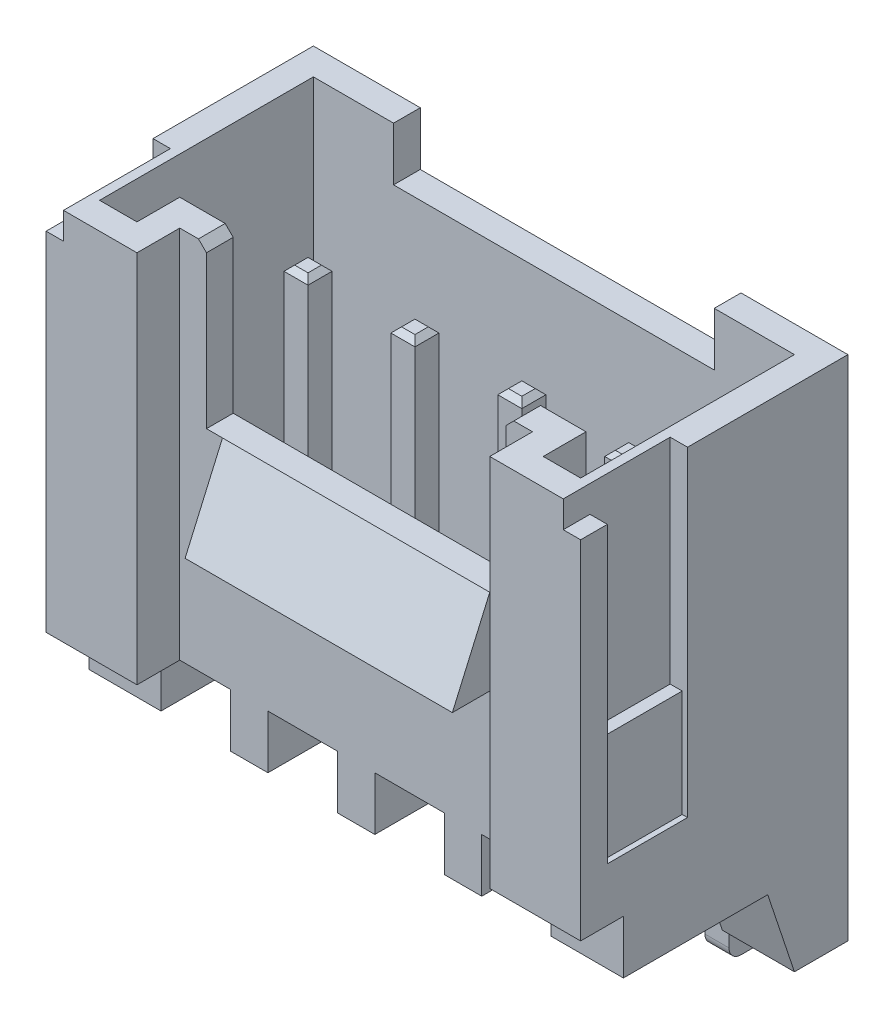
ISO-10303-21;
HEADER;
FILE_DESCRIPTION(('STEP AP214'),'2;1');
FILE_NAME('part.step','',(''),(''),'','','');
FILE_SCHEMA(('AUTOMOTIVE_DESIGN { 1 0 10303 214 1 1 1 1 }'));
ENDSEC;
DATA;
#1=APPLICATION_CONTEXT('core data for automotive mechanical design processes');
#2=APPLICATION_PROTOCOL_DEFINITION('international standard','automotive_design',2000,#1);
#3=PRODUCT_CONTEXT('',#1,'mechanical');
#4=PRODUCT('Part','Part','',(#3));
#5=PRODUCT_RELATED_PRODUCT_CATEGORY('part','',(#4));
#6=PRODUCT_DEFINITION_FORMATION('','',#4);
#7=PRODUCT_DEFINITION_CONTEXT('part definition',#1,'design');
#8=PRODUCT_DEFINITION('design','',#6,#7);
#9=PRODUCT_DEFINITION_SHAPE('','',#8);
#10=(LENGTH_UNIT() NAMED_UNIT(*) SI_UNIT(.MILLI.,.METRE.));
#11=(NAMED_UNIT(*) PLANE_ANGLE_UNIT() SI_UNIT($,.RADIAN.));
#12=(NAMED_UNIT(*) SI_UNIT($,.STERADIAN.) SOLID_ANGLE_UNIT());
#13=UNCERTAINTY_MEASURE_WITH_UNIT(LENGTH_MEASURE(1.E-05),#10,'distance_accuracy_value','');
#14=(GEOMETRIC_REPRESENTATION_CONTEXT(3) GLOBAL_UNCERTAINTY_ASSIGNED_CONTEXT((#13)) GLOBAL_UNIT_ASSIGNED_CONTEXT((#10,
#11,#12)) REPRESENTATION_CONTEXT('',''));
#15=CARTESIAN_POINT('',(0.,0.,0.));
#16=DIRECTION('',(0.,0.,1.));
#17=DIRECTION('',(1.,0.,0.));
#18=AXIS2_PLACEMENT_3D('',#15,#16,#17);
#19=CARTESIAN_POINT('',(-3.225,-0.872862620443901,-5.));
#20=DIRECTION('',(0.,0.,1.));
#21=DIRECTION('',(1.,0.,0.));
#22=AXIS2_PLACEMENT_3D('',#19,#20,#21);
#23=PLANE('',#22);
#24=DIRECTION('',(0.,1.,0.));
#25=VECTOR('',#24,1.);
#26=CARTESIAN_POINT('',(-2.775,-0.872862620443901,-5.));
#27=LINE('',#26,#25);
#28=CARTESIAN_POINT('',(-2.775,-0.872862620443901,-5.));
#29=VERTEX_POINT('',#28);
#30=CARTESIAN_POINT('',(-2.775,-2.5,-5.));
#31=VERTEX_POINT('',#30);
#32=EDGE_CURVE('E164',#29,#31,#27,.F.);
#33=ORIENTED_EDGE('',*,*,#32,.T.);
#34=DIRECTION('',(1.,0.,0.));
#35=VECTOR('',#34,1.);
#36=CARTESIAN_POINT('',(-3.225,-2.5,-5.));
#37=LINE('',#36,#35);
#38=CARTESIAN_POINT('',(-3.225,-2.5,-5.));
#39=VERTEX_POINT('',#38);
#40=EDGE_CURVE('E146',#39,#31,#37,.T.);
#41=ORIENTED_EDGE('',*,*,#40,.F.);
#42=DIRECTION('',(0.,1.,0.));
#43=VECTOR('',#42,1.);
#44=CARTESIAN_POINT('',(-3.225,-0.872862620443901,-5.));
#45=LINE('',#44,#43);
#46=CARTESIAN_POINT('',(-3.225,-0.872862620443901,-5.));
#47=VERTEX_POINT('',#46);
#48=EDGE_CURVE('E152',#47,#39,#45,.F.);
#49=ORIENTED_EDGE('',*,*,#48,.F.);
#50=DIRECTION('',(1.,0.,0.));
#51=VECTOR('',#50,1.);
#52=CARTESIAN_POINT('',(-3.225,-0.872862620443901,-5.));
#53=LINE('',#52,#51);
#54=EDGE_CURVE('E228',#47,#29,#53,.T.);
#55=ORIENTED_EDGE('',*,*,#54,.T.);
#56=EDGE_LOOP('',(#33,#41,#49,#55));
#57=FACE_BOUND('',#56,.T.);
#58=ADVANCED_FACE('F45',(#57),#23,.F.);
#59=CARTESIAN_POINT('',(-3.225,-2.5,-4.55));
#60=DIRECTION('',(0.,-1.,0.));
#61=DIRECTION('',(0.,0.,-1.));
#62=AXIS2_PLACEMENT_3D('',#59,#60,#61);
#63=PLANE('',#62);
#64=DIRECTION('',(0.,0.,-1.));
#65=VECTOR('',#64,1.);
#66=CARTESIAN_POINT('',(-2.775,-2.5,-4.55));
#67=LINE('',#66,#65);
#68=CARTESIAN_POINT('',(-2.775,-2.5,-4.775));
#69=VERTEX_POINT('',#68);
#70=EDGE_CURVE('E206',#69,#31,#67,.T.);
#71=ORIENTED_EDGE('',*,*,#70,.F.);
#72=DIRECTION('',(1.,0.,0.));
#73=VECTOR('',#72,1.);
#74=CARTESIAN_POINT('',(-3.225,-2.5,-4.775));
#75=LINE('',#74,#73);
#76=CARTESIAN_POINT('',(-3.225,-2.5,-4.775));
#77=VERTEX_POINT('',#76);
#78=EDGE_CURVE('E149',#69,#77,#75,.F.);
#79=ORIENTED_EDGE('',*,*,#78,.T.);
#80=DIRECTION('',(0.,0.,-1.));
#81=VECTOR('',#80,1.);
#82=CARTESIAN_POINT('',(-3.225,-2.5,-4.55));
#83=LINE('',#82,#81);
#84=EDGE_CURVE('E141',#77,#39,#83,.T.);
#85=ORIENTED_EDGE('',*,*,#84,.T.);
#86=ORIENTED_EDGE('',*,*,#40,.T.);
#87=EDGE_LOOP('',(#71,#79,#85,#86));
#88=FACE_BOUND('',#87,.T.);
#89=ADVANCED_FACE('F144',(#88),#63,.T.);
#90=CARTESIAN_POINT('',(-3.225,-0.872862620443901,-4.55));
#91=DIRECTION('',(0.,0.,1.));
#92=DIRECTION('',(1.,0.,0.));
#93=AXIS2_PLACEMENT_3D('',#90,#91,#92);
#94=PLANE('',#93);
#95=DIRECTION('',(0.,1.,0.));
#96=VECTOR('',#95,1.);
#97=CARTESIAN_POINT('',(-3.225,-0.872862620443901,-4.55));
#98=LINE('',#97,#96);
#99=CARTESIAN_POINT('',(-3.225,-0.8728626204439,-4.55));
#100=VERTEX_POINT('',#99);
#101=CARTESIAN_POINT('',(-3.225,-2.275,-4.55));
#102=VERTEX_POINT('',#101);
#103=EDGE_CURVE('E151',#100,#102,#98,.F.);
#104=ORIENTED_EDGE('',*,*,#103,.T.);
#105=DIRECTION('',(1.,0.,0.));
#106=VECTOR('',#105,1.);
#107=CARTESIAN_POINT('',(-3.225,-2.275,-4.55));
#108=LINE('',#107,#106);
#109=CARTESIAN_POINT('',(-2.775,-2.275,-4.55));
#110=VERTEX_POINT('',#109);
#111=EDGE_CURVE('E165',#102,#110,#108,.T.);
#112=ORIENTED_EDGE('',*,*,#111,.T.);
#113=DIRECTION('',(0.,1.,0.));
#114=VECTOR('',#113,1.);
#115=CARTESIAN_POINT('',(-2.775,-0.872862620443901,-4.55));
#116=LINE('',#115,#114);
#117=CARTESIAN_POINT('',(-2.775,-0.8728626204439,-4.55));
#118=VERTEX_POINT('',#117);
#119=EDGE_CURVE('E208',#118,#110,#116,.F.);
#120=ORIENTED_EDGE('',*,*,#119,.F.);
#121=DIRECTION('',(1.,0.,0.));
#122=VECTOR('',#121,1.);
#123=CARTESIAN_POINT('',(-3.225,-0.8728626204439,-4.55));
#124=LINE('',#123,#122);
#125=EDGE_CURVE('E166',#100,#118,#124,.T.);
#126=ORIENTED_EDGE('',*,*,#125,.F.);
#127=EDGE_LOOP('',(#104,#112,#120,#126));
#128=FACE_BOUND('',#127,.T.);
#129=ADVANCED_FACE('F281',(#128),#94,.T.);
#130=CARTESIAN_POINT('',(-3.225,-0.461943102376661,-3.00905180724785));
#131=DIRECTION('',(0.,-0.966234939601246,0.257662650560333));
#132=DIRECTION('',(0.,-0.257662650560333,-0.966234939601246));
#133=AXIS2_PLACEMENT_3D('',#130,#131,#132);
#134=PLANE('',#133);
#135=DIRECTION('',(0.,-0.257662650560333,-0.966234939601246));
#136=VECTOR('',#135,1.);
#137=CARTESIAN_POINT('',(-2.775,-0.461943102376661,-3.00905180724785));
#138=LINE('',#137,#136);
#139=CARTESIAN_POINT('',(-2.775,-0.461943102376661,-3.00905180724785));
#140=VERTEX_POINT('',#139);
#141=EDGE_CURVE('E215',#140,#118,#138,.T.);
#142=ORIENTED_EDGE('',*,*,#141,.F.);
#143=DIRECTION('',(1.,0.,0.));
#144=VECTOR('',#143,1.);
#145=CARTESIAN_POINT('',(-3.225,-0.461943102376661,-3.00905180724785));
#146=LINE('',#145,#144);
#147=CARTESIAN_POINT('',(-3.225,-0.461943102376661,-3.00905180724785));
#148=VERTEX_POINT('',#147);
#149=EDGE_CURVE('E171',#148,#140,#146,.T.);
#150=ORIENTED_EDGE('',*,*,#149,.F.);
#151=DIRECTION('',(0.,-0.257662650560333,-0.966234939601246));
#152=VECTOR('',#151,1.);
#153=CARTESIAN_POINT('',(-3.225,-0.461943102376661,-3.00905180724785));
#154=LINE('',#153,#152);
#155=EDGE_CURVE('E259',#148,#100,#154,.T.);
#156=ORIENTED_EDGE('',*,*,#155,.T.);
#157=ORIENTED_EDGE('',*,*,#125,.T.);
#158=EDGE_LOOP('',(#142,#150,#156,#157));
#159=FACE_BOUND('',#158,.T.);
#160=ADVANCED_FACE('F249',(#159),#134,.T.);
#161=CARTESIAN_POINT('',(-3.225,-0.0271373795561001,-3.125));
#162=DIRECTION('',(1.,0.,0.));
#163=DIRECTION('',(0.,0.,-1.));
#164=AXIS2_PLACEMENT_3D('',#161,#162,#163);
#165=CYLINDRICAL_SURFACE('',#164,0.45);
#166=CARTESIAN_POINT('',(-2.775,-0.0271373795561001,-3.125));
#167=DIRECTION('',(-1.,0.,0.));
#168=DIRECTION('',(0.,0.,1.));
#169=AXIS2_PLACEMENT_3D('',#166,#167,#168);
#170=CIRCLE('',#169,0.45);
#171=CARTESIAN_POINT('',(-2.775,-0.0271373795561,-2.675));
#172=VERTEX_POINT('',#171);
#173=EDGE_CURVE('E218',#172,#140,#170,.F.);
#174=ORIENTED_EDGE('',*,*,#173,.F.);
#175=DIRECTION('',(1.,0.,0.));
#176=VECTOR('',#175,1.);
#177=CARTESIAN_POINT('',(-3.225,-0.0271373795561,-2.675));
#178=LINE('',#177,#176);
#179=CARTESIAN_POINT('',(-3.225,-0.0271373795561,-2.675));
#180=VERTEX_POINT('',#179);
#181=EDGE_CURVE('E236',#180,#172,#178,.T.);
#182=ORIENTED_EDGE('',*,*,#181,.F.);
#183=CARTESIAN_POINT('',(-3.225,-0.0271373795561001,-3.125));
#184=DIRECTION('',(-1.,0.,0.));
#185=DIRECTION('',(0.,0.,1.));
#186=AXIS2_PLACEMENT_3D('',#183,#184,#185);
#187=CIRCLE('',#186,0.45);
#188=EDGE_CURVE('E245',#180,#148,#187,.F.);
#189=ORIENTED_EDGE('',*,*,#188,.T.);
#190=ORIENTED_EDGE('',*,*,#149,.T.);
#191=EDGE_LOOP('',(#174,#182,#189,#190));
#192=FACE_BOUND('',#191,.T.);
#193=ADVANCED_FACE('F242',(#192),#165,.T.);
#194=CARTESIAN_POINT('',(-3.225,6.5,-2.675));
#195=DIRECTION('',(0.,0.,1.));
#196=DIRECTION('',(0.,-1.,0.));
#197=AXIS2_PLACEMENT_3D('',#194,#195,#196);
#198=PLANE('',#197);
#199=DIRECTION('',(0.,-1.,0.));
#200=VECTOR('',#199,1.);
#201=CARTESIAN_POINT('',(-2.775,6.5,-2.675));
#202=LINE('',#201,#200);
#203=CARTESIAN_POINT('',(-2.775,6.4,-2.675));
#204=VERTEX_POINT('',#203);
#205=EDGE_CURVE('E221',#204,#172,#202,.T.);
#206=ORIENTED_EDGE('',*,*,#205,.F.);
#207=DIRECTION('',(-1.,0.,0.));
#208=VECTOR('',#207,1.);
#209=CARTESIAN_POINT('',(-3.225,6.4,-2.675));
#210=LINE('',#209,#208);
#211=CARTESIAN_POINT('',(-3.225,6.4,-2.675));
#212=VERTEX_POINT('',#211);
#213=EDGE_CURVE('E188',#204,#212,#210,.T.);
#214=ORIENTED_EDGE('',*,*,#213,.T.);
#215=DIRECTION('',(0.,-1.,0.));
#216=VECTOR('',#215,1.);
#217=CARTESIAN_POINT('',(-3.225,6.5,-2.675));
#218=LINE('',#217,#216);
#219=EDGE_CURVE('E257',#212,#180,#218,.T.);
#220=ORIENTED_EDGE('',*,*,#219,.T.);
#221=ORIENTED_EDGE('',*,*,#181,.T.);
#222=EDGE_LOOP('',(#206,#214,#220,#221));
#223=FACE_BOUND('',#222,.T.);
#224=ADVANCED_FACE('F256',(#223),#198,.T.);
#225=CARTESIAN_POINT('',(-3.225,6.5,-3.125));
#226=DIRECTION('',(0.,1.,0.));
#227=DIRECTION('',(0.,0.,1.));
#228=AXIS2_PLACEMENT_3D('',#225,#226,#227);
#229=PLANE('',#228);
#230=DIRECTION('',(0.,0.,1.));
#231=VECTOR('',#230,1.);
#232=CARTESIAN_POINT('',(-3.125,6.5,-3.125));
#233=LINE('',#232,#231);
#234=CARTESIAN_POINT('',(-3.125,6.5,-3.025));
#235=VERTEX_POINT('',#234);
#236=CARTESIAN_POINT('',(-3.125,6.5,-2.775));
#237=VERTEX_POINT('',#236);
#238=EDGE_CURVE('E183',#235,#237,#233,.T.);
#239=ORIENTED_EDGE('',*,*,#238,.T.);
#240=DIRECTION('',(1.,0.,0.));
#241=VECTOR('',#240,1.);
#242=CARTESIAN_POINT('',(-3.225,6.5,-2.775));
#243=LINE('',#242,#241);
#244=CARTESIAN_POINT('',(-2.875,6.5,-2.775));
#245=VERTEX_POINT('',#244);
#246=EDGE_CURVE('E185',#237,#245,#243,.T.);
#247=ORIENTED_EDGE('',*,*,#246,.T.);
#248=DIRECTION('',(0.,0.,-1.));
#249=VECTOR('',#248,1.);
#250=CARTESIAN_POINT('',(-2.875,6.5,-3.125));
#251=LINE('',#250,#249);
#252=CARTESIAN_POINT('',(-2.875,6.5,-3.025));
#253=VERTEX_POINT('',#252);
#254=EDGE_CURVE('E179',#245,#253,#251,.T.);
#255=ORIENTED_EDGE('',*,*,#254,.T.);
#256=DIRECTION('',(-1.,0.,0.));
#257=VECTOR('',#256,1.);
#258=CARTESIAN_POINT('',(-3.225,6.5,-3.025));
#259=LINE('',#258,#257);
#260=EDGE_CURVE('E181',#253,#235,#259,.T.);
#261=ORIENTED_EDGE('',*,*,#260,.T.);
#262=EDGE_LOOP('',(#239,#247,#255,#261));
#263=FACE_BOUND('',#262,.T.);
#264=ADVANCED_FACE('F316',(#263),#229,.T.);
#265=CARTESIAN_POINT('',(-3.225,6.5,-3.125));
#266=DIRECTION('',(0.,0.,1.));
#267=DIRECTION('',(0.,-1.,0.));
#268=AXIS2_PLACEMENT_3D('',#265,#266,#267);
#269=PLANE('',#268);
#270=DIRECTION('',(0.,-1.,0.));
#271=VECTOR('',#270,1.);
#272=CARTESIAN_POINT('',(-3.225,6.5,-3.125));
#273=LINE('',#272,#271);
#274=CARTESIAN_POINT('',(-3.225,6.4,-3.125));
#275=VERTEX_POINT('',#274);
#276=CARTESIAN_POINT('',(-3.225,-0.0271373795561,-3.125));
#277=VERTEX_POINT('',#276);
#278=EDGE_CURVE('E261',#275,#277,#273,.T.);
#279=ORIENTED_EDGE('',*,*,#278,.F.);
#280=DIRECTION('',(1.,0.,0.));
#281=VECTOR('',#280,1.);
#282=CARTESIAN_POINT('',(-2.775,6.4,-3.125));
#283=LINE('',#282,#281);
#284=CARTESIAN_POINT('',(-2.775,6.4,-3.125));
#285=VERTEX_POINT('',#284);
#286=EDGE_CURVE('E54',#275,#285,#283,.T.);
#287=ORIENTED_EDGE('',*,*,#286,.T.);
#288=DIRECTION('',(0.,-1.,0.));
#289=VECTOR('',#288,1.);
#290=CARTESIAN_POINT('',(-2.775,6.5,-3.125));
#291=LINE('',#290,#289);
#292=CARTESIAN_POINT('',(-2.775,-0.0271373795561,-3.125));
#293=VERTEX_POINT('',#292);
#294=EDGE_CURVE('E223',#285,#293,#291,.T.);
#295=ORIENTED_EDGE('',*,*,#294,.T.);
#296=DIRECTION('',(1.,0.,0.));
#297=VECTOR('',#296,1.);
#298=CARTESIAN_POINT('',(-3.225,-0.0271373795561,-3.125));
#299=LINE('',#298,#297);
#300=EDGE_CURVE('E233',#277,#293,#299,.T.);
#301=ORIENTED_EDGE('',*,*,#300,.F.);
#302=EDGE_LOOP('',(#279,#287,#295,#301));
#303=FACE_BOUND('',#302,.T.);
#304=ADVANCED_FACE('F318',(#303),#269,.F.);
#305=CARTESIAN_POINT('',(-3.225,-0.0271373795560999,-3.125));
#306=DIRECTION('',(0.,-0.966234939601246,0.257662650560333));
#307=DIRECTION('',(0.,-0.257662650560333,-0.966234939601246));
#308=AXIS2_PLACEMENT_3D('',#305,#306,#307);
#309=PLANE('',#308);
#310=DIRECTION('',(0.,-0.257662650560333,-0.966234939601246));
#311=VECTOR('',#310,1.);
#312=CARTESIAN_POINT('',(-2.775,-0.0271373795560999,-3.125));
#313=LINE('',#312,#311);
#314=CARTESIAN_POINT('',(-2.775,-0.43805689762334,-4.66594819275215));
#315=VERTEX_POINT('',#314);
#316=EDGE_CURVE('E225',#293,#315,#313,.T.);
#317=ORIENTED_EDGE('',*,*,#316,.T.);
#318=DIRECTION('',(1.,0.,0.));
#319=VECTOR('',#318,1.);
#320=CARTESIAN_POINT('',(-3.225,-0.43805689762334,-4.66594819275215));
#321=LINE('',#320,#319);
#322=CARTESIAN_POINT('',(-3.225,-0.43805689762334,-4.66594819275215));
#323=VERTEX_POINT('',#322);
#324=EDGE_CURVE('E230',#323,#315,#321,.T.);
#325=ORIENTED_EDGE('',*,*,#324,.F.);
#326=DIRECTION('',(0.,-0.257662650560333,-0.966234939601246));
#327=VECTOR('',#326,1.);
#328=CARTESIAN_POINT('',(-3.225,-0.0271373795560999,-3.125));
#329=LINE('',#328,#327);
#330=EDGE_CURVE('E266',#277,#323,#329,.T.);
#331=ORIENTED_EDGE('',*,*,#330,.F.);
#332=ORIENTED_EDGE('',*,*,#300,.T.);
#333=EDGE_LOOP('',(#317,#325,#331,#332));
#334=FACE_BOUND('',#333,.T.);
#335=ADVANCED_FACE('F271',(#334),#309,.F.);
#336=CARTESIAN_POINT('',(-3.225,-0.872862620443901,-4.55));
#337=DIRECTION('',(1.,0.,0.));
#338=DIRECTION('',(0.,0.,-1.));
#339=AXIS2_PLACEMENT_3D('',#336,#337,#338);
#340=CYLINDRICAL_SURFACE('',#339,0.45);
#341=CARTESIAN_POINT('',(-2.775,-0.872862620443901,-4.55));
#342=DIRECTION('',(-1.,0.,0.));
#343=DIRECTION('',(0.,0.,1.));
#344=AXIS2_PLACEMENT_3D('',#341,#342,#343);
#345=CIRCLE('',#344,0.45);
#346=EDGE_CURVE('E161',#315,#29,#345,.T.);
#347=ORIENTED_EDGE('',*,*,#346,.T.);
#348=ORIENTED_EDGE('',*,*,#54,.F.);
#349=CARTESIAN_POINT('',(-3.225,-0.872862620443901,-4.55));
#350=DIRECTION('',(-1.,0.,0.));
#351=DIRECTION('',(0.,0.,1.));
#352=AXIS2_PLACEMENT_3D('',#349,#350,#351);
#353=CIRCLE('',#352,0.45);
#354=EDGE_CURVE('E157',#323,#47,#353,.T.);
#355=ORIENTED_EDGE('',*,*,#354,.F.);
#356=ORIENTED_EDGE('',*,*,#324,.T.);
#357=EDGE_LOOP('',(#347,#348,#355,#356));
#358=FACE_BOUND('',#357,.T.);
#359=ADVANCED_FACE('F275',(#358),#340,.T.);
#360=CARTESIAN_POINT('',(-3.225,-0.0271373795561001,-3.125));
#361=DIRECTION('',(-1.,0.,0.));
#362=DIRECTION('',(0.,0.,1.));
#363=AXIS2_PLACEMENT_3D('',#360,#361,#362);
#364=PLANE('',#363);
#365=ORIENTED_EDGE('',*,*,#219,.F.);
#366=DIRECTION('',(0.,0.,-1.));
#367=VECTOR('',#366,1.);
#368=CARTESIAN_POINT('',(-3.225,6.4,-3.125));
#369=LINE('',#368,#367);
#370=EDGE_CURVE('E69',#212,#275,#369,.T.);
#371=ORIENTED_EDGE('',*,*,#370,.T.);
#372=ORIENTED_EDGE('',*,*,#278,.T.);
#373=ORIENTED_EDGE('',*,*,#330,.T.);
#374=ORIENTED_EDGE('',*,*,#354,.T.);
#375=ORIENTED_EDGE('',*,*,#48,.T.);
#376=ORIENTED_EDGE('',*,*,#84,.F.);
#377=CARTESIAN_POINT('',(-3.225,-2.275,-4.775));
#378=DIRECTION('',(-1.,0.,0.));
#379=DIRECTION('',(0.,0.,1.));
#380=AXIS2_PLACEMENT_3D('',#377,#378,#379);
#381=CIRCLE('',#380,0.225);
#382=EDGE_CURVE('E177',#77,#102,#381,.T.);
#383=ORIENTED_EDGE('',*,*,#382,.T.);
#384=ORIENTED_EDGE('',*,*,#103,.F.);
#385=ORIENTED_EDGE('',*,*,#155,.F.);
#386=ORIENTED_EDGE('',*,*,#188,.F.);
#387=EDGE_LOOP('',(#365,#371,#372,#373,#374,#375,#376,#383,#384,#385,#386));
#388=FACE_BOUND('',#387,.T.);
#389=ADVANCED_FACE('F155',(#388),#364,.T.);
#390=CARTESIAN_POINT('',(-2.775,-0.0271373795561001,-3.125));
#391=DIRECTION('',(-1.,0.,0.));
#392=DIRECTION('',(0.,0.,1.));
#393=AXIS2_PLACEMENT_3D('',#390,#391,#392);
#394=PLANE('',#393);
#395=ORIENTED_EDGE('',*,*,#294,.F.);
#396=DIRECTION('',(0.,0.,1.));
#397=VECTOR('',#396,1.);
#398=CARTESIAN_POINT('',(-2.775,6.4,-2.675));
#399=LINE('',#398,#397);
#400=EDGE_CURVE('E12',#285,#204,#399,.T.);
#401=ORIENTED_EDGE('',*,*,#400,.T.);
#402=ORIENTED_EDGE('',*,*,#205,.T.);
#403=ORIENTED_EDGE('',*,*,#173,.T.);
#404=ORIENTED_EDGE('',*,*,#141,.T.);
#405=ORIENTED_EDGE('',*,*,#119,.T.);
#406=CARTESIAN_POINT('',(-2.775,-2.275,-4.775));
#407=DIRECTION('',(-1.,0.,0.));
#408=DIRECTION('',(0.,0.,1.));
#409=AXIS2_PLACEMENT_3D('',#406,#407,#408);
#410=CIRCLE('',#409,0.225);
#411=EDGE_CURVE('E169',#110,#69,#410,.F.);
#412=ORIENTED_EDGE('',*,*,#411,.T.);
#413=ORIENTED_EDGE('',*,*,#70,.T.);
#414=ORIENTED_EDGE('',*,*,#32,.F.);
#415=ORIENTED_EDGE('',*,*,#346,.F.);
#416=ORIENTED_EDGE('',*,*,#316,.F.);
#417=EDGE_LOOP('',(#395,#401,#402,#403,#404,#405,#412,#413,#414,#415,#416));
#418=FACE_BOUND('',#417,.T.);
#419=ADVANCED_FACE('F252',(#418),#394,.F.);
#420=CARTESIAN_POINT('',(-3.225,-2.275,-4.775));
#421=DIRECTION('',(1.,0.,0.));
#422=DIRECTION('',(0.,0.,-1.));
#423=AXIS2_PLACEMENT_3D('',#420,#421,#422);
#424=CYLINDRICAL_SURFACE('',#423,0.225);
#425=ORIENTED_EDGE('',*,*,#382,.F.);
#426=ORIENTED_EDGE('',*,*,#78,.F.);
#427=ORIENTED_EDGE('',*,*,#411,.F.);
#428=ORIENTED_EDGE('',*,*,#111,.F.);
#429=EDGE_LOOP('',(#425,#426,#427,#428));
#430=FACE_BOUND('',#429,.T.);
#431=ADVANCED_FACE('F277',(#430),#424,.T.);
#432=CARTESIAN_POINT('',(-3.225,6.4,-3.125));
#433=DIRECTION('',(0.,0.707106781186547,-0.707106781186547));
#434=DIRECTION('',(-1.,0.,0.));
#435=AXIS2_PLACEMENT_3D('',#432,#433,#434);
#436=PLANE('',#435);
#437=DIRECTION('',(-0.577350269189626,0.577350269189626,0.577350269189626));
#438=VECTOR('',#437,1.);
#439=CARTESIAN_POINT('',(-2.775,6.4,-3.125));
#440=LINE('',#439,#438);
#441=EDGE_CURVE('E196',#285,#253,#440,.T.);
#442=ORIENTED_EDGE('',*,*,#441,.F.);
#443=ORIENTED_EDGE('',*,*,#286,.F.);
#444=DIRECTION('',(-0.577350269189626,-0.577350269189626,-0.577350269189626));
#445=VECTOR('',#444,1.);
#446=CARTESIAN_POINT('',(-3.225,6.4,-3.125));
#447=LINE('',#446,#445);
#448=EDGE_CURVE('E49',#235,#275,#447,.T.);
#449=ORIENTED_EDGE('',*,*,#448,.F.);
#450=ORIENTED_EDGE('',*,*,#260,.F.);
#451=EDGE_LOOP('',(#442,#443,#449,#450));
#452=FACE_BOUND('',#451,.T.);
#453=ADVANCED_FACE('F47',(#452),#436,.T.);
#454=CARTESIAN_POINT('',(-3.125,6.5,-3.125));
#455=DIRECTION('',(0.707106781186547,-0.707106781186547,0.));
#456=DIRECTION('',(0.,0.,1.));
#457=AXIS2_PLACEMENT_3D('',#454,#455,#456);
#458=PLANE('',#457);
#459=ORIENTED_EDGE('',*,*,#448,.T.);
#460=ORIENTED_EDGE('',*,*,#370,.F.);
#461=DIRECTION('',(0.577350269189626,0.577350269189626,-0.577350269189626));
#462=VECTOR('',#461,1.);
#463=CARTESIAN_POINT('',(-3.00833333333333,6.61666666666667,-2.89166666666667));
#464=LINE('',#463,#462);
#465=EDGE_CURVE('E195',#237,#212,#464,.F.);
#466=ORIENTED_EDGE('',*,*,#465,.F.);
#467=ORIENTED_EDGE('',*,*,#238,.F.);
#468=EDGE_LOOP('',(#459,#460,#466,#467));
#469=FACE_BOUND('',#468,.T.);
#470=ADVANCED_FACE('F303',(#469),#458,.F.);
#471=CARTESIAN_POINT('',(-2.775,6.4,-3.125));
#472=DIRECTION('',(0.707106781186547,0.707106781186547,0.));
#473=DIRECTION('',(0.,0.,-1.));
#474=AXIS2_PLACEMENT_3D('',#471,#472,#473);
#475=PLANE('',#474);
#476=ORIENTED_EDGE('',*,*,#441,.T.);
#477=ORIENTED_EDGE('',*,*,#254,.F.);
#478=DIRECTION('',(-0.577350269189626,0.577350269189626,-0.577350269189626));
#479=VECTOR('',#478,1.);
#480=CARTESIAN_POINT('',(-2.925,6.55,-2.825));
#481=LINE('',#480,#479);
#482=EDGE_CURVE('E193',#204,#245,#481,.T.);
#483=ORIENTED_EDGE('',*,*,#482,.F.);
#484=ORIENTED_EDGE('',*,*,#400,.F.);
#485=EDGE_LOOP('',(#476,#477,#483,#484));
#486=FACE_BOUND('',#485,.T.);
#487=ADVANCED_FACE('F300',(#486),#475,.T.);
#488=CARTESIAN_POINT('',(-3.225,6.5,-2.775));
#489=DIRECTION('',(0.,-0.707106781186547,-0.707106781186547));
#490=DIRECTION('',(1.,0.,0.));
#491=AXIS2_PLACEMENT_3D('',#488,#489,#490);
#492=PLANE('',#491);
#493=ORIENTED_EDGE('',*,*,#465,.T.);
#494=ORIENTED_EDGE('',*,*,#213,.F.);
#495=ORIENTED_EDGE('',*,*,#482,.T.);
#496=ORIENTED_EDGE('',*,*,#246,.F.);
#497=EDGE_LOOP('',(#493,#494,#495,#496));
#498=FACE_BOUND('',#497,.T.);
#499=ADVANCED_FACE('F297',(#498),#492,.F.);
#500=CLOSED_SHELL('',(#58,#89,#129,#160,#193,#224,#264,#304,#335,#359,#389,#419,#431,#453,#470,
#487,#499));
#501=MANIFOLD_SOLID_BREP('B2',#500);
#502=CARTESIAN_POINT('',(-1.225,-0.872862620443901,-5.));
#503=DIRECTION('',(0.,0.,1.));
#504=DIRECTION('',(1.,0.,0.));
#505=AXIS2_PLACEMENT_3D('',#502,#503,#504);
#506=PLANE('',#505);
#507=DIRECTION('',(0.,1.,0.));
#508=VECTOR('',#507,1.);
#509=CARTESIAN_POINT('',(-0.775,-0.872862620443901,-5.));
#510=LINE('',#509,#508);
#511=CARTESIAN_POINT('',(-0.775,-0.872862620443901,-5.));
#512=VERTEX_POINT('',#511);
#513=CARTESIAN_POINT('',(-0.775,-2.5,-5.));
#514=VERTEX_POINT('',#513);
#515=EDGE_CURVE('E585',#512,#514,#510,.F.);
#516=ORIENTED_EDGE('',*,*,#515,.T.);
#517=DIRECTION('',(1.,0.,0.));
#518=VECTOR('',#517,1.);
#519=CARTESIAN_POINT('',(-1.225,-2.5,-5.));
#520=LINE('',#519,#518);
#521=CARTESIAN_POINT('',(-1.225,-2.5,-5.));
#522=VERTEX_POINT('',#521);
#523=EDGE_CURVE('E567',#522,#514,#520,.T.);
#524=ORIENTED_EDGE('',*,*,#523,.F.);
#525=DIRECTION('',(0.,1.,0.));
#526=VECTOR('',#525,1.);
#527=CARTESIAN_POINT('',(-1.225,-0.872862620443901,-5.));
#528=LINE('',#527,#526);
#529=CARTESIAN_POINT('',(-1.225,-0.872862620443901,-5.));
#530=VERTEX_POINT('',#529);
#531=EDGE_CURVE('E573',#530,#522,#528,.F.);
#532=ORIENTED_EDGE('',*,*,#531,.F.);
#533=DIRECTION('',(1.,0.,0.));
#534=VECTOR('',#533,1.);
#535=CARTESIAN_POINT('',(-1.225,-0.872862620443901,-5.));
#536=LINE('',#535,#534);
#537=EDGE_CURVE('E649',#530,#512,#536,.T.);
#538=ORIENTED_EDGE('',*,*,#537,.T.);
#539=EDGE_LOOP('',(#516,#524,#532,#538));
#540=FACE_BOUND('',#539,.T.);
#541=ADVANCED_FACE('F466',(#540),#506,.F.);
#542=CARTESIAN_POINT('',(-1.225,-2.5,-4.55));
#543=DIRECTION('',(0.,-1.,0.));
#544=DIRECTION('',(0.,0.,-1.));
#545=AXIS2_PLACEMENT_3D('',#542,#543,#544);
#546=PLANE('',#545);
#547=DIRECTION('',(0.,0.,-1.));
#548=VECTOR('',#547,1.);
#549=CARTESIAN_POINT('',(-0.775,-2.5,-4.55));
#550=LINE('',#549,#548);
#551=CARTESIAN_POINT('',(-0.775,-2.5,-4.775));
#552=VERTEX_POINT('',#551);
#553=EDGE_CURVE('E627',#552,#514,#550,.T.);
#554=ORIENTED_EDGE('',*,*,#553,.F.);
#555=DIRECTION('',(1.,0.,0.));
#556=VECTOR('',#555,1.);
#557=CARTESIAN_POINT('',(-1.225,-2.5,-4.775));
#558=LINE('',#557,#556);
#559=CARTESIAN_POINT('',(-1.225,-2.5,-4.775));
#560=VERTEX_POINT('',#559);
#561=EDGE_CURVE('E570',#552,#560,#558,.F.);
#562=ORIENTED_EDGE('',*,*,#561,.T.);
#563=DIRECTION('',(0.,0.,-1.));
#564=VECTOR('',#563,1.);
#565=CARTESIAN_POINT('',(-1.225,-2.5,-4.55));
#566=LINE('',#565,#564);
#567=EDGE_CURVE('E562',#560,#522,#566,.T.);
#568=ORIENTED_EDGE('',*,*,#567,.T.);
#569=ORIENTED_EDGE('',*,*,#523,.T.);
#570=EDGE_LOOP('',(#554,#562,#568,#569));
#571=FACE_BOUND('',#570,.T.);
#572=ADVANCED_FACE('F565',(#571),#546,.T.);
#573=CARTESIAN_POINT('',(-1.225,-0.872862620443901,-4.55));
#574=DIRECTION('',(0.,0.,1.));
#575=DIRECTION('',(1.,0.,0.));
#576=AXIS2_PLACEMENT_3D('',#573,#574,#575);
#577=PLANE('',#576);
#578=DIRECTION('',(0.,1.,0.));
#579=VECTOR('',#578,1.);
#580=CARTESIAN_POINT('',(-1.225,-0.872862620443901,-4.55));
#581=LINE('',#580,#579);
#582=CARTESIAN_POINT('',(-1.225,-0.8728626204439,-4.55));
#583=VERTEX_POINT('',#582);
#584=CARTESIAN_POINT('',(-1.225,-2.275,-4.55));
#585=VERTEX_POINT('',#584);
#586=EDGE_CURVE('E572',#583,#585,#581,.F.);
#587=ORIENTED_EDGE('',*,*,#586,.T.);
#588=DIRECTION('',(1.,0.,0.));
#589=VECTOR('',#588,1.);
#590=CARTESIAN_POINT('',(-1.225,-2.275,-4.55));
#591=LINE('',#590,#589);
#592=CARTESIAN_POINT('',(-0.775,-2.275,-4.55));
#593=VERTEX_POINT('',#592);
#594=EDGE_CURVE('E586',#585,#593,#591,.T.);
#595=ORIENTED_EDGE('',*,*,#594,.T.);
#596=DIRECTION('',(0.,1.,0.));
#597=VECTOR('',#596,1.);
#598=CARTESIAN_POINT('',(-0.775,-0.872862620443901,-4.55));
#599=LINE('',#598,#597);
#600=CARTESIAN_POINT('',(-0.775,-0.8728626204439,-4.55));
#601=VERTEX_POINT('',#600);
#602=EDGE_CURVE('E629',#601,#593,#599,.F.);
#603=ORIENTED_EDGE('',*,*,#602,.F.);
#604=DIRECTION('',(1.,0.,0.));
#605=VECTOR('',#604,1.);
#606=CARTESIAN_POINT('',(-1.225,-0.8728626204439,-4.55));
#607=LINE('',#606,#605);
#608=EDGE_CURVE('E587',#583,#601,#607,.T.);
#609=ORIENTED_EDGE('',*,*,#608,.F.);
#610=EDGE_LOOP('',(#587,#595,#603,#609));
#611=FACE_BOUND('',#610,.T.);
#612=ADVANCED_FACE('F702',(#611),#577,.T.);
#613=CARTESIAN_POINT('',(-1.225,-0.461943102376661,-3.00905180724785));
#614=DIRECTION('',(0.,-0.966234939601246,0.257662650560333));
#615=DIRECTION('',(0.,-0.257662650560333,-0.966234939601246));
#616=AXIS2_PLACEMENT_3D('',#613,#614,#615);
#617=PLANE('',#616);
#618=DIRECTION('',(0.,-0.257662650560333,-0.966234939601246));
#619=VECTOR('',#618,1.);
#620=CARTESIAN_POINT('',(-0.775,-0.461943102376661,-3.00905180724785));
#621=LINE('',#620,#619);
#622=CARTESIAN_POINT('',(-0.775,-0.461943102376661,-3.00905180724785));
#623=VERTEX_POINT('',#622);
#624=EDGE_CURVE('E636',#623,#601,#621,.T.);
#625=ORIENTED_EDGE('',*,*,#624,.F.);
#626=DIRECTION('',(1.,0.,0.));
#627=VECTOR('',#626,1.);
#628=CARTESIAN_POINT('',(-1.225,-0.461943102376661,-3.00905180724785));
#629=LINE('',#628,#627);
#630=CARTESIAN_POINT('',(-1.225,-0.461943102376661,-3.00905180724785));
#631=VERTEX_POINT('',#630);
#632=EDGE_CURVE('E592',#631,#623,#629,.T.);
#633=ORIENTED_EDGE('',*,*,#632,.F.);
#634=DIRECTION('',(0.,-0.257662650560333,-0.966234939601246));
#635=VECTOR('',#634,1.);
#636=CARTESIAN_POINT('',(-1.225,-0.461943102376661,-3.00905180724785));
#637=LINE('',#636,#635);
#638=EDGE_CURVE('E680',#631,#583,#637,.T.);
#639=ORIENTED_EDGE('',*,*,#638,.T.);
#640=ORIENTED_EDGE('',*,*,#608,.T.);
#641=EDGE_LOOP('',(#625,#633,#639,#640));
#642=FACE_BOUND('',#641,.T.);
#643=ADVANCED_FACE('F670',(#642),#617,.T.);
#644=CARTESIAN_POINT('',(-1.225,-0.0271373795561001,-3.125));
#645=DIRECTION('',(1.,0.,0.));
#646=DIRECTION('',(0.,0.,-1.));
#647=AXIS2_PLACEMENT_3D('',#644,#645,#646);
#648=CYLINDRICAL_SURFACE('',#647,0.45);
#649=CARTESIAN_POINT('',(-0.775,-0.0271373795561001,-3.125));
#650=DIRECTION('',(-1.,0.,0.));
#651=DIRECTION('',(0.,0.,1.));
#652=AXIS2_PLACEMENT_3D('',#649,#650,#651);
#653=CIRCLE('',#652,0.45);
#654=CARTESIAN_POINT('',(-0.775,-0.0271373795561,-2.675));
#655=VERTEX_POINT('',#654);
#656=EDGE_CURVE('E639',#655,#623,#653,.F.);
#657=ORIENTED_EDGE('',*,*,#656,.F.);
#658=DIRECTION('',(1.,0.,0.));
#659=VECTOR('',#658,1.);
#660=CARTESIAN_POINT('',(-1.225,-0.0271373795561,-2.675));
#661=LINE('',#660,#659);
#662=CARTESIAN_POINT('',(-1.225,-0.0271373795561,-2.675));
#663=VERTEX_POINT('',#662);
#664=EDGE_CURVE('E657',#663,#655,#661,.T.);
#665=ORIENTED_EDGE('',*,*,#664,.F.);
#666=CARTESIAN_POINT('',(-1.225,-0.0271373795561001,-3.125));
#667=DIRECTION('',(-1.,0.,0.));
#668=DIRECTION('',(0.,0.,1.));
#669=AXIS2_PLACEMENT_3D('',#666,#667,#668);
#670=CIRCLE('',#669,0.45);
#671=EDGE_CURVE('E666',#663,#631,#670,.F.);
#672=ORIENTED_EDGE('',*,*,#671,.T.);
#673=ORIENTED_EDGE('',*,*,#632,.T.);
#674=EDGE_LOOP('',(#657,#665,#672,#673));
#675=FACE_BOUND('',#674,.T.);
#676=ADVANCED_FACE('F663',(#675),#648,.T.);
#677=CARTESIAN_POINT('',(-1.225,6.5,-2.675));
#678=DIRECTION('',(0.,0.,1.));
#679=DIRECTION('',(0.,-1.,0.));
#680=AXIS2_PLACEMENT_3D('',#677,#678,#679);
#681=PLANE('',#680);
#682=DIRECTION('',(0.,-1.,0.));
#683=VECTOR('',#682,1.);
#684=CARTESIAN_POINT('',(-0.775,6.5,-2.675));
#685=LINE('',#684,#683);
#686=CARTESIAN_POINT('',(-0.775,6.4,-2.675));
#687=VERTEX_POINT('',#686);
#688=EDGE_CURVE('E642',#687,#655,#685,.T.);
#689=ORIENTED_EDGE('',*,*,#688,.F.);
#690=DIRECTION('',(-1.,0.,0.));
#691=VECTOR('',#690,1.);
#692=CARTESIAN_POINT('',(-1.225,6.4,-2.675));
#693=LINE('',#692,#691);
#694=CARTESIAN_POINT('',(-1.225,6.4,-2.675));
#695=VERTEX_POINT('',#694);
#696=EDGE_CURVE('E609',#687,#695,#693,.T.);
#697=ORIENTED_EDGE('',*,*,#696,.T.);
#698=DIRECTION('',(0.,-1.,0.));
#699=VECTOR('',#698,1.);
#700=CARTESIAN_POINT('',(-1.225,6.5,-2.675));
#701=LINE('',#700,#699);
#702=EDGE_CURVE('E678',#695,#663,#701,.T.);
#703=ORIENTED_EDGE('',*,*,#702,.T.);
#704=ORIENTED_EDGE('',*,*,#664,.T.);
#705=EDGE_LOOP('',(#689,#697,#703,#704));
#706=FACE_BOUND('',#705,.T.);
#707=ADVANCED_FACE('F677',(#706),#681,.T.);
#708=CARTESIAN_POINT('',(-1.225,6.5,-3.125));
#709=DIRECTION('',(0.,1.,0.));
#710=DIRECTION('',(0.,0.,1.));
#711=AXIS2_PLACEMENT_3D('',#708,#709,#710);
#712=PLANE('',#711);
#713=DIRECTION('',(0.,0.,1.));
#714=VECTOR('',#713,1.);
#715=CARTESIAN_POINT('',(-1.125,6.5,-3.125));
#716=LINE('',#715,#714);
#717=CARTESIAN_POINT('',(-1.125,6.5,-3.025));
#718=VERTEX_POINT('',#717);
#719=CARTESIAN_POINT('',(-1.125,6.5,-2.775));
#720=VERTEX_POINT('',#719);
#721=EDGE_CURVE('E604',#718,#720,#716,.T.);
#722=ORIENTED_EDGE('',*,*,#721,.T.);
#723=DIRECTION('',(1.,0.,0.));
#724=VECTOR('',#723,1.);
#725=CARTESIAN_POINT('',(-1.225,6.5,-2.775));
#726=LINE('',#725,#724);
#727=CARTESIAN_POINT('',(-0.875,6.5,-2.775));
#728=VERTEX_POINT('',#727);
#729=EDGE_CURVE('E606',#720,#728,#726,.T.);
#730=ORIENTED_EDGE('',*,*,#729,.T.);
#731=DIRECTION('',(0.,0.,-1.));
#732=VECTOR('',#731,1.);
#733=CARTESIAN_POINT('',(-0.875,6.5,-3.125));
#734=LINE('',#733,#732);
#735=CARTESIAN_POINT('',(-0.875,6.5,-3.025));
#736=VERTEX_POINT('',#735);
#737=EDGE_CURVE('E600',#728,#736,#734,.T.);
#738=ORIENTED_EDGE('',*,*,#737,.T.);
#739=DIRECTION('',(-1.,0.,0.));
#740=VECTOR('',#739,1.);
#741=CARTESIAN_POINT('',(-1.225,6.5,-3.025));
#742=LINE('',#741,#740);
#743=EDGE_CURVE('E602',#736,#718,#742,.T.);
#744=ORIENTED_EDGE('',*,*,#743,.T.);
#745=EDGE_LOOP('',(#722,#730,#738,#744));
#746=FACE_BOUND('',#745,.T.);
#747=ADVANCED_FACE('F737',(#746),#712,.T.);
#748=CARTESIAN_POINT('',(-1.225,6.5,-3.125));
#749=DIRECTION('',(0.,0.,1.));
#750=DIRECTION('',(0.,-1.,0.));
#751=AXIS2_PLACEMENT_3D('',#748,#749,#750);
#752=PLANE('',#751);
#753=DIRECTION('',(0.,-1.,0.));
#754=VECTOR('',#753,1.);
#755=CARTESIAN_POINT('',(-1.225,6.5,-3.125));
#756=LINE('',#755,#754);
#757=CARTESIAN_POINT('',(-1.225,6.4,-3.125));
#758=VERTEX_POINT('',#757);
#759=CARTESIAN_POINT('',(-1.225,-0.0271373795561,-3.125));
#760=VERTEX_POINT('',#759);
#761=EDGE_CURVE('E682',#758,#760,#756,.T.);
#762=ORIENTED_EDGE('',*,*,#761,.F.);
#763=DIRECTION('',(1.,0.,0.));
#764=VECTOR('',#763,1.);
#765=CARTESIAN_POINT('',(-0.775,6.4,-3.125));
#766=LINE('',#765,#764);
#767=CARTESIAN_POINT('',(-0.775,6.4,-3.125));
#768=VERTEX_POINT('',#767);
#769=EDGE_CURVE('E475',#758,#768,#766,.T.);
#770=ORIENTED_EDGE('',*,*,#769,.T.);
#771=DIRECTION('',(0.,-1.,0.));
#772=VECTOR('',#771,1.);
#773=CARTESIAN_POINT('',(-0.775,6.5,-3.125));
#774=LINE('',#773,#772);
#775=CARTESIAN_POINT('',(-0.775,-0.0271373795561,-3.125));
#776=VERTEX_POINT('',#775);
#777=EDGE_CURVE('E644',#768,#776,#774,.T.);
#778=ORIENTED_EDGE('',*,*,#777,.T.);
#779=DIRECTION('',(1.,0.,0.));
#780=VECTOR('',#779,1.);
#781=CARTESIAN_POINT('',(-1.225,-0.0271373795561,-3.125));
#782=LINE('',#781,#780);
#783=EDGE_CURVE('E654',#760,#776,#782,.T.);
#784=ORIENTED_EDGE('',*,*,#783,.F.);
#785=EDGE_LOOP('',(#762,#770,#778,#784));
#786=FACE_BOUND('',#785,.T.);
#787=ADVANCED_FACE('F739',(#786),#752,.F.);
#788=CARTESIAN_POINT('',(-1.225,-0.0271373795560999,-3.125));
#789=DIRECTION('',(0.,-0.966234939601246,0.257662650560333));
#790=DIRECTION('',(0.,-0.257662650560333,-0.966234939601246));
#791=AXIS2_PLACEMENT_3D('',#788,#789,#790);
#792=PLANE('',#791);
#793=DIRECTION('',(0.,-0.257662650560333,-0.966234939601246));
#794=VECTOR('',#793,1.);
#795=CARTESIAN_POINT('',(-0.775,-0.0271373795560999,-3.125));
#796=LINE('',#795,#794);
#797=CARTESIAN_POINT('',(-0.775,-0.43805689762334,-4.66594819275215));
#798=VERTEX_POINT('',#797);
#799=EDGE_CURVE('E646',#776,#798,#796,.T.);
#800=ORIENTED_EDGE('',*,*,#799,.T.);
#801=DIRECTION('',(1.,0.,0.));
#802=VECTOR('',#801,1.);
#803=CARTESIAN_POINT('',(-1.225,-0.43805689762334,-4.66594819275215));
#804=LINE('',#803,#802);
#805=CARTESIAN_POINT('',(-1.225,-0.43805689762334,-4.66594819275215));
#806=VERTEX_POINT('',#805);
#807=EDGE_CURVE('E651',#806,#798,#804,.T.);
#808=ORIENTED_EDGE('',*,*,#807,.F.);
#809=DIRECTION('',(0.,-0.257662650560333,-0.966234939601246));
#810=VECTOR('',#809,1.);
#811=CARTESIAN_POINT('',(-1.225,-0.0271373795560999,-3.125));
#812=LINE('',#811,#810);
#813=EDGE_CURVE('E687',#760,#806,#812,.T.);
#814=ORIENTED_EDGE('',*,*,#813,.F.);
#815=ORIENTED_EDGE('',*,*,#783,.T.);
#816=EDGE_LOOP('',(#800,#808,#814,#815));
#817=FACE_BOUND('',#816,.T.);
#818=ADVANCED_FACE('F692',(#817),#792,.F.);
#819=CARTESIAN_POINT('',(-1.225,-0.872862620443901,-4.55));
#820=DIRECTION('',(1.,0.,0.));
#821=DIRECTION('',(0.,0.,-1.));
#822=AXIS2_PLACEMENT_3D('',#819,#820,#821);
#823=CYLINDRICAL_SURFACE('',#822,0.45);
#824=CARTESIAN_POINT('',(-0.775,-0.872862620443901,-4.55));
#825=DIRECTION('',(-1.,0.,0.));
#826=DIRECTION('',(0.,0.,1.));
#827=AXIS2_PLACEMENT_3D('',#824,#825,#826);
#828=CIRCLE('',#827,0.45);
#829=EDGE_CURVE('E582',#798,#512,#828,.T.);
#830=ORIENTED_EDGE('',*,*,#829,.T.);
#831=ORIENTED_EDGE('',*,*,#537,.F.);
#832=CARTESIAN_POINT('',(-1.225,-0.872862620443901,-4.55));
#833=DIRECTION('',(-1.,0.,0.));
#834=DIRECTION('',(0.,0.,1.));
#835=AXIS2_PLACEMENT_3D('',#832,#833,#834);
#836=CIRCLE('',#835,0.45);
#837=EDGE_CURVE('E578',#806,#530,#836,.T.);
#838=ORIENTED_EDGE('',*,*,#837,.F.);
#839=ORIENTED_EDGE('',*,*,#807,.T.);
#840=EDGE_LOOP('',(#830,#831,#838,#839));
#841=FACE_BOUND('',#840,.T.);
#842=ADVANCED_FACE('F696',(#841),#823,.T.);
#843=CARTESIAN_POINT('',(-1.225,-0.0271373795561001,-3.125));
#844=DIRECTION('',(-1.,0.,0.));
#845=DIRECTION('',(0.,0.,1.));
#846=AXIS2_PLACEMENT_3D('',#843,#844,#845);
#847=PLANE('',#846);
#848=ORIENTED_EDGE('',*,*,#702,.F.);
#849=DIRECTION('',(0.,0.,-1.));
#850=VECTOR('',#849,1.);
#851=CARTESIAN_POINT('',(-1.225,6.4,-3.125));
#852=LINE('',#851,#850);
#853=EDGE_CURVE('E490',#695,#758,#852,.T.);
#854=ORIENTED_EDGE('',*,*,#853,.T.);
#855=ORIENTED_EDGE('',*,*,#761,.T.);
#856=ORIENTED_EDGE('',*,*,#813,.T.);
#857=ORIENTED_EDGE('',*,*,#837,.T.);
#858=ORIENTED_EDGE('',*,*,#531,.T.);
#859=ORIENTED_EDGE('',*,*,#567,.F.);
#860=CARTESIAN_POINT('',(-1.225,-2.275,-4.775));
#861=DIRECTION('',(-1.,0.,0.));
#862=DIRECTION('',(0.,0.,1.));
#863=AXIS2_PLACEMENT_3D('',#860,#861,#862);
#864=CIRCLE('',#863,0.225);
#865=EDGE_CURVE('E598',#560,#585,#864,.T.);
#866=ORIENTED_EDGE('',*,*,#865,.T.);
#867=ORIENTED_EDGE('',*,*,#586,.F.);
#868=ORIENTED_EDGE('',*,*,#638,.F.);
#869=ORIENTED_EDGE('',*,*,#671,.F.);
#870=EDGE_LOOP('',(#848,#854,#855,#856,#857,#858,#859,#866,#867,#868,#869));
#871=FACE_BOUND('',#870,.T.);
#872=ADVANCED_FACE('F576',(#871),#847,.T.);
#873=CARTESIAN_POINT('',(-0.775,-0.0271373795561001,-3.125));
#874=DIRECTION('',(-1.,0.,0.));
#875=DIRECTION('',(0.,0.,1.));
#876=AXIS2_PLACEMENT_3D('',#873,#874,#875);
#877=PLANE('',#876);
#878=ORIENTED_EDGE('',*,*,#777,.F.);
#879=DIRECTION('',(0.,0.,1.));
#880=VECTOR('',#879,1.);
#881=CARTESIAN_POINT('',(-0.775,6.4,-2.675));
#882=LINE('',#881,#880);
#883=EDGE_CURVE('E43',#768,#687,#882,.T.);
#884=ORIENTED_EDGE('',*,*,#883,.T.);
#885=ORIENTED_EDGE('',*,*,#688,.T.);
#886=ORIENTED_EDGE('',*,*,#656,.T.);
#887=ORIENTED_EDGE('',*,*,#624,.T.);
#888=ORIENTED_EDGE('',*,*,#602,.T.);
#889=CARTESIAN_POINT('',(-0.775,-2.275,-4.775));
#890=DIRECTION('',(-1.,0.,0.));
#891=DIRECTION('',(0.,0.,1.));
#892=AXIS2_PLACEMENT_3D('',#889,#890,#891);
#893=CIRCLE('',#892,0.225);
#894=EDGE_CURVE('E590',#593,#552,#893,.F.);
#895=ORIENTED_EDGE('',*,*,#894,.T.);
#896=ORIENTED_EDGE('',*,*,#553,.T.);
#897=ORIENTED_EDGE('',*,*,#515,.F.);
#898=ORIENTED_EDGE('',*,*,#829,.F.);
#899=ORIENTED_EDGE('',*,*,#799,.F.);
#900=EDGE_LOOP('',(#878,#884,#885,#886,#887,#888,#895,#896,#897,#898,#899));
#901=FACE_BOUND('',#900,.T.);
#902=ADVANCED_FACE('F673',(#901),#877,.F.);
#903=CARTESIAN_POINT('',(-1.225,-2.275,-4.775));
#904=DIRECTION('',(1.,0.,0.));
#905=DIRECTION('',(0.,0.,-1.));
#906=AXIS2_PLACEMENT_3D('',#903,#904,#905);
#907=CYLINDRICAL_SURFACE('',#906,0.225);
#908=ORIENTED_EDGE('',*,*,#865,.F.);
#909=ORIENTED_EDGE('',*,*,#561,.F.);
#910=ORIENTED_EDGE('',*,*,#894,.F.);
#911=ORIENTED_EDGE('',*,*,#594,.F.);
#912=EDGE_LOOP('',(#908,#909,#910,#911));
#913=FACE_BOUND('',#912,.T.);
#914=ADVANCED_FACE('F698',(#913),#907,.T.);
#915=CARTESIAN_POINT('',(-1.225,6.4,-3.125));
#916=DIRECTION('',(0.,0.707106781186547,-0.707106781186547));
#917=DIRECTION('',(-1.,0.,0.));
#918=AXIS2_PLACEMENT_3D('',#915,#916,#917);
#919=PLANE('',#918);
#920=DIRECTION('',(-0.577350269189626,0.577350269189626,0.577350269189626));
#921=VECTOR('',#920,1.);
#922=CARTESIAN_POINT('',(-0.775,6.4,-3.125));
#923=LINE('',#922,#921);
#924=EDGE_CURVE('E617',#768,#736,#923,.T.);
#925=ORIENTED_EDGE('',*,*,#924,.F.);
#926=ORIENTED_EDGE('',*,*,#769,.F.);
#927=DIRECTION('',(-0.577350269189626,-0.577350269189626,-0.577350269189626));
#928=VECTOR('',#927,1.);
#929=CARTESIAN_POINT('',(-1.225,6.4,-3.125));
#930=LINE('',#929,#928);
#931=EDGE_CURVE('E470',#718,#758,#930,.T.);
#932=ORIENTED_EDGE('',*,*,#931,.F.);
#933=ORIENTED_EDGE('',*,*,#743,.F.);
#934=EDGE_LOOP('',(#925,#926,#932,#933));
#935=FACE_BOUND('',#934,.T.);
#936=ADVANCED_FACE('F468',(#935),#919,.T.);
#937=CARTESIAN_POINT('',(-1.125,6.5,-3.125));
#938=DIRECTION('',(0.707106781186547,-0.707106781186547,0.));
#939=DIRECTION('',(0.,0.,1.));
#940=AXIS2_PLACEMENT_3D('',#937,#938,#939);
#941=PLANE('',#940);
#942=ORIENTED_EDGE('',*,*,#931,.T.);
#943=ORIENTED_EDGE('',*,*,#853,.F.);
#944=DIRECTION('',(0.577350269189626,0.577350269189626,-0.577350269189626));
#945=VECTOR('',#944,1.);
#946=CARTESIAN_POINT('',(-1.00833333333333,6.61666666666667,-2.89166666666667));
#947=LINE('',#946,#945);
#948=EDGE_CURVE('E616',#720,#695,#947,.F.);
#949=ORIENTED_EDGE('',*,*,#948,.F.);
#950=ORIENTED_EDGE('',*,*,#721,.F.);
#951=EDGE_LOOP('',(#942,#943,#949,#950));
#952=FACE_BOUND('',#951,.T.);
#953=ADVANCED_FACE('F724',(#952),#941,.F.);
#954=CARTESIAN_POINT('',(-0.775,6.4,-3.125));
#955=DIRECTION('',(0.707106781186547,0.707106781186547,0.));
#956=DIRECTION('',(0.,0.,-1.));
#957=AXIS2_PLACEMENT_3D('',#954,#955,#956);
#958=PLANE('',#957);
#959=ORIENTED_EDGE('',*,*,#924,.T.);
#960=ORIENTED_EDGE('',*,*,#737,.F.);
#961=DIRECTION('',(-0.577350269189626,0.577350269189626,-0.577350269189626));
#962=VECTOR('',#961,1.);
#963=CARTESIAN_POINT('',(-0.925,6.55,-2.825));
#964=LINE('',#963,#962);
#965=EDGE_CURVE('E614',#687,#728,#964,.T.);
#966=ORIENTED_EDGE('',*,*,#965,.F.);
#967=ORIENTED_EDGE('',*,*,#883,.F.);
#968=EDGE_LOOP('',(#959,#960,#966,#967));
#969=FACE_BOUND('',#968,.T.);
#970=ADVANCED_FACE('F721',(#969),#958,.T.);
#971=CARTESIAN_POINT('',(-1.225,6.5,-2.775));
#972=DIRECTION('',(0.,-0.707106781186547,-0.707106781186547));
#973=DIRECTION('',(1.,0.,0.));
#974=AXIS2_PLACEMENT_3D('',#971,#972,#973);
#975=PLANE('',#974);
#976=ORIENTED_EDGE('',*,*,#948,.T.);
#977=ORIENTED_EDGE('',*,*,#696,.F.);
#978=ORIENTED_EDGE('',*,*,#965,.T.);
#979=ORIENTED_EDGE('',*,*,#729,.F.);
#980=EDGE_LOOP('',(#976,#977,#978,#979));
#981=FACE_BOUND('',#980,.T.);
#982=ADVANCED_FACE('F718',(#981),#975,.F.);
#983=CLOSED_SHELL('',(#541,#572,#612,#643,#676,#707,#747,#787,#818,#842,#872,#902,#914,#936,
#953,#970,#982));
#984=MANIFOLD_SOLID_BREP('B6',#983);
#985=CARTESIAN_POINT('',(0.775,-0.872862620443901,-5.));
#986=DIRECTION('',(0.,0.,1.));
#987=DIRECTION('',(1.,0.,0.));
#988=AXIS2_PLACEMENT_3D('',#985,#986,#987);
#989=PLANE('',#988);
#990=DIRECTION('',(0.,1.,0.));
#991=VECTOR('',#990,1.);
#992=CARTESIAN_POINT('',(1.225,-0.872862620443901,-5.));
#993=LINE('',#992,#991);
#994=CARTESIAN_POINT('',(1.225,-0.872862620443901,-5.));
#995=VERTEX_POINT('',#994);
#996=CARTESIAN_POINT('',(1.225,-2.5,-5.));
#997=VERTEX_POINT('',#996);
#998=EDGE_CURVE('E1006',#995,#997,#993,.F.);
#999=ORIENTED_EDGE('',*,*,#998,.T.);
#1000=DIRECTION('',(1.,0.,0.));
#1001=VECTOR('',#1000,1.);
#1002=CARTESIAN_POINT('',(0.775,-2.5,-5.));
#1003=LINE('',#1002,#1001);
#1004=CARTESIAN_POINT('',(0.775,-2.5,-5.));
#1005=VERTEX_POINT('',#1004);
#1006=EDGE_CURVE('E988',#1005,#997,#1003,.T.);
#1007=ORIENTED_EDGE('',*,*,#1006,.F.);
#1008=DIRECTION('',(0.,1.,0.));
#1009=VECTOR('',#1008,1.);
#1010=CARTESIAN_POINT('',(0.775,-0.872862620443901,-5.));
#1011=LINE('',#1010,#1009);
#1012=CARTESIAN_POINT('',(0.775,-0.872862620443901,-5.));
#1013=VERTEX_POINT('',#1012);
#1014=EDGE_CURVE('E994',#1013,#1005,#1011,.F.);
#1015=ORIENTED_EDGE('',*,*,#1014,.F.);
#1016=DIRECTION('',(1.,0.,0.));
#1017=VECTOR('',#1016,1.);
#1018=CARTESIAN_POINT('',(0.775,-0.872862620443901,-5.));
#1019=LINE('',#1018,#1017);
#1020=EDGE_CURVE('E1070',#1013,#995,#1019,.T.);
#1021=ORIENTED_EDGE('',*,*,#1020,.T.);
#1022=EDGE_LOOP('',(#999,#1007,#1015,#1021));
#1023=FACE_BOUND('',#1022,.T.);
#1024=ADVANCED_FACE('F887',(#1023),#989,.F.);
#1025=CARTESIAN_POINT('',(0.775,-2.5,-4.55));
#1026=DIRECTION('',(0.,-1.,0.));
#1027=DIRECTION('',(0.,0.,-1.));
#1028=AXIS2_PLACEMENT_3D('',#1025,#1026,#1027);
#1029=PLANE('',#1028);
#1030=DIRECTION('',(0.,0.,-1.));
#1031=VECTOR('',#1030,1.);
#1032=CARTESIAN_POINT('',(1.225,-2.5,-4.55));
#1033=LINE('',#1032,#1031);
#1034=CARTESIAN_POINT('',(1.225,-2.5,-4.775));
#1035=VERTEX_POINT('',#1034);
#1036=EDGE_CURVE('E1048',#1035,#997,#1033,.T.);
#1037=ORIENTED_EDGE('',*,*,#1036,.F.);
#1038=DIRECTION('',(1.,0.,0.));
#1039=VECTOR('',#1038,1.);
#1040=CARTESIAN_POINT('',(0.775,-2.5,-4.775));
#1041=LINE('',#1040,#1039);
#1042=CARTESIAN_POINT('',(0.775,-2.5,-4.775));
#1043=VERTEX_POINT('',#1042);
#1044=EDGE_CURVE('E991',#1035,#1043,#1041,.F.);
#1045=ORIENTED_EDGE('',*,*,#1044,.T.);
#1046=DIRECTION('',(0.,0.,-1.));
#1047=VECTOR('',#1046,1.);
#1048=CARTESIAN_POINT('',(0.775,-2.5,-4.55));
#1049=LINE('',#1048,#1047);
#1050=EDGE_CURVE('E983',#1043,#1005,#1049,.T.);
#1051=ORIENTED_EDGE('',*,*,#1050,.T.);
#1052=ORIENTED_EDGE('',*,*,#1006,.T.);
#1053=EDGE_LOOP('',(#1037,#1045,#1051,#1052));
#1054=FACE_BOUND('',#1053,.T.);
#1055=ADVANCED_FACE('F986',(#1054),#1029,.T.);
#1056=CARTESIAN_POINT('',(0.775,-0.872862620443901,-4.55));
#1057=DIRECTION('',(0.,0.,1.));
#1058=DIRECTION('',(1.,0.,0.));
#1059=AXIS2_PLACEMENT_3D('',#1056,#1057,#1058);
#1060=PLANE('',#1059);
#1061=DIRECTION('',(0.,1.,0.));
#1062=VECTOR('',#1061,1.);
#1063=CARTESIAN_POINT('',(0.775,-0.872862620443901,-4.55));
#1064=LINE('',#1063,#1062);
#1065=CARTESIAN_POINT('',(0.775,-0.8728626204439,-4.55));
#1066=VERTEX_POINT('',#1065);
#1067=CARTESIAN_POINT('',(0.775,-2.275,-4.55));
#1068=VERTEX_POINT('',#1067);
#1069=EDGE_CURVE('E993',#1066,#1068,#1064,.F.);
#1070=ORIENTED_EDGE('',*,*,#1069,.T.);
#1071=DIRECTION('',(1.,0.,0.));
#1072=VECTOR('',#1071,1.);
#1073=CARTESIAN_POINT('',(0.775,-2.275,-4.55));
#1074=LINE('',#1073,#1072);
#1075=CARTESIAN_POINT('',(1.225,-2.275,-4.55));
#1076=VERTEX_POINT('',#1075);
#1077=EDGE_CURVE('E1007',#1068,#1076,#1074,.T.);
#1078=ORIENTED_EDGE('',*,*,#1077,.T.);
#1079=DIRECTION('',(0.,1.,0.));
#1080=VECTOR('',#1079,1.);
#1081=CARTESIAN_POINT('',(1.225,-0.872862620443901,-4.55));
#1082=LINE('',#1081,#1080);
#1083=CARTESIAN_POINT('',(1.225,-0.8728626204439,-4.55));
#1084=VERTEX_POINT('',#1083);
#1085=EDGE_CURVE('E1050',#1084,#1076,#1082,.F.);
#1086=ORIENTED_EDGE('',*,*,#1085,.F.);
#1087=DIRECTION('',(1.,0.,0.));
#1088=VECTOR('',#1087,1.);
#1089=CARTESIAN_POINT('',(0.775,-0.8728626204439,-4.55));
#1090=LINE('',#1089,#1088);
#1091=EDGE_CURVE('E1008',#1066,#1084,#1090,.T.);
#1092=ORIENTED_EDGE('',*,*,#1091,.F.);
#1093=EDGE_LOOP('',(#1070,#1078,#1086,#1092));
#1094=FACE_BOUND('',#1093,.T.);
#1095=ADVANCED_FACE('F1123',(#1094),#1060,.T.);
#1096=CARTESIAN_POINT('',(0.775,-0.461943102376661,-3.00905180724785));
#1097=DIRECTION('',(0.,-0.966234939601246,0.257662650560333));
#1098=DIRECTION('',(0.,-0.257662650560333,-0.966234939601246));
#1099=AXIS2_PLACEMENT_3D('',#1096,#1097,#1098);
#1100=PLANE('',#1099);
#1101=DIRECTION('',(0.,-0.257662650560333,-0.966234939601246));
#1102=VECTOR('',#1101,1.);
#1103=CARTESIAN_POINT('',(1.225,-0.461943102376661,-3.00905180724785));
#1104=LINE('',#1103,#1102);
#1105=CARTESIAN_POINT('',(1.225,-0.461943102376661,-3.00905180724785));
#1106=VERTEX_POINT('',#1105);
#1107=EDGE_CURVE('E1057',#1106,#1084,#1104,.T.);
#1108=ORIENTED_EDGE('',*,*,#1107,.F.);
#1109=DIRECTION('',(1.,0.,0.));
#1110=VECTOR('',#1109,1.);
#1111=CARTESIAN_POINT('',(0.775,-0.461943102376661,-3.00905180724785));
#1112=LINE('',#1111,#1110);
#1113=CARTESIAN_POINT('',(0.775,-0.461943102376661,-3.00905180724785));
#1114=VERTEX_POINT('',#1113);
#1115=EDGE_CURVE('E1013',#1114,#1106,#1112,.T.);
#1116=ORIENTED_EDGE('',*,*,#1115,.F.);
#1117=DIRECTION('',(0.,-0.257662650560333,-0.966234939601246));
#1118=VECTOR('',#1117,1.);
#1119=CARTESIAN_POINT('',(0.775,-0.461943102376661,-3.00905180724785));
#1120=LINE('',#1119,#1118);
#1121=EDGE_CURVE('E1101',#1114,#1066,#1120,.T.);
#1122=ORIENTED_EDGE('',*,*,#1121,.T.);
#1123=ORIENTED_EDGE('',*,*,#1091,.T.);
#1124=EDGE_LOOP('',(#1108,#1116,#1122,#1123));
#1125=FACE_BOUND('',#1124,.T.);
#1126=ADVANCED_FACE('F1091',(#1125),#1100,.T.);
#1127=CARTESIAN_POINT('',(0.775,-0.0271373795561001,-3.125));
#1128=DIRECTION('',(1.,0.,0.));
#1129=DIRECTION('',(0.,0.,-1.));
#1130=AXIS2_PLACEMENT_3D('',#1127,#1128,#1129);
#1131=CYLINDRICAL_SURFACE('',#1130,0.45);
#1132=CARTESIAN_POINT('',(1.225,-0.0271373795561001,-3.125));
#1133=DIRECTION('',(-1.,0.,0.));
#1134=DIRECTION('',(0.,0.,1.));
#1135=AXIS2_PLACEMENT_3D('',#1132,#1133,#1134);
#1136=CIRCLE('',#1135,0.45);
#1137=CARTESIAN_POINT('',(1.225,-0.0271373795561,-2.675));
#1138=VERTEX_POINT('',#1137);
#1139=EDGE_CURVE('E1060',#1138,#1106,#1136,.F.);
#1140=ORIENTED_EDGE('',*,*,#1139,.F.);
#1141=DIRECTION('',(1.,0.,0.));
#1142=VECTOR('',#1141,1.);
#1143=CARTESIAN_POINT('',(0.775,-0.0271373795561,-2.675));
#1144=LINE('',#1143,#1142);
#1145=CARTESIAN_POINT('',(0.775,-0.0271373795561,-2.675));
#1146=VERTEX_POINT('',#1145);
#1147=EDGE_CURVE('E1078',#1146,#1138,#1144,.T.);
#1148=ORIENTED_EDGE('',*,*,#1147,.F.);
#1149=CARTESIAN_POINT('',(0.775,-0.0271373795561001,-3.125));
#1150=DIRECTION('',(-1.,0.,0.));
#1151=DIRECTION('',(0.,0.,1.));
#1152=AXIS2_PLACEMENT_3D('',#1149,#1150,#1151);
#1153=CIRCLE('',#1152,0.45);
#1154=EDGE_CURVE('E1087',#1146,#1114,#1153,.F.);
#1155=ORIENTED_EDGE('',*,*,#1154,.T.);
#1156=ORIENTED_EDGE('',*,*,#1115,.T.);
#1157=EDGE_LOOP('',(#1140,#1148,#1155,#1156));
#1158=FACE_BOUND('',#1157,.T.);
#1159=ADVANCED_FACE('F1084',(#1158),#1131,.T.);
#1160=CARTESIAN_POINT('',(0.775,6.5,-2.675));
#1161=DIRECTION('',(0.,0.,1.));
#1162=DIRECTION('',(0.,-1.,0.));
#1163=AXIS2_PLACEMENT_3D('',#1160,#1161,#1162);
#1164=PLANE('',#1163);
#1165=DIRECTION('',(0.,-1.,0.));
#1166=VECTOR('',#1165,1.);
#1167=CARTESIAN_POINT('',(1.225,6.5,-2.675));
#1168=LINE('',#1167,#1166);
#1169=CARTESIAN_POINT('',(1.225,6.4,-2.675));
#1170=VERTEX_POINT('',#1169);
#1171=EDGE_CURVE('E1063',#1170,#1138,#1168,.T.);
#1172=ORIENTED_EDGE('',*,*,#1171,.F.);
#1173=DIRECTION('',(-1.,0.,0.));
#1174=VECTOR('',#1173,1.);
#1175=CARTESIAN_POINT('',(0.775,6.4,-2.675));
#1176=LINE('',#1175,#1174);
#1177=CARTESIAN_POINT('',(0.775,6.4,-2.675));
#1178=VERTEX_POINT('',#1177);
#1179=EDGE_CURVE('E1030',#1170,#1178,#1176,.T.);
#1180=ORIENTED_EDGE('',*,*,#1179,.T.);
#1181=DIRECTION('',(0.,-1.,0.));
#1182=VECTOR('',#1181,1.);
#1183=CARTESIAN_POINT('',(0.775,6.5,-2.675));
#1184=LINE('',#1183,#1182);
#1185=EDGE_CURVE('E1099',#1178,#1146,#1184,.T.);
#1186=ORIENTED_EDGE('',*,*,#1185,.T.);
#1187=ORIENTED_EDGE('',*,*,#1147,.T.);
#1188=EDGE_LOOP('',(#1172,#1180,#1186,#1187));
#1189=FACE_BOUND('',#1188,.T.);
#1190=ADVANCED_FACE('F1098',(#1189),#1164,.T.);
#1191=CARTESIAN_POINT('',(0.775,6.5,-3.125));
#1192=DIRECTION('',(0.,1.,0.));
#1193=DIRECTION('',(0.,0.,1.));
#1194=AXIS2_PLACEMENT_3D('',#1191,#1192,#1193);
#1195=PLANE('',#1194);
#1196=DIRECTION('',(0.,0.,1.));
#1197=VECTOR('',#1196,1.);
#1198=CARTESIAN_POINT('',(0.875,6.5,-3.125));
#1199=LINE('',#1198,#1197);
#1200=CARTESIAN_POINT('',(0.875,6.5,-3.025));
#1201=VERTEX_POINT('',#1200);
#1202=CARTESIAN_POINT('',(0.875,6.5,-2.775));
#1203=VERTEX_POINT('',#1202);
#1204=EDGE_CURVE('E1025',#1201,#1203,#1199,.T.);
#1205=ORIENTED_EDGE('',*,*,#1204,.T.);
#1206=DIRECTION('',(1.,0.,0.));
#1207=VECTOR('',#1206,1.);
#1208=CARTESIAN_POINT('',(0.775,6.5,-2.775));
#1209=LINE('',#1208,#1207);
#1210=CARTESIAN_POINT('',(1.125,6.5,-2.775));
#1211=VERTEX_POINT('',#1210);
#1212=EDGE_CURVE('E1027',#1203,#1211,#1209,.T.);
#1213=ORIENTED_EDGE('',*,*,#1212,.T.);
#1214=DIRECTION('',(0.,0.,-1.));
#1215=VECTOR('',#1214,1.);
#1216=CARTESIAN_POINT('',(1.125,6.5,-3.125));
#1217=LINE('',#1216,#1215);
#1218=CARTESIAN_POINT('',(1.125,6.5,-3.025));
#1219=VERTEX_POINT('',#1218);
#1220=EDGE_CURVE('E1021',#1211,#1219,#1217,.T.);
#1221=ORIENTED_EDGE('',*,*,#1220,.T.);
#1222=DIRECTION('',(-1.,0.,0.));
#1223=VECTOR('',#1222,1.);
#1224=CARTESIAN_POINT('',(0.775,6.5,-3.025));
#1225=LINE('',#1224,#1223);
#1226=EDGE_CURVE('E1023',#1219,#1201,#1225,.T.);
#1227=ORIENTED_EDGE('',*,*,#1226,.T.);
#1228=EDGE_LOOP('',(#1205,#1213,#1221,#1227));
#1229=FACE_BOUND('',#1228,.T.);
#1230=ADVANCED_FACE('F1158',(#1229),#1195,.T.);
#1231=CARTESIAN_POINT('',(0.775,6.5,-3.125));
#1232=DIRECTION('',(0.,0.,1.));
#1233=DIRECTION('',(0.,-1.,0.));
#1234=AXIS2_PLACEMENT_3D('',#1231,#1232,#1233);
#1235=PLANE('',#1234);
#1236=DIRECTION('',(0.,-1.,0.));
#1237=VECTOR('',#1236,1.);
#1238=CARTESIAN_POINT('',(0.775,6.5,-3.125));
#1239=LINE('',#1238,#1237);
#1240=CARTESIAN_POINT('',(0.775,6.4,-3.125));
#1241=VERTEX_POINT('',#1240);
#1242=CARTESIAN_POINT('',(0.775,-0.0271373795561,-3.125));
#1243=VERTEX_POINT('',#1242);
#1244=EDGE_CURVE('E1103',#1241,#1243,#1239,.T.);
#1245=ORIENTED_EDGE('',*,*,#1244,.F.);
#1246=DIRECTION('',(1.,0.,0.));
#1247=VECTOR('',#1246,1.);
#1248=CARTESIAN_POINT('',(1.225,6.4,-3.125));
#1249=LINE('',#1248,#1247);
#1250=CARTESIAN_POINT('',(1.225,6.4,-3.125));
#1251=VERTEX_POINT('',#1250);
#1252=EDGE_CURVE('E896',#1241,#1251,#1249,.T.);
#1253=ORIENTED_EDGE('',*,*,#1252,.T.);
#1254=DIRECTION('',(0.,-1.,0.));
#1255=VECTOR('',#1254,1.);
#1256=CARTESIAN_POINT('',(1.225,6.5,-3.125));
#1257=LINE('',#1256,#1255);
#1258=CARTESIAN_POINT('',(1.225,-0.0271373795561,-3.125));
#1259=VERTEX_POINT('',#1258);
#1260=EDGE_CURVE('E1065',#1251,#1259,#1257,.T.);
#1261=ORIENTED_EDGE('',*,*,#1260,.T.);
#1262=DIRECTION('',(1.,0.,0.));
#1263=VECTOR('',#1262,1.);
#1264=CARTESIAN_POINT('',(0.775,-0.0271373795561,-3.125));
#1265=LINE('',#1264,#1263);
#1266=EDGE_CURVE('E1075',#1243,#1259,#1265,.T.);
#1267=ORIENTED_EDGE('',*,*,#1266,.F.);
#1268=EDGE_LOOP('',(#1245,#1253,#1261,#1267));
#1269=FACE_BOUND('',#1268,.T.);
#1270=ADVANCED_FACE('F1160',(#1269),#1235,.F.);
#1271=CARTESIAN_POINT('',(0.775,-0.0271373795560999,-3.125));
#1272=DIRECTION('',(0.,-0.966234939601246,0.257662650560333));
#1273=DIRECTION('',(0.,-0.257662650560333,-0.966234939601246));
#1274=AXIS2_PLACEMENT_3D('',#1271,#1272,#1273);
#1275=PLANE('',#1274);
#1276=DIRECTION('',(0.,-0.257662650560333,-0.966234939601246));
#1277=VECTOR('',#1276,1.);
#1278=CARTESIAN_POINT('',(1.225,-0.0271373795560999,-3.125));
#1279=LINE('',#1278,#1277);
#1280=CARTESIAN_POINT('',(1.225,-0.43805689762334,-4.66594819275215));
#1281=VERTEX_POINT('',#1280);
#1282=EDGE_CURVE('E1067',#1259,#1281,#1279,.T.);
#1283=ORIENTED_EDGE('',*,*,#1282,.T.);
#1284=DIRECTION('',(1.,0.,0.));
#1285=VECTOR('',#1284,1.);
#1286=CARTESIAN_POINT('',(0.775,-0.43805689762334,-4.66594819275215));
#1287=LINE('',#1286,#1285);
#1288=CARTESIAN_POINT('',(0.775,-0.43805689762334,-4.66594819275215));
#1289=VERTEX_POINT('',#1288);
#1290=EDGE_CURVE('E1072',#1289,#1281,#1287,.T.);
#1291=ORIENTED_EDGE('',*,*,#1290,.F.);
#1292=DIRECTION('',(0.,-0.257662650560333,-0.966234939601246));
#1293=VECTOR('',#1292,1.);
#1294=CARTESIAN_POINT('',(0.775,-0.0271373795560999,-3.125));
#1295=LINE('',#1294,#1293);
#1296=EDGE_CURVE('E1108',#1243,#1289,#1295,.T.);
#1297=ORIENTED_EDGE('',*,*,#1296,.F.);
#1298=ORIENTED_EDGE('',*,*,#1266,.T.);
#1299=EDGE_LOOP('',(#1283,#1291,#1297,#1298));
#1300=FACE_BOUND('',#1299,.T.);
#1301=ADVANCED_FACE('F1113',(#1300),#1275,.F.);
#1302=CARTESIAN_POINT('',(0.775,-0.872862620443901,-4.55));
#1303=DIRECTION('',(1.,0.,0.));
#1304=DIRECTION('',(0.,0.,-1.));
#1305=AXIS2_PLACEMENT_3D('',#1302,#1303,#1304);
#1306=CYLINDRICAL_SURFACE('',#1305,0.45);
#1307=CARTESIAN_POINT('',(1.225,-0.872862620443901,-4.55));
#1308=DIRECTION('',(-1.,0.,0.));
#1309=DIRECTION('',(0.,0.,1.));
#1310=AXIS2_PLACEMENT_3D('',#1307,#1308,#1309);
#1311=CIRCLE('',#1310,0.45);
#1312=EDGE_CURVE('E1003',#1281,#995,#1311,.T.);
#1313=ORIENTED_EDGE('',*,*,#1312,.T.);
#1314=ORIENTED_EDGE('',*,*,#1020,.F.);
#1315=CARTESIAN_POINT('',(0.775,-0.872862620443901,-4.55));
#1316=DIRECTION('',(-1.,0.,0.));
#1317=DIRECTION('',(0.,0.,1.));
#1318=AXIS2_PLACEMENT_3D('',#1315,#1316,#1317);
#1319=CIRCLE('',#1318,0.45);
#1320=EDGE_CURVE('E999',#1289,#1013,#1319,.T.);
#1321=ORIENTED_EDGE('',*,*,#1320,.F.);
#1322=ORIENTED_EDGE('',*,*,#1290,.T.);
#1323=EDGE_LOOP('',(#1313,#1314,#1321,#1322));
#1324=FACE_BOUND('',#1323,.T.);
#1325=ADVANCED_FACE('F1117',(#1324),#1306,.T.);
#1326=CARTESIAN_POINT('',(0.775,-0.0271373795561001,-3.125));
#1327=DIRECTION('',(-1.,0.,0.));
#1328=DIRECTION('',(0.,0.,1.));
#1329=AXIS2_PLACEMENT_3D('',#1326,#1327,#1328);
#1330=PLANE('',#1329);
#1331=ORIENTED_EDGE('',*,*,#1185,.F.);
#1332=DIRECTION('',(0.,0.,-1.));
#1333=VECTOR('',#1332,1.);
#1334=CARTESIAN_POINT('',(0.775,6.4,-3.125));
#1335=LINE('',#1334,#1333);
#1336=EDGE_CURVE('E911',#1178,#1241,#1335,.T.);
#1337=ORIENTED_EDGE('',*,*,#1336,.T.);
#1338=ORIENTED_EDGE('',*,*,#1244,.T.);
#1339=ORIENTED_EDGE('',*,*,#1296,.T.);
#1340=ORIENTED_EDGE('',*,*,#1320,.T.);
#1341=ORIENTED_EDGE('',*,*,#1014,.T.);
#1342=ORIENTED_EDGE('',*,*,#1050,.F.);
#1343=CARTESIAN_POINT('',(0.775,-2.275,-4.775));
#1344=DIRECTION('',(-1.,0.,0.));
#1345=DIRECTION('',(0.,0.,1.));
#1346=AXIS2_PLACEMENT_3D('',#1343,#1344,#1345);
#1347=CIRCLE('',#1346,0.225);
#1348=EDGE_CURVE('E1019',#1043,#1068,#1347,.T.);
#1349=ORIENTED_EDGE('',*,*,#1348,.T.);
#1350=ORIENTED_EDGE('',*,*,#1069,.F.);
#1351=ORIENTED_EDGE('',*,*,#1121,.F.);
#1352=ORIENTED_EDGE('',*,*,#1154,.F.);
#1353=EDGE_LOOP('',(#1331,#1337,#1338,#1339,#1340,#1341,#1342,#1349,#1350,#1351,#1352));
#1354=FACE_BOUND('',#1353,.T.);
#1355=ADVANCED_FACE('F997',(#1354),#1330,.T.);
#1356=CARTESIAN_POINT('',(1.225,-0.0271373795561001,-3.125));
#1357=DIRECTION('',(-1.,0.,0.));
#1358=DIRECTION('',(0.,0.,1.));
#1359=AXIS2_PLACEMENT_3D('',#1356,#1357,#1358);
#1360=PLANE('',#1359);
#1361=ORIENTED_EDGE('',*,*,#1260,.F.);
#1362=DIRECTION('',(0.,0.,1.));
#1363=VECTOR('',#1362,1.);
#1364=CARTESIAN_POINT('',(1.225,6.4,-2.675));
#1365=LINE('',#1364,#1363);
#1366=EDGE_CURVE('E464',#1251,#1170,#1365,.T.);
#1367=ORIENTED_EDGE('',*,*,#1366,.T.);
#1368=ORIENTED_EDGE('',*,*,#1171,.T.);
#1369=ORIENTED_EDGE('',*,*,#1139,.T.);
#1370=ORIENTED_EDGE('',*,*,#1107,.T.);
#1371=ORIENTED_EDGE('',*,*,#1085,.T.);
#1372=CARTESIAN_POINT('',(1.225,-2.275,-4.775));
#1373=DIRECTION('',(-1.,0.,0.));
#1374=DIRECTION('',(0.,0.,1.));
#1375=AXIS2_PLACEMENT_3D('',#1372,#1373,#1374);
#1376=CIRCLE('',#1375,0.225);
#1377=EDGE_CURVE('E1011',#1076,#1035,#1376,.F.);
#1378=ORIENTED_EDGE('',*,*,#1377,.T.);
#1379=ORIENTED_EDGE('',*,*,#1036,.T.);
#1380=ORIENTED_EDGE('',*,*,#998,.F.);
#1381=ORIENTED_EDGE('',*,*,#1312,.F.);
#1382=ORIENTED_EDGE('',*,*,#1282,.F.);
#1383=EDGE_LOOP('',(#1361,#1367,#1368,#1369,#1370,#1371,#1378,#1379,#1380,#1381,#1382));
#1384=FACE_BOUND('',#1383,.T.);
#1385=ADVANCED_FACE('F1094',(#1384),#1360,.F.);
#1386=CARTESIAN_POINT('',(0.775,-2.275,-4.775));
#1387=DIRECTION('',(1.,0.,0.));
#1388=DIRECTION('',(0.,0.,-1.));
#1389=AXIS2_PLACEMENT_3D('',#1386,#1387,#1388);
#1390=CYLINDRICAL_SURFACE('',#1389,0.225);
#1391=ORIENTED_EDGE('',*,*,#1348,.F.);
#1392=ORIENTED_EDGE('',*,*,#1044,.F.);
#1393=ORIENTED_EDGE('',*,*,#1377,.F.);
#1394=ORIENTED_EDGE('',*,*,#1077,.F.);
#1395=EDGE_LOOP('',(#1391,#1392,#1393,#1394));
#1396=FACE_BOUND('',#1395,.T.);
#1397=ADVANCED_FACE('F1119',(#1396),#1390,.T.);
#1398=CARTESIAN_POINT('',(0.775,6.4,-3.125));
#1399=DIRECTION('',(0.,0.707106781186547,-0.707106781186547));
#1400=DIRECTION('',(-1.,0.,0.));
#1401=AXIS2_PLACEMENT_3D('',#1398,#1399,#1400);
#1402=PLANE('',#1401);
#1403=DIRECTION('',(-0.577350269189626,0.577350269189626,0.577350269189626));
#1404=VECTOR('',#1403,1.);
#1405=CARTESIAN_POINT('',(1.225,6.4,-3.125));
#1406=LINE('',#1405,#1404);
#1407=EDGE_CURVE('E1038',#1251,#1219,#1406,.T.);
#1408=ORIENTED_EDGE('',*,*,#1407,.F.);
#1409=ORIENTED_EDGE('',*,*,#1252,.F.);
#1410=DIRECTION('',(-0.577350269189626,-0.577350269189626,-0.577350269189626));
#1411=VECTOR('',#1410,1.);
#1412=CARTESIAN_POINT('',(0.775,6.4,-3.125));
#1413=LINE('',#1412,#1411);
#1414=EDGE_CURVE('E891',#1201,#1241,#1413,.T.);
#1415=ORIENTED_EDGE('',*,*,#1414,.F.);
#1416=ORIENTED_EDGE('',*,*,#1226,.F.);
#1417=EDGE_LOOP('',(#1408,#1409,#1415,#1416));
#1418=FACE_BOUND('',#1417,.T.);
#1419=ADVANCED_FACE('F889',(#1418),#1402,.T.);
#1420=CARTESIAN_POINT('',(0.875,6.5,-3.125));
#1421=DIRECTION('',(0.707106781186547,-0.707106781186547,0.));
#1422=DIRECTION('',(0.,0.,1.));
#1423=AXIS2_PLACEMENT_3D('',#1420,#1421,#1422);
#1424=PLANE('',#1423);
#1425=ORIENTED_EDGE('',*,*,#1414,.T.);
#1426=ORIENTED_EDGE('',*,*,#1336,.F.);
#1427=DIRECTION('',(0.577350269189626,0.577350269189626,-0.577350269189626));
#1428=VECTOR('',#1427,1.);
#1429=CARTESIAN_POINT('',(0.991666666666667,6.61666666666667,-2.89166666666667));
#1430=LINE('',#1429,#1428);
#1431=EDGE_CURVE('E1037',#1203,#1178,#1430,.F.);
#1432=ORIENTED_EDGE('',*,*,#1431,.F.);
#1433=ORIENTED_EDGE('',*,*,#1204,.F.);
#1434=EDGE_LOOP('',(#1425,#1426,#1432,#1433));
#1435=FACE_BOUND('',#1434,.T.);
#1436=ADVANCED_FACE('F1145',(#1435),#1424,.F.);
#1437=CARTESIAN_POINT('',(1.225,6.4,-3.125));
#1438=DIRECTION('',(0.707106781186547,0.707106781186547,0.));
#1439=DIRECTION('',(0.,0.,-1.));
#1440=AXIS2_PLACEMENT_3D('',#1437,#1438,#1439);
#1441=PLANE('',#1440);
#1442=ORIENTED_EDGE('',*,*,#1407,.T.);
#1443=ORIENTED_EDGE('',*,*,#1220,.F.);
#1444=DIRECTION('',(-0.577350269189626,0.577350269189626,-0.577350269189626));
#1445=VECTOR('',#1444,1.);
#1446=CARTESIAN_POINT('',(1.075,6.55,-2.825));
#1447=LINE('',#1446,#1445);
#1448=EDGE_CURVE('E1035',#1170,#1211,#1447,.T.);
#1449=ORIENTED_EDGE('',*,*,#1448,.F.);
#1450=ORIENTED_EDGE('',*,*,#1366,.F.);
#1451=EDGE_LOOP('',(#1442,#1443,#1449,#1450));
#1452=FACE_BOUND('',#1451,.T.);
#1453=ADVANCED_FACE('F1142',(#1452),#1441,.T.);
#1454=CARTESIAN_POINT('',(0.775,6.5,-2.775));
#1455=DIRECTION('',(0.,-0.707106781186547,-0.707106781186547));
#1456=DIRECTION('',(1.,0.,0.));
#1457=AXIS2_PLACEMENT_3D('',#1454,#1455,#1456);
#1458=PLANE('',#1457);
#1459=ORIENTED_EDGE('',*,*,#1431,.T.);
#1460=ORIENTED_EDGE('',*,*,#1179,.F.);
#1461=ORIENTED_EDGE('',*,*,#1448,.T.);
#1462=ORIENTED_EDGE('',*,*,#1212,.F.);
#1463=EDGE_LOOP('',(#1459,#1460,#1461,#1462));
#1464=FACE_BOUND('',#1463,.T.);
#1465=ADVANCED_FACE('F1139',(#1464),#1458,.F.);
#1466=CLOSED_SHELL('',(#1024,#1055,#1095,#1126,#1159,#1190,#1230,#1270,#1301,#1325,#1355,#1385,
#1397,#1419,#1436,#1453,#1465));
#1467=MANIFOLD_SOLID_BREP('B37',#1466);
#1468=CARTESIAN_POINT('',(2.775,-0.872862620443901,-5.));
#1469=DIRECTION('',(0.,0.,1.));
#1470=DIRECTION('',(1.,0.,0.));
#1471=AXIS2_PLACEMENT_3D('',#1468,#1469,#1470);
#1472=PLANE('',#1471);
#1473=DIRECTION('',(0.,1.,0.));
#1474=VECTOR('',#1473,1.);
#1475=CARTESIAN_POINT('',(3.225,-0.872862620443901,-5.));
#1476=LINE('',#1475,#1474);
#1477=CARTESIAN_POINT('',(3.225,-0.872862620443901,-5.));
#1478=VERTEX_POINT('',#1477);
#1479=CARTESIAN_POINT('',(3.225,-2.5,-5.));
#1480=VERTEX_POINT('',#1479);
#1481=EDGE_CURVE('E1419',#1478,#1480,#1476,.F.);
#1482=ORIENTED_EDGE('',*,*,#1481,.T.);
#1483=DIRECTION('',(1.,0.,0.));
#1484=VECTOR('',#1483,1.);
#1485=CARTESIAN_POINT('',(2.775,-2.5,-5.));
#1486=LINE('',#1485,#1484);
#1487=CARTESIAN_POINT('',(2.775,-2.5,-5.));
#1488=VERTEX_POINT('',#1487);
#1489=EDGE_CURVE('E1402',#1488,#1480,#1486,.T.);
#1490=ORIENTED_EDGE('',*,*,#1489,.F.);
#1491=DIRECTION('',(0.,1.,0.));
#1492=VECTOR('',#1491,1.);
#1493=CARTESIAN_POINT('',(2.775,-0.872862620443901,-5.));
#1494=LINE('',#1493,#1492);
#1495=CARTESIAN_POINT('',(2.775,-0.872862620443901,-5.));
#1496=VERTEX_POINT('',#1495);
#1497=EDGE_CURVE('E1407',#1496,#1488,#1494,.F.);
#1498=ORIENTED_EDGE('',*,*,#1497,.F.);
#1499=DIRECTION('',(1.,0.,0.));
#1500=VECTOR('',#1499,1.);
#1501=CARTESIAN_POINT('',(2.775,-0.872862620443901,-5.));
#1502=LINE('',#1501,#1500);
#1503=EDGE_CURVE('E1485',#1496,#1478,#1502,.T.);
#1504=ORIENTED_EDGE('',*,*,#1503,.T.);
#1505=EDGE_LOOP('',(#1482,#1490,#1498,#1504));
#1506=FACE_BOUND('',#1505,.T.);
#1507=ADVANCED_FACE('F1307',(#1506),#1472,.F.);
#1508=CARTESIAN_POINT('',(2.775,-2.5,-4.55));
#1509=DIRECTION('',(0.,-1.,0.));
#1510=DIRECTION('',(0.,0.,-1.));
#1511=AXIS2_PLACEMENT_3D('',#1508,#1509,#1510);
#1512=PLANE('',#1511);
#1513=DIRECTION('',(0.,0.,-1.));
#1514=VECTOR('',#1513,1.);
#1515=CARTESIAN_POINT('',(3.225,-2.5,-4.55));
#1516=LINE('',#1515,#1514);
#1517=CARTESIAN_POINT('',(3.225,-2.5,-4.775));
#1518=VERTEX_POINT('',#1517);
#1519=EDGE_CURVE('E1470',#1518,#1480,#1516,.T.);
#1520=ORIENTED_EDGE('',*,*,#1519,.F.);
#1521=DIRECTION('',(1.,0.,0.));
#1522=VECTOR('',#1521,1.);
#1523=CARTESIAN_POINT('',(2.775,-2.5,-4.775));
#1524=LINE('',#1523,#1522);
#1525=CARTESIAN_POINT('',(2.775,-2.5,-4.775));
#1526=VERTEX_POINT('',#1525);
#1527=EDGE_CURVE('E1315',#1518,#1526,#1524,.F.);
#1528=ORIENTED_EDGE('',*,*,#1527,.T.);
#1529=DIRECTION('',(0.,0.,-1.));
#1530=VECTOR('',#1529,1.);
#1531=CARTESIAN_POINT('',(2.775,-2.5,-4.55));
#1532=LINE('',#1531,#1530);
#1533=EDGE_CURVE('E1398',#1526,#1488,#1532,.T.);
#1534=ORIENTED_EDGE('',*,*,#1533,.T.);
#1535=ORIENTED_EDGE('',*,*,#1489,.T.);
#1536=EDGE_LOOP('',(#1520,#1528,#1534,#1535));
#1537=FACE_BOUND('',#1536,.T.);
#1538=ADVANCED_FACE('F1400',(#1537),#1512,.T.);
#1539=CARTESIAN_POINT('',(2.775,-0.872862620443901,-4.55));
#1540=DIRECTION('',(0.,0.,1.));
#1541=DIRECTION('',(1.,0.,0.));
#1542=AXIS2_PLACEMENT_3D('',#1539,#1540,#1541);
#1543=PLANE('',#1542);
#1544=DIRECTION('',(0.,1.,0.));
#1545=VECTOR('',#1544,1.);
#1546=CARTESIAN_POINT('',(2.775,-0.872862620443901,-4.55));
#1547=LINE('',#1546,#1545);
#1548=CARTESIAN_POINT('',(2.775,-0.8728626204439,-4.55));
#1549=VERTEX_POINT('',#1548);
#1550=CARTESIAN_POINT('',(2.775,-2.275,-4.55));
#1551=VERTEX_POINT('',#1550);
#1552=EDGE_CURVE('E1406',#1549,#1551,#1547,.F.);
#1553=ORIENTED_EDGE('',*,*,#1552,.T.);
#1554=DIRECTION('',(1.,0.,0.));
#1555=VECTOR('',#1554,1.);
#1556=CARTESIAN_POINT('',(2.775,-2.275,-4.55));
#1557=LINE('',#1556,#1555);
#1558=CARTESIAN_POINT('',(3.225,-2.275,-4.55));
#1559=VERTEX_POINT('',#1558);
#1560=EDGE_CURVE('E1444',#1551,#1559,#1557,.T.);
#1561=ORIENTED_EDGE('',*,*,#1560,.T.);
#1562=DIRECTION('',(0.,1.,0.));
#1563=VECTOR('',#1562,1.);
#1564=CARTESIAN_POINT('',(3.225,-0.872862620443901,-4.55));
#1565=LINE('',#1564,#1563);
#1566=CARTESIAN_POINT('',(3.225,-0.8728626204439,-4.55));
#1567=VERTEX_POINT('',#1566);
#1568=EDGE_CURVE('E1462',#1567,#1559,#1565,.F.);
#1569=ORIENTED_EDGE('',*,*,#1568,.F.);
#1570=DIRECTION('',(1.,0.,0.));
#1571=VECTOR('',#1570,1.);
#1572=CARTESIAN_POINT('',(2.775,-0.8728626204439,-4.55));
#1573=LINE('',#1572,#1571);
#1574=EDGE_CURVE('E1421',#1549,#1567,#1573,.T.);
#1575=ORIENTED_EDGE('',*,*,#1574,.F.);
#1576=EDGE_LOOP('',(#1553,#1561,#1569,#1575));
#1577=FACE_BOUND('',#1576,.T.);
#1578=ADVANCED_FACE('F1461',(#1577),#1543,.T.);
#1579=CARTESIAN_POINT('',(2.775,-0.461943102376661,-3.00905180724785));
#1580=DIRECTION('',(0.,-0.966234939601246,0.257662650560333));
#1581=DIRECTION('',(0.,-0.257662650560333,-0.966234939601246));
#1582=AXIS2_PLACEMENT_3D('',#1579,#1580,#1581);
#1583=PLANE('',#1582);
#1584=DIRECTION('',(0.,-0.257662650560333,-0.966234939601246));
#1585=VECTOR('',#1584,1.);
#1586=CARTESIAN_POINT('',(3.225,-0.461943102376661,-3.00905180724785));
#1587=LINE('',#1586,#1585);
#1588=CARTESIAN_POINT('',(3.225,-0.461943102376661,-3.00905180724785));
#1589=VERTEX_POINT('',#1588);
#1590=EDGE_CURVE('E1469',#1589,#1567,#1587,.T.);
#1591=ORIENTED_EDGE('',*,*,#1590,.F.);
#1592=DIRECTION('',(1.,0.,0.));
#1593=VECTOR('',#1592,1.);
#1594=CARTESIAN_POINT('',(2.775,-0.461943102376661,-3.00905180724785));
#1595=LINE('',#1594,#1593);
#1596=CARTESIAN_POINT('',(2.775,-0.461943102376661,-3.00905180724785));
#1597=VERTEX_POINT('',#1596);
#1598=EDGE_CURVE('E1425',#1597,#1589,#1595,.T.);
#1599=ORIENTED_EDGE('',*,*,#1598,.F.);
#1600=DIRECTION('',(0.,-0.257662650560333,-0.966234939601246));
#1601=VECTOR('',#1600,1.);
#1602=CARTESIAN_POINT('',(2.775,-0.461943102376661,-3.00905180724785));
#1603=LINE('',#1602,#1601);
#1604=EDGE_CURVE('E1514',#1597,#1549,#1603,.T.);
#1605=ORIENTED_EDGE('',*,*,#1604,.T.);
#1606=ORIENTED_EDGE('',*,*,#1574,.T.);
#1607=EDGE_LOOP('',(#1591,#1599,#1605,#1606));
#1608=FACE_BOUND('',#1607,.T.);
#1609=ADVANCED_FACE('F1505',(#1608),#1583,.T.);
#1610=CARTESIAN_POINT('',(2.775,-0.0271373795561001,-3.125));
#1611=DIRECTION('',(1.,0.,0.));
#1612=DIRECTION('',(0.,0.,-1.));
#1613=AXIS2_PLACEMENT_3D('',#1610,#1611,#1612);
#1614=CYLINDRICAL_SURFACE('',#1613,0.45);
#1615=CARTESIAN_POINT('',(3.225,-0.0271373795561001,-3.125));
#1616=DIRECTION('',(-1.,0.,0.));
#1617=DIRECTION('',(0.,0.,1.));
#1618=AXIS2_PLACEMENT_3D('',#1615,#1616,#1617);
#1619=CIRCLE('',#1618,0.45);
#1620=CARTESIAN_POINT('',(3.225,-0.0271373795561,-2.675));
#1621=VERTEX_POINT('',#1620);
#1622=EDGE_CURVE('E1472',#1621,#1589,#1619,.F.);
#1623=ORIENTED_EDGE('',*,*,#1622,.F.);
#1624=DIRECTION('',(1.,0.,0.));
#1625=VECTOR('',#1624,1.);
#1626=CARTESIAN_POINT('',(2.775,-0.0271373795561,-2.675));
#1627=LINE('',#1626,#1625);
#1628=CARTESIAN_POINT('',(2.775,-0.0271373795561,-2.675));
#1629=VERTEX_POINT('',#1628);
#1630=EDGE_CURVE('E1493',#1629,#1621,#1627,.T.);
#1631=ORIENTED_EDGE('',*,*,#1630,.F.);
#1632=CARTESIAN_POINT('',(2.775,-0.0271373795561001,-3.125));
#1633=DIRECTION('',(-1.,0.,0.));
#1634=DIRECTION('',(0.,0.,1.));
#1635=AXIS2_PLACEMENT_3D('',#1632,#1633,#1634);
#1636=CIRCLE('',#1635,0.45);
#1637=EDGE_CURVE('E1501',#1629,#1597,#1636,.F.);
#1638=ORIENTED_EDGE('',*,*,#1637,.T.);
#1639=ORIENTED_EDGE('',*,*,#1598,.T.);
#1640=EDGE_LOOP('',(#1623,#1631,#1638,#1639));
#1641=FACE_BOUND('',#1640,.T.);
#1642=ADVANCED_FACE('F1498',(#1641),#1614,.T.);
#1643=CARTESIAN_POINT('',(2.775,6.5,-2.675));
#1644=DIRECTION('',(0.,0.,1.));
#1645=DIRECTION('',(0.,-1.,0.));
#1646=AXIS2_PLACEMENT_3D('',#1643,#1644,#1645);
#1647=PLANE('',#1646);
#1648=DIRECTION('',(0.,-1.,0.));
#1649=VECTOR('',#1648,1.);
#1650=CARTESIAN_POINT('',(3.225,6.5,-2.675));
#1651=LINE('',#1650,#1649);
#1652=CARTESIAN_POINT('',(3.225,6.4,-2.675));
#1653=VERTEX_POINT('',#1652);
#1654=EDGE_CURVE('E1478',#1653,#1621,#1651,.T.);
#1655=ORIENTED_EDGE('',*,*,#1654,.F.);
#1656=DIRECTION('',(-1.,0.,0.));
#1657=VECTOR('',#1656,1.);
#1658=CARTESIAN_POINT('',(2.775,6.4,-2.675));
#1659=LINE('',#1658,#1657);
#1660=CARTESIAN_POINT('',(2.775,6.4,-2.675));
#1661=VERTEX_POINT('',#1660);
#1662=EDGE_CURVE('E1435',#1653,#1661,#1659,.T.);
#1663=ORIENTED_EDGE('',*,*,#1662,.T.);
#1664=DIRECTION('',(0.,-1.,0.));
#1665=VECTOR('',#1664,1.);
#1666=CARTESIAN_POINT('',(2.775,6.5,-2.675));
#1667=LINE('',#1666,#1665);
#1668=EDGE_CURVE('E1513',#1661,#1629,#1667,.T.);
#1669=ORIENTED_EDGE('',*,*,#1668,.T.);
#1670=ORIENTED_EDGE('',*,*,#1630,.T.);
#1671=EDGE_LOOP('',(#1655,#1663,#1669,#1670));
#1672=FACE_BOUND('',#1671,.T.);
#1673=ADVANCED_FACE('F1511',(#1672),#1647,.T.);
#1674=CARTESIAN_POINT('',(2.775,6.5,-3.125));
#1675=DIRECTION('',(0.,1.,0.));
#1676=DIRECTION('',(0.,0.,1.));
#1677=AXIS2_PLACEMENT_3D('',#1674,#1675,#1676);
#1678=PLANE('',#1677);
#1679=DIRECTION('',(0.,0.,1.));
#1680=VECTOR('',#1679,1.);
#1681=CARTESIAN_POINT('',(2.875,6.5,-3.125));
#1682=LINE('',#1681,#1680);
#1683=CARTESIAN_POINT('',(2.875,6.5,-3.025));
#1684=VERTEX_POINT('',#1683);
#1685=CARTESIAN_POINT('',(2.875,6.5,-2.775));
#1686=VERTEX_POINT('',#1685);
#1687=EDGE_CURVE('E1430',#1684,#1686,#1682,.T.);
#1688=ORIENTED_EDGE('',*,*,#1687,.T.);
#1689=DIRECTION('',(1.,0.,0.));
#1690=VECTOR('',#1689,1.);
#1691=CARTESIAN_POINT('',(2.775,6.5,-2.775));
#1692=LINE('',#1691,#1690);
#1693=CARTESIAN_POINT('',(3.125,6.5,-2.775));
#1694=VERTEX_POINT('',#1693);
#1695=EDGE_CURVE('E1432',#1686,#1694,#1692,.T.);
#1696=ORIENTED_EDGE('',*,*,#1695,.T.);
#1697=DIRECTION('',(0.,0.,-1.));
#1698=VECTOR('',#1697,1.);
#1699=CARTESIAN_POINT('',(3.125,6.5,-3.125));
#1700=LINE('',#1699,#1698);
#1701=CARTESIAN_POINT('',(3.125,6.5,-3.025));
#1702=VERTEX_POINT('',#1701);
#1703=EDGE_CURVE('E1420',#1694,#1702,#1700,.T.);
#1704=ORIENTED_EDGE('',*,*,#1703,.T.);
#1705=DIRECTION('',(-1.,0.,0.));
#1706=VECTOR('',#1705,1.);
#1707=CARTESIAN_POINT('',(2.775,6.5,-3.025));
#1708=LINE('',#1707,#1706);
#1709=EDGE_CURVE('E1423',#1702,#1684,#1708,.T.);
#1710=ORIENTED_EDGE('',*,*,#1709,.T.);
#1711=EDGE_LOOP('',(#1688,#1696,#1704,#1710));
#1712=FACE_BOUND('',#1711,.T.);
#1713=ADVANCED_FACE('F1576',(#1712),#1678,.T.);
#1714=CARTESIAN_POINT('',(2.775,6.5,-3.125));
#1715=DIRECTION('',(0.,0.,1.));
#1716=DIRECTION('',(0.,-1.,0.));
#1717=AXIS2_PLACEMENT_3D('',#1714,#1715,#1716);
#1718=PLANE('',#1717);
#1719=DIRECTION('',(0.,-1.,0.));
#1720=VECTOR('',#1719,1.);
#1721=CARTESIAN_POINT('',(2.775,6.5,-3.125));
#1722=LINE('',#1721,#1720);
#1723=CARTESIAN_POINT('',(2.775,6.4,-3.125));
#1724=VERTEX_POINT('',#1723);
#1725=CARTESIAN_POINT('',(2.775,-0.0271373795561,-3.125));
#1726=VERTEX_POINT('',#1725);
#1727=EDGE_CURVE('E1516',#1724,#1726,#1722,.T.);
#1728=ORIENTED_EDGE('',*,*,#1727,.F.);
#1729=DIRECTION('',(1.,0.,0.));
#1730=VECTOR('',#1729,1.);
#1731=CARTESIAN_POINT('',(3.225,6.4,-3.125));
#1732=LINE('',#1731,#1730);
#1733=CARTESIAN_POINT('',(3.225,6.4,-3.125));
#1734=VERTEX_POINT('',#1733);
#1735=EDGE_CURVE('E1440',#1724,#1734,#1732,.T.);
#1736=ORIENTED_EDGE('',*,*,#1735,.T.);
#1737=DIRECTION('',(0.,-1.,0.));
#1738=VECTOR('',#1737,1.);
#1739=CARTESIAN_POINT('',(3.225,6.5,-3.125));
#1740=LINE('',#1739,#1738);
#1741=CARTESIAN_POINT('',(3.225,-0.0271373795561,-3.125));
#1742=VERTEX_POINT('',#1741);
#1743=EDGE_CURVE('E1480',#1734,#1742,#1740,.T.);
#1744=ORIENTED_EDGE('',*,*,#1743,.T.);
#1745=DIRECTION('',(1.,0.,0.));
#1746=VECTOR('',#1745,1.);
#1747=CARTESIAN_POINT('',(2.775,-0.0271373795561,-3.125));
#1748=LINE('',#1747,#1746);
#1749=EDGE_CURVE('E1490',#1726,#1742,#1748,.T.);
#1750=ORIENTED_EDGE('',*,*,#1749,.F.);
#1751=EDGE_LOOP('',(#1728,#1736,#1744,#1750));
#1752=FACE_BOUND('',#1751,.T.);
#1753=ADVANCED_FACE('F1574',(#1752),#1718,.F.);
#1754=CARTESIAN_POINT('',(2.775,-0.0271373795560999,-3.125));
#1755=DIRECTION('',(0.,-0.966234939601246,0.257662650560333));
#1756=DIRECTION('',(0.,-0.257662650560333,-0.966234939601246));
#1757=AXIS2_PLACEMENT_3D('',#1754,#1755,#1756);
#1758=PLANE('',#1757);
#1759=DIRECTION('',(0.,-0.257662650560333,-0.966234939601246));
#1760=VECTOR('',#1759,1.);
#1761=CARTESIAN_POINT('',(3.225,-0.0271373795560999,-3.125));
#1762=LINE('',#1761,#1760);
#1763=CARTESIAN_POINT('',(3.225,-0.43805689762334,-4.66594819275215));
#1764=VERTEX_POINT('',#1763);
#1765=EDGE_CURVE('E1482',#1742,#1764,#1762,.T.);
#1766=ORIENTED_EDGE('',*,*,#1765,.T.);
#1767=DIRECTION('',(1.,0.,0.));
#1768=VECTOR('',#1767,1.);
#1769=CARTESIAN_POINT('',(2.775,-0.43805689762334,-4.66594819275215));
#1770=LINE('',#1769,#1768);
#1771=CARTESIAN_POINT('',(2.775,-0.43805689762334,-4.66594819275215));
#1772=VERTEX_POINT('',#1771);
#1773=EDGE_CURVE('E1487',#1772,#1764,#1770,.T.);
#1774=ORIENTED_EDGE('',*,*,#1773,.F.);
#1775=DIRECTION('',(0.,-0.257662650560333,-0.966234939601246));
#1776=VECTOR('',#1775,1.);
#1777=CARTESIAN_POINT('',(2.775,-0.0271373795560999,-3.125));
#1778=LINE('',#1777,#1776);
#1779=EDGE_CURVE('E1522',#1726,#1772,#1778,.T.);
#1780=ORIENTED_EDGE('',*,*,#1779,.F.);
#1781=ORIENTED_EDGE('',*,*,#1749,.T.);
#1782=EDGE_LOOP('',(#1766,#1774,#1780,#1781));
#1783=FACE_BOUND('',#1782,.T.);
#1784=ADVANCED_FACE('F1529',(#1783),#1758,.F.);
#1785=CARTESIAN_POINT('',(2.775,-0.872862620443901,-4.55));
#1786=DIRECTION('',(1.,0.,0.));
#1787=DIRECTION('',(0.,0.,-1.));
#1788=AXIS2_PLACEMENT_3D('',#1785,#1786,#1787);
#1789=CYLINDRICAL_SURFACE('',#1788,0.45);
#1790=CARTESIAN_POINT('',(3.225,-0.872862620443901,-4.55));
#1791=DIRECTION('',(-1.,0.,0.));
#1792=DIRECTION('',(0.,0.,1.));
#1793=AXIS2_PLACEMENT_3D('',#1790,#1791,#1792);
#1794=CIRCLE('',#1793,0.45);
#1795=EDGE_CURVE('E1416',#1764,#1478,#1794,.T.);
#1796=ORIENTED_EDGE('',*,*,#1795,.T.);
#1797=ORIENTED_EDGE('',*,*,#1503,.F.);
#1798=CARTESIAN_POINT('',(2.775,-0.872862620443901,-4.55));
#1799=DIRECTION('',(-1.,0.,0.));
#1800=DIRECTION('',(0.,0.,1.));
#1801=AXIS2_PLACEMENT_3D('',#1798,#1799,#1800);
#1802=CIRCLE('',#1801,0.45);
#1803=EDGE_CURVE('E1412',#1772,#1496,#1802,.T.);
#1804=ORIENTED_EDGE('',*,*,#1803,.F.);
#1805=ORIENTED_EDGE('',*,*,#1773,.T.);
#1806=EDGE_LOOP('',(#1796,#1797,#1804,#1805));
#1807=FACE_BOUND('',#1806,.T.);
#1808=ADVANCED_FACE('F1533',(#1807),#1789,.T.);
#1809=CARTESIAN_POINT('',(2.775,-0.0271373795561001,-3.125));
#1810=DIRECTION('',(-1.,0.,0.));
#1811=DIRECTION('',(0.,0.,1.));
#1812=AXIS2_PLACEMENT_3D('',#1809,#1810,#1811);
#1813=PLANE('',#1812);
#1814=ORIENTED_EDGE('',*,*,#1533,.F.);
#1815=CARTESIAN_POINT('',(2.775,-2.275,-4.775));
#1816=DIRECTION('',(-1.,0.,0.));
#1817=DIRECTION('',(0.,0.,1.));
#1818=AXIS2_PLACEMENT_3D('',#1815,#1816,#1817);
#1819=CIRCLE('',#1818,0.225);
#1820=EDGE_CURVE('E885',#1526,#1551,#1819,.T.);
#1821=ORIENTED_EDGE('',*,*,#1820,.T.);
#1822=ORIENTED_EDGE('',*,*,#1552,.F.);
#1823=ORIENTED_EDGE('',*,*,#1604,.F.);
#1824=ORIENTED_EDGE('',*,*,#1637,.F.);
#1825=ORIENTED_EDGE('',*,*,#1668,.F.);
#1826=DIRECTION('',(0.,0.,-1.));
#1827=VECTOR('',#1826,1.);
#1828=CARTESIAN_POINT('',(2.775,6.4,-3.125));
#1829=LINE('',#1828,#1827);
#1830=EDGE_CURVE('E1438',#1661,#1724,#1829,.T.);
#1831=ORIENTED_EDGE('',*,*,#1830,.T.);
#1832=ORIENTED_EDGE('',*,*,#1727,.T.);
#1833=ORIENTED_EDGE('',*,*,#1779,.T.);
#1834=ORIENTED_EDGE('',*,*,#1803,.T.);
#1835=ORIENTED_EDGE('',*,*,#1497,.T.);
#1836=EDGE_LOOP('',(#1814,#1821,#1822,#1823,#1824,#1825,#1831,#1832,#1833,#1834,#1835));
#1837=FACE_BOUND('',#1836,.T.);
#1838=ADVANCED_FACE('F1410',(#1837),#1813,.T.);
#1839=CARTESIAN_POINT('',(3.225,-0.0271373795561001,-3.125));
#1840=DIRECTION('',(-1.,0.,0.));
#1841=DIRECTION('',(0.,0.,1.));
#1842=AXIS2_PLACEMENT_3D('',#1839,#1840,#1841);
#1843=PLANE('',#1842);
#1844=ORIENTED_EDGE('',*,*,#1568,.T.);
#1845=CARTESIAN_POINT('',(3.225,-2.275,-4.775));
#1846=DIRECTION('',(-1.,0.,0.));
#1847=DIRECTION('',(0.,0.,1.));
#1848=AXIS2_PLACEMENT_3D('',#1845,#1846,#1847);
#1849=CIRCLE('',#1848,0.225);
#1850=EDGE_CURVE('E1329',#1559,#1518,#1849,.F.);
#1851=ORIENTED_EDGE('',*,*,#1850,.T.);
#1852=ORIENTED_EDGE('',*,*,#1519,.T.);
#1853=ORIENTED_EDGE('',*,*,#1481,.F.);
#1854=ORIENTED_EDGE('',*,*,#1795,.F.);
#1855=ORIENTED_EDGE('',*,*,#1765,.F.);
#1856=ORIENTED_EDGE('',*,*,#1743,.F.);
#1857=DIRECTION('',(0.,0.,1.));
#1858=VECTOR('',#1857,1.);
#1859=CARTESIAN_POINT('',(3.225,6.4,-2.675));
#1860=LINE('',#1859,#1858);
#1861=EDGE_CURVE('E1442',#1734,#1653,#1860,.T.);
#1862=ORIENTED_EDGE('',*,*,#1861,.T.);
#1863=ORIENTED_EDGE('',*,*,#1654,.T.);
#1864=ORIENTED_EDGE('',*,*,#1622,.T.);
#1865=ORIENTED_EDGE('',*,*,#1590,.T.);
#1866=EDGE_LOOP('',(#1844,#1851,#1852,#1853,#1854,#1855,#1856,#1862,#1863,#1864,#1865));
#1867=FACE_BOUND('',#1866,.T.);
#1868=ADVANCED_FACE('F1466',(#1867),#1843,.F.);
#1869=CARTESIAN_POINT('',(2.775,6.4,-3.125));
#1870=DIRECTION('',(0.,0.707106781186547,-0.707106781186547));
#1871=DIRECTION('',(-1.,0.,0.));
#1872=AXIS2_PLACEMENT_3D('',#1869,#1870,#1871);
#1873=PLANE('',#1872);
#1874=DIRECTION('',(-0.577350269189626,0.577350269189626,0.577350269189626));
#1875=VECTOR('',#1874,1.);
#1876=CARTESIAN_POINT('',(3.225,6.4,-3.125));
#1877=LINE('',#1876,#1875);
#1878=EDGE_CURVE('E1449',#1734,#1702,#1877,.T.);
#1879=ORIENTED_EDGE('',*,*,#1878,.F.);
#1880=ORIENTED_EDGE('',*,*,#1735,.F.);
#1881=DIRECTION('',(-0.577350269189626,-0.577350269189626,-0.577350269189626));
#1882=VECTOR('',#1881,1.);
#1883=CARTESIAN_POINT('',(2.775,6.4,-3.125));
#1884=LINE('',#1883,#1882);
#1885=EDGE_CURVE('E1452',#1684,#1724,#1884,.T.);
#1886=ORIENTED_EDGE('',*,*,#1885,.F.);
#1887=ORIENTED_EDGE('',*,*,#1709,.F.);
#1888=EDGE_LOOP('',(#1879,#1880,#1886,#1887));
#1889=FACE_BOUND('',#1888,.T.);
#1890=ADVANCED_FACE('F1555',(#1889),#1873,.T.);
#1891=CARTESIAN_POINT('',(2.875,6.5,-3.125));
#1892=DIRECTION('',(0.707106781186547,-0.707106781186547,0.));
#1893=DIRECTION('',(0.,0.,1.));
#1894=AXIS2_PLACEMENT_3D('',#1891,#1892,#1893);
#1895=PLANE('',#1894);
#1896=ORIENTED_EDGE('',*,*,#1885,.T.);
#1897=ORIENTED_EDGE('',*,*,#1830,.F.);
#1898=DIRECTION('',(0.577350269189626,0.577350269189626,-0.577350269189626));
#1899=VECTOR('',#1898,1.);
#1900=CARTESIAN_POINT('',(2.99166666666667,6.61666666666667,-2.89166666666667));
#1901=LINE('',#1900,#1899);
#1902=EDGE_CURVE('E1447',#1686,#1661,#1901,.F.);
#1903=ORIENTED_EDGE('',*,*,#1902,.F.);
#1904=ORIENTED_EDGE('',*,*,#1687,.F.);
#1905=EDGE_LOOP('',(#1896,#1897,#1903,#1904));
#1906=FACE_BOUND('',#1905,.T.);
#1907=ADVANCED_FACE('F1552',(#1906),#1895,.F.);
#1908=CARTESIAN_POINT('',(3.225,6.4,-3.125));
#1909=DIRECTION('',(0.707106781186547,0.707106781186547,0.));
#1910=DIRECTION('',(0.,0.,-1.));
#1911=AXIS2_PLACEMENT_3D('',#1908,#1909,#1910);
#1912=PLANE('',#1911);
#1913=ORIENTED_EDGE('',*,*,#1878,.T.);
#1914=ORIENTED_EDGE('',*,*,#1703,.F.);
#1915=DIRECTION('',(-0.577350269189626,0.577350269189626,-0.577350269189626));
#1916=VECTOR('',#1915,1.);
#1917=CARTESIAN_POINT('',(3.075,6.55,-2.825));
#1918=LINE('',#1917,#1916);
#1919=EDGE_CURVE('E1445',#1653,#1694,#1918,.T.);
#1920=ORIENTED_EDGE('',*,*,#1919,.F.);
#1921=ORIENTED_EDGE('',*,*,#1861,.F.);
#1922=EDGE_LOOP('',(#1913,#1914,#1920,#1921));
#1923=FACE_BOUND('',#1922,.T.);
#1924=ADVANCED_FACE('F1539',(#1923),#1912,.T.);
#1925=CARTESIAN_POINT('',(2.775,6.5,-2.775));
#1926=DIRECTION('',(0.,-0.707106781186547,-0.707106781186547));
#1927=DIRECTION('',(1.,0.,0.));
#1928=AXIS2_PLACEMENT_3D('',#1925,#1926,#1927);
#1929=PLANE('',#1928);
#1930=ORIENTED_EDGE('',*,*,#1902,.T.);
#1931=ORIENTED_EDGE('',*,*,#1662,.F.);
#1932=ORIENTED_EDGE('',*,*,#1919,.T.);
#1933=ORIENTED_EDGE('',*,*,#1695,.F.);
#1934=EDGE_LOOP('',(#1930,#1931,#1932,#1933));
#1935=FACE_BOUND('',#1934,.T.);
#1936=ADVANCED_FACE('F1535',(#1935),#1929,.F.);
#1937=CARTESIAN_POINT('',(2.775,-2.275,-4.775));
#1938=DIRECTION('',(1.,0.,0.));
#1939=DIRECTION('',(0.,0.,-1.));
#1940=AXIS2_PLACEMENT_3D('',#1937,#1938,#1939);
#1941=CYLINDRICAL_SURFACE('',#1940,0.225);
#1942=ORIENTED_EDGE('',*,*,#1820,.F.);
#1943=ORIENTED_EDGE('',*,*,#1527,.F.);
#1944=ORIENTED_EDGE('',*,*,#1850,.F.);
#1945=ORIENTED_EDGE('',*,*,#1560,.F.);
#1946=EDGE_LOOP('',(#1942,#1943,#1944,#1945));
#1947=FACE_BOUND('',#1946,.T.);
#1948=ADVANCED_FACE('F1309',(#1947),#1941,.T.);
#1949=CLOSED_SHELL('',(#1507,#1538,#1578,#1609,#1642,#1673,#1713,#1753,#1784,#1808,#1838,#1868,
#1890,#1907,#1924,#1936,#1948));
#1950=MANIFOLD_SOLID_BREP('B458',#1949);
#1951=CARTESIAN_POINT('',(0.,0.,0.));
#1952=DIRECTION('',(0.,-1.,0.));
#1953=DIRECTION('',(0.,0.,-1.));
#1954=AXIS2_PLACEMENT_3D('',#1951,#1952,#1953);
#1955=PLANE('',#1954);
#1956=DIRECTION('',(0.,0.,-1.));
#1957=VECTOR('',#1956,1.);
#1958=CARTESIAN_POINT('',(3.65,0.,-5.));
#1959=LINE('',#1958,#1957);
#1960=CARTESIAN_POINT('',(3.65,0.,-0.8));
#1961=VERTEX_POINT('',#1960);
#1962=CARTESIAN_POINT('',(3.65,0.,-3.5));
#1963=VERTEX_POINT('',#1962);
#1964=EDGE_CURVE('E1714',#1961,#1963,#1959,.T.);
#1965=ORIENTED_EDGE('',*,*,#1964,.T.);
#1966=DIRECTION('',(1.,0.,0.));
#1967=VECTOR('',#1966,1.);
#1968=CARTESIAN_POINT('',(3.65,0.,-3.5));
#1969=LINE('',#1968,#1967);
#1970=CARTESIAN_POINT('',(5.,0.,-3.5));
#1971=VERTEX_POINT('',#1970);
#1972=EDGE_CURVE('E1709',#1963,#1971,#1969,.T.);
#1973=ORIENTED_EDGE('',*,*,#1972,.T.);
#1974=DIRECTION('',(0.,0.,-1.));
#1975=VECTOR('',#1974,1.);
#1976=CARTESIAN_POINT('',(5.,0.,0.));
#1977=LINE('',#1976,#1975);
#1978=CARTESIAN_POINT('',(5.,0.,-0.8));
#1979=VERTEX_POINT('',#1978);
#1980=EDGE_CURVE('E2757',#1979,#1971,#1977,.T.);
#1981=ORIENTED_EDGE('',*,*,#1980,.F.);
#1982=DIRECTION('',(1.,0.,0.));
#1983=VECTOR('',#1982,1.);
#1984=CARTESIAN_POINT('',(-5.,0.,-0.8));
#1985=LINE('',#1984,#1983);
#1986=EDGE_CURVE('E2724',#1961,#1979,#1985,.T.);
#1987=ORIENTED_EDGE('',*,*,#1986,.F.);
#1988=EDGE_LOOP('',(#1965,#1973,#1981,#1987));
#1989=FACE_BOUND('',#1988,.T.);
#1990=ADVANCED_FACE('F1694',(#1989),#1955,.T.);
#1991=CARTESIAN_POINT('',(0.,8.,0.));
#1992=DIRECTION('',(0.,-1.,0.));
#1993=DIRECTION('',(0.,0.,-1.));
#1994=AXIS2_PLACEMENT_3D('',#1991,#1992,#1993);
#1995=PLANE('',#1994);
#1996=DIRECTION('',(0.,0.,-1.));
#1997=VECTOR('',#1996,1.);
#1998=CARTESIAN_POINT('',(4.675,8.,0.));
#1999=LINE('',#1998,#1997);
#2000=CARTESIAN_POINT('',(4.675,8.,0.));
#2001=VERTEX_POINT('',#2000);
#2002=CARTESIAN_POINT('',(4.675,8.,-2.));
#2003=VERTEX_POINT('',#2002);
#2004=EDGE_CURVE('E2250',#2001,#2003,#1999,.T.);
#2005=ORIENTED_EDGE('',*,*,#2004,.T.);
#2006=DIRECTION('',(-1.,0.,0.));
#2007=VECTOR('',#2006,1.);
#2008=CARTESIAN_POINT('',(0.,8.,-2.));
#2009=LINE('',#2008,#2007);
#2010=CARTESIAN_POINT('',(5.,8.,-2.));
#2011=VERTEX_POINT('',#2010);
#2012=EDGE_CURVE('E2269',#2011,#2003,#2009,.T.);
#2013=ORIENTED_EDGE('',*,*,#2012,.F.);
#2014=DIRECTION('',(0.,0.,-1.));
#2015=VECTOR('',#2014,1.);
#2016=CARTESIAN_POINT('',(5.,8.,0.));
#2017=LINE('',#2016,#2015);
#2018=CARTESIAN_POINT('',(5.,8.,-5.));
#2019=VERTEX_POINT('',#2018);
#2020=EDGE_CURVE('E2749',#2011,#2019,#2017,.T.);
#2021=ORIENTED_EDGE('',*,*,#2020,.T.);
#2022=DIRECTION('',(-1.,0.,0.));
#2023=VECTOR('',#2022,1.);
#2024=CARTESIAN_POINT('',(-5.,8.,-5.));
#2025=LINE('',#2024,#2023);
#2026=CARTESIAN_POINT('',(3.,8.,-5.));
#2027=VERTEX_POINT('',#2026);
#2028=EDGE_CURVE('E2752',#2019,#2027,#2025,.T.);
#2029=ORIENTED_EDGE('',*,*,#2028,.T.);
#2030=DIRECTION('',(0.,0.,-1.));
#2031=VECTOR('',#2030,1.);
#2032=CARTESIAN_POINT('',(3.,8.,-4.));
#2033=LINE('',#2032,#2031);
#2034=CARTESIAN_POINT('',(3.,8.,-4.5));
#2035=VERTEX_POINT('',#2034);
#2036=EDGE_CURVE('E2383',#2035,#2027,#2033,.T.);
#2037=ORIENTED_EDGE('',*,*,#2036,.F.);
#2038=DIRECTION('',(-1.,0.,0.));
#2039=VECTOR('',#2038,1.);
#2040=CARTESIAN_POINT('',(4.5,8.,-4.5));
#2041=LINE('',#2040,#2039);
#2042=CARTESIAN_POINT('',(4.5,8.,-4.5));
#2043=VERTEX_POINT('',#2042);
#2044=EDGE_CURVE('E2441',#2043,#2035,#2041,.T.);
#2045=ORIENTED_EDGE('',*,*,#2044,.F.);
#2046=DIRECTION('',(0.,0.,-1.));
#2047=VECTOR('',#2046,1.);
#2048=CARTESIAN_POINT('',(4.5,8.,-0.5));
#2049=LINE('',#2048,#2047);
#2050=CARTESIAN_POINT('',(4.5,8.,-0.5));
#2051=VERTEX_POINT('',#2050);
#2052=EDGE_CURVE('E2437',#2051,#2043,#2049,.T.);
#2053=ORIENTED_EDGE('',*,*,#2052,.F.);
#2054=DIRECTION('',(1.,0.,0.));
#2055=VECTOR('',#2054,1.);
#2056=CARTESIAN_POINT('',(3.8,8.,-0.5));
#2057=LINE('',#2056,#2055);
#2058=CARTESIAN_POINT('',(3.8,8.,-0.5));
#2059=VERTEX_POINT('',#2058);
#2060=EDGE_CURVE('E2434',#2059,#2051,#2057,.T.);
#2061=ORIENTED_EDGE('',*,*,#2060,.F.);
#2062=DIRECTION('',(0.,0.,1.));
#2063=VECTOR('',#2062,1.);
#2064=CARTESIAN_POINT('',(3.8,8.,-1.3));
#2065=LINE('',#2064,#2063);
#2066=CARTESIAN_POINT('',(3.8,8.,-1.3));
#2067=VERTEX_POINT('',#2066);
#2068=EDGE_CURVE('E2431',#2067,#2059,#2065,.T.);
#2069=ORIENTED_EDGE('',*,*,#2068,.F.);
#2070=DIRECTION('',(1.,0.,0.));
#2071=VECTOR('',#2070,1.);
#2072=CARTESIAN_POINT('',(-3.8,8.,-1.3));
#2073=LINE('',#2072,#2071);
#2074=CARTESIAN_POINT('',(2.95,8.,-1.3));
#2075=VERTEX_POINT('',#2074);
#2076=EDGE_CURVE('E2427',#2075,#2067,#2073,.T.);
#2077=ORIENTED_EDGE('',*,*,#2076,.F.);
#2078=DIRECTION('',(0.,0.,1.));
#2079=VECTOR('',#2078,1.);
#2080=CARTESIAN_POINT('',(2.95,8.,0.));
#2081=LINE('',#2080,#2079);
#2082=CARTESIAN_POINT('',(2.95,8.,-0.8));
#2083=VERTEX_POINT('',#2082);
#2084=EDGE_CURVE('E2792',#2075,#2083,#2081,.T.);
#2085=ORIENTED_EDGE('',*,*,#2084,.T.);
#2086=DIRECTION('',(-1.,0.,0.));
#2087=VECTOR('',#2086,1.);
#2088=CARTESIAN_POINT('',(-3.3,8.,-0.8));
#2089=LINE('',#2088,#2087);
#2090=CARTESIAN_POINT('',(3.3,8.,-0.8));
#2091=VERTEX_POINT('',#2090);
#2092=EDGE_CURVE('E2470',#2091,#2083,#2089,.T.);
#2093=ORIENTED_EDGE('',*,*,#2092,.F.);
#2094=DIRECTION('',(0.,0.,-1.));
#2095=VECTOR('',#2094,1.);
#2096=CARTESIAN_POINT('',(3.3,8.,0.8));
#2097=LINE('',#2096,#2095);
#2098=CARTESIAN_POINT('',(3.3,8.,0.));
#2099=VERTEX_POINT('',#2098);
#2100=EDGE_CURVE('E2451',#2099,#2091,#2097,.T.);
#2101=ORIENTED_EDGE('',*,*,#2100,.F.);
#2102=DIRECTION('',(1.,0.,0.));
#2103=VECTOR('',#2102,1.);
#2104=CARTESIAN_POINT('',(-5.,8.,0.));
#2105=LINE('',#2104,#2103);
#2106=EDGE_CURVE('E2745',#2099,#2001,#2105,.T.);
#2107=ORIENTED_EDGE('',*,*,#2106,.T.);
#2108=EDGE_LOOP('',(#2005,#2013,#2021,#2029,#2037,#2045,#2053,#2061,#2069,#2077,#2085,#2093,
#2101,#2107));
#2109=FACE_BOUND('',#2108,.T.);
#2110=ADVANCED_FACE('F2832',(#2109),#1995,.F.);
#2111=CARTESIAN_POINT('',(5.,8.,0.));
#2112=DIRECTION('',(-1.,0.,0.));
#2113=DIRECTION('',(0.,0.,1.));
#2114=AXIS2_PLACEMENT_3D('',#2111,#2112,#2113);
#2115=PLANE('',#2114);
#2116=DIRECTION('',(0.,1.,0.));
#2117=VECTOR('',#2116,1.);
#2118=CARTESIAN_POINT('',(5.,8.44014587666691,-0.5));
#2119=LINE('',#2118,#2117);
#2120=CARTESIAN_POINT('',(5.,2.,-0.499999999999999));
#2121=VERTEX_POINT('',#2120);
#2122=CARTESIAN_POINT('',(5.,7.5,-0.5));
#2123=VERTEX_POINT('',#2122);
#2124=EDGE_CURVE('E2253',#2121,#2123,#2119,.T.);
#2125=ORIENTED_EDGE('',*,*,#2124,.T.);
#2126=DIRECTION('',(0.,0.,1.));
#2127=VECTOR('',#2126,1.);
#2128=CARTESIAN_POINT('',(5.,7.5,0.));
#2129=LINE('',#2128,#2127);
#2130=CARTESIAN_POINT('',(5.,7.5,0.));
#2131=VERTEX_POINT('',#2130);
#2132=EDGE_CURVE('E2247',#2123,#2131,#2129,.T.);
#2133=ORIENTED_EDGE('',*,*,#2132,.T.);
#2134=DIRECTION('',(0.,-1.,0.));
#2135=VECTOR('',#2134,1.);
#2136=CARTESIAN_POINT('',(5.,8.,0.));
#2137=LINE('',#2136,#2135);
#2138=CARTESIAN_POINT('',(5.,1.,0.));
#2139=VERTEX_POINT('',#2138);
#2140=EDGE_CURVE('E2766',#2131,#2139,#2137,.T.);
#2141=ORIENTED_EDGE('',*,*,#2140,.T.);
#2142=DIRECTION('',(0.,0.,1.));
#2143=VECTOR('',#2142,1.);
#2144=CARTESIAN_POINT('',(5.,1.,0.));
#2145=LINE('',#2144,#2143);
#2146=CARTESIAN_POINT('',(5.,1.,-0.8));
#2147=VERTEX_POINT('',#2146);
#2148=EDGE_CURVE('E2721',#2147,#2139,#2145,.T.);
#2149=ORIENTED_EDGE('',*,*,#2148,.F.);
#2150=DIRECTION('',(0.,1.,0.));
#2151=VECTOR('',#2150,1.);
#2152=CARTESIAN_POINT('',(5.,0.,-0.8));
#2153=LINE('',#2152,#2151);
#2154=EDGE_CURVE('E2709',#1979,#2147,#2153,.T.);
#2155=ORIENTED_EDGE('',*,*,#2154,.F.);
#2156=ORIENTED_EDGE('',*,*,#1980,.T.);
#2157=DIRECTION('',(0.,0.948683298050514,0.316227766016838));
#2158=VECTOR('',#2157,1.);
#2159=CARTESIAN_POINT('',(5.,-1.5,-4.));
#2160=LINE('',#2159,#2158);
#2161=CARTESIAN_POINT('',(5.,-1.5,-4.));
#2162=VERTEX_POINT('',#2161);
#2163=EDGE_CURVE('E2220',#2162,#1971,#2160,.T.);
#2164=ORIENTED_EDGE('',*,*,#2163,.F.);
#2165=DIRECTION('',(0.,0.,1.));
#2166=VECTOR('',#2165,1.);
#2167=CARTESIAN_POINT('',(5.,-1.5,-5.));
#2168=LINE('',#2167,#2166);
#2169=CARTESIAN_POINT('',(5.,-1.5,-5.));
#2170=VERTEX_POINT('',#2169);
#2171=EDGE_CURVE('E2212',#2170,#2162,#2168,.T.);
#2172=ORIENTED_EDGE('',*,*,#2171,.F.);
#2173=DIRECTION('',(0.,-1.,0.));
#2174=VECTOR('',#2173,1.);
#2175=CARTESIAN_POINT('',(5.,8.,-5.));
#2176=LINE('',#2175,#2174);
#2177=EDGE_CURVE('E2764',#2019,#2170,#2176,.T.);
#2178=ORIENTED_EDGE('',*,*,#2177,.F.);
#2179=ORIENTED_EDGE('',*,*,#2020,.F.);
#2180=DIRECTION('',(0.,1.,0.));
#2181=VECTOR('',#2180,1.);
#2182=CARTESIAN_POINT('',(5.,8.,-2.));
#2183=LINE('',#2182,#2181);
#2184=CARTESIAN_POINT('',(5.,2.,-2.));
#2185=VERTEX_POINT('',#2184);
#2186=EDGE_CURVE('E2811',#2185,#2011,#2183,.T.);
#2187=ORIENTED_EDGE('',*,*,#2186,.F.);
#2188=DIRECTION('',(0.,0.,1.));
#2189=VECTOR('',#2188,1.);
#2190=CARTESIAN_POINT('',(5.,2.,-2.));
#2191=LINE('',#2190,#2189);
#2192=EDGE_CURVE('E2257',#2185,#2121,#2191,.T.);
#2193=ORIENTED_EDGE('',*,*,#2192,.T.);
#2194=EDGE_LOOP('',(#2125,#2133,#2141,#2149,#2155,#2156,#2164,#2172,#2178,#2179,#2187,#2193));
#2195=FACE_BOUND('',#2194,.T.);
#2196=ADVANCED_FACE('F2871',(#2195),#2115,.F.);
#2197=CARTESIAN_POINT('',(-5.,8.,0.));
#2198=DIRECTION('',(1.,0.,0.));
#2199=DIRECTION('',(0.,0.,-1.));
#2200=AXIS2_PLACEMENT_3D('',#2197,#2198,#2199);
#2201=PLANE('',#2200);
#2202=DIRECTION('',(0.,0.,1.));
#2203=VECTOR('',#2202,1.);
#2204=CARTESIAN_POINT('',(-5.,7.5,0.));
#2205=LINE('',#2204,#2203);
#2206=CARTESIAN_POINT('',(-5.,7.5,-0.499999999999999));
#2207=VERTEX_POINT('',#2206);
#2208=CARTESIAN_POINT('',(-5.,7.5,0.));
#2209=VERTEX_POINT('',#2208);
#2210=EDGE_CURVE('E2292',#2207,#2209,#2205,.T.);
#2211=ORIENTED_EDGE('',*,*,#2210,.F.);
#2212=DIRECTION('',(0.,1.,0.));
#2213=VECTOR('',#2212,1.);
#2214=CARTESIAN_POINT('',(-5.,8.44014587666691,-0.5));
#2215=LINE('',#2214,#2213);
#2216=CARTESIAN_POINT('',(-5.,2.,-0.499999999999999));
#2217=VERTEX_POINT('',#2216);
#2218=EDGE_CURVE('E2301',#2217,#2207,#2215,.T.);
#2219=ORIENTED_EDGE('',*,*,#2218,.F.);
#2220=DIRECTION('',(0.,0.,1.));
#2221=VECTOR('',#2220,1.);
#2222=CARTESIAN_POINT('',(-5.,2.,-2.));
#2223=LINE('',#2222,#2221);
#2224=CARTESIAN_POINT('',(-5.,2.,-2.));
#2225=VERTEX_POINT('',#2224);
#2226=EDGE_CURVE('E2309',#2225,#2217,#2223,.T.);
#2227=ORIENTED_EDGE('',*,*,#2226,.F.);
#2228=DIRECTION('',(0.,-1.,0.));
#2229=VECTOR('',#2228,1.);
#2230=CARTESIAN_POINT('',(-5.,8.44014587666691,-2.));
#2231=LINE('',#2230,#2229);
#2232=CARTESIAN_POINT('',(-5.,8.,-2.));
#2233=VERTEX_POINT('',#2232);
#2234=EDGE_CURVE('E2297',#2233,#2225,#2231,.T.);
#2235=ORIENTED_EDGE('',*,*,#2234,.F.);
#2236=DIRECTION('',(0.,0.,1.));
#2237=VECTOR('',#2236,1.);
#2238=CARTESIAN_POINT('',(-5.,8.,0.));
#2239=LINE('',#2238,#2237);
#2240=CARTESIAN_POINT('',(-5.,8.,-5.));
#2241=VERTEX_POINT('',#2240);
#2242=EDGE_CURVE('E2742',#2241,#2233,#2239,.T.);
#2243=ORIENTED_EDGE('',*,*,#2242,.F.);
#2244=DIRECTION('',(0.,-1.,0.));
#2245=VECTOR('',#2244,1.);
#2246=CARTESIAN_POINT('',(-5.,8.,-5.));
#2247=LINE('',#2246,#2245);
#2248=CARTESIAN_POINT('',(-5.,-1.5,-5.));
#2249=VERTEX_POINT('',#2248);
#2250=EDGE_CURVE('E2755',#2241,#2249,#2247,.T.);
#2251=ORIENTED_EDGE('',*,*,#2250,.T.);
#2252=DIRECTION('',(0.,0.,1.));
#2253=VECTOR('',#2252,1.);
#2254=CARTESIAN_POINT('',(-5.,-1.5,-5.));
#2255=LINE('',#2254,#2253);
#2256=CARTESIAN_POINT('',(-5.,-1.5,-4.));
#2257=VERTEX_POINT('',#2256);
#2258=EDGE_CURVE('E2315',#2249,#2257,#2255,.T.);
#2259=ORIENTED_EDGE('',*,*,#2258,.T.);
#2260=DIRECTION('',(0.,0.948683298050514,0.316227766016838));
#2261=VECTOR('',#2260,1.);
#2262=CARTESIAN_POINT('',(-5.,-1.5,-4.));
#2263=LINE('',#2262,#2261);
#2264=CARTESIAN_POINT('',(-5.,0.,-3.5));
#2265=VERTEX_POINT('',#2264);
#2266=EDGE_CURVE('E2322',#2257,#2265,#2263,.T.);
#2267=ORIENTED_EDGE('',*,*,#2266,.T.);
#2268=DIRECTION('',(0.,0.,1.));
#2269=VECTOR('',#2268,1.);
#2270=CARTESIAN_POINT('',(-5.,0.,0.));
#2271=LINE('',#2270,#2269);
#2272=CARTESIAN_POINT('',(-5.,0.,-0.8));
#2273=VERTEX_POINT('',#2272);
#2274=EDGE_CURVE('E2732',#2265,#2273,#2271,.T.);
#2275=ORIENTED_EDGE('',*,*,#2274,.T.);
#2276=DIRECTION('',(0.,1.,0.));
#2277=VECTOR('',#2276,1.);
#2278=CARTESIAN_POINT('',(-5.,0.,-0.8));
#2279=LINE('',#2278,#2277);
#2280=CARTESIAN_POINT('',(-5.,1.,-0.8));
#2281=VERTEX_POINT('',#2280);
#2282=EDGE_CURVE('E2717',#2273,#2281,#2279,.T.);
#2283=ORIENTED_EDGE('',*,*,#2282,.T.);
#2284=DIRECTION('',(0.,0.,1.));
#2285=VECTOR('',#2284,1.);
#2286=CARTESIAN_POINT('',(-5.,1.,0.));
#2287=LINE('',#2286,#2285);
#2288=CARTESIAN_POINT('',(-5.,1.,0.));
#2289=VERTEX_POINT('',#2288);
#2290=EDGE_CURVE('E2720',#2281,#2289,#2287,.T.);
#2291=ORIENTED_EDGE('',*,*,#2290,.T.);
#2292=DIRECTION('',(0.,-1.,0.));
#2293=VECTOR('',#2292,1.);
#2294=CARTESIAN_POINT('',(-5.,8.,0.));
#2295=LINE('',#2294,#2293);
#2296=EDGE_CURVE('E2768',#2209,#2289,#2295,.T.);
#2297=ORIENTED_EDGE('',*,*,#2296,.F.);
#2298=EDGE_LOOP('',(#2211,#2219,#2227,#2235,#2243,#2251,#2259,#2267,#2275,#2283,#2291,#2297));
#2299=FACE_BOUND('',#2298,.T.);
#2300=ADVANCED_FACE('F3009',(#2299),#2201,.F.);
#2301=CARTESIAN_POINT('',(-5.,8.,0.));
#2302=DIRECTION('',(0.,0.,-1.));
#2303=DIRECTION('',(-1.,0.,0.));
#2304=AXIS2_PLACEMENT_3D('',#2301,#2302,#2303);
#2305=PLANE('',#2304);
#2306=DIRECTION('',(1.,0.,0.));
#2307=VECTOR('',#2306,1.);
#2308=CARTESIAN_POINT('',(-5.,7.5,0.));
#2309=LINE('',#2308,#2307);
#2310=CARTESIAN_POINT('',(-4.675,7.5,0.));
#2311=VERTEX_POINT('',#2310);
#2312=EDGE_CURVE('E2290',#2209,#2311,#2309,.T.);
#2313=ORIENTED_EDGE('',*,*,#2312,.F.);
#2314=ORIENTED_EDGE('',*,*,#2296,.T.);
#2315=DIRECTION('',(1.,0.,0.));
#2316=VECTOR('',#2315,1.);
#2317=CARTESIAN_POINT('',(-5.,1.,0.));
#2318=LINE('',#2317,#2316);
#2319=CARTESIAN_POINT('',(-3.3,1.,0.));
#2320=VERTEX_POINT('',#2319);
#2321=EDGE_CURVE('E2729',#2289,#2320,#2318,.T.);
#2322=ORIENTED_EDGE('',*,*,#2321,.T.);
#2323=DIRECTION('',(0.,1.,0.));
#2324=VECTOR('',#2323,1.);
#2325=CARTESIAN_POINT('',(-3.3,8.,0.));
#2326=LINE('',#2325,#2324);
#2327=CARTESIAN_POINT('',(-3.3,8.,0.));
#2328=VERTEX_POINT('',#2327);
#2329=EDGE_CURVE('E2487',#2320,#2328,#2326,.T.);
#2330=ORIENTED_EDGE('',*,*,#2329,.T.);
#2331=CARTESIAN_POINT('',(-4.675,8.,0.));
#2332=VERTEX_POINT('',#2331);
#2333=EDGE_CURVE('E2747',#2332,#2328,#2105,.T.);
#2334=ORIENTED_EDGE('',*,*,#2333,.F.);
#2335=DIRECTION('',(0.,-1.,0.));
#2336=VECTOR('',#2335,1.);
#2337=CARTESIAN_POINT('',(-4.675,8.,0.));
#2338=LINE('',#2337,#2336);
#2339=EDGE_CURVE('E2294',#2332,#2311,#2338,.T.);
#2340=ORIENTED_EDGE('',*,*,#2339,.T.);
#2341=EDGE_LOOP('',(#2313,#2314,#2322,#2330,#2334,#2340));
#2342=FACE_BOUND('',#2341,.T.);
#2343=ADVANCED_FACE('F3003',(#2342),#2305,.F.);
#2344=DIRECTION('',(1.,0.,0.));
#2345=VECTOR('',#2344,1.);
#2346=CARTESIAN_POINT('',(0.,8.,-2.));
#2347=LINE('',#2346,#2345);
#2348=CARTESIAN_POINT('',(-4.675,8.,-2.));
#2349=VERTEX_POINT('',#2348);
#2350=EDGE_CURVE('E2803',#2233,#2349,#2347,.T.);
#2351=ORIENTED_EDGE('',*,*,#2350,.T.);
#2352=DIRECTION('',(0.,0.,1.));
#2353=VECTOR('',#2352,1.);
#2354=CARTESIAN_POINT('',(-4.675,8.,0.));
#2355=LINE('',#2354,#2353);
#2356=EDGE_CURVE('E2808',#2349,#2332,#2355,.T.);
#2357=ORIENTED_EDGE('',*,*,#2356,.T.);
#2358=ORIENTED_EDGE('',*,*,#2333,.T.);
#2359=DIRECTION('',(0.,0.,1.));
#2360=VECTOR('',#2359,1.);
#2361=CARTESIAN_POINT('',(-3.3,8.,0.8));
#2362=LINE('',#2361,#2360);
#2363=CARTESIAN_POINT('',(-3.3,8.,-0.8));
#2364=VERTEX_POINT('',#2363);
#2365=EDGE_CURVE('E2473',#2364,#2328,#2362,.T.);
#2366=ORIENTED_EDGE('',*,*,#2365,.F.);
#2367=CARTESIAN_POINT('',(-2.95,8.,-0.8));
#2368=VERTEX_POINT('',#2367);
#2369=EDGE_CURVE('E2469',#2368,#2364,#2089,.T.);
#2370=ORIENTED_EDGE('',*,*,#2369,.F.);
#2371=DIRECTION('',(0.,0.,-1.));
#2372=VECTOR('',#2371,1.);
#2373=CARTESIAN_POINT('',(-2.95,8.,0.));
#2374=LINE('',#2373,#2372);
#2375=CARTESIAN_POINT('',(-2.95,8.,-1.3));
#2376=VERTEX_POINT('',#2375);
#2377=EDGE_CURVE('E2801',#2368,#2376,#2374,.T.);
#2378=ORIENTED_EDGE('',*,*,#2377,.T.);
#2379=CARTESIAN_POINT('',(-3.8,8.,-1.3));
#2380=VERTEX_POINT('',#2379);
#2381=EDGE_CURVE('E2428',#2380,#2376,#2073,.T.);
#2382=ORIENTED_EDGE('',*,*,#2381,.F.);
#2383=DIRECTION('',(0.,0.,-1.));
#2384=VECTOR('',#2383,1.);
#2385=CARTESIAN_POINT('',(-3.8,8.,-0.5));
#2386=LINE('',#2385,#2384);
#2387=CARTESIAN_POINT('',(-3.8,8.,-0.5));
#2388=VERTEX_POINT('',#2387);
#2389=EDGE_CURVE('E2397',#2388,#2380,#2386,.T.);
#2390=ORIENTED_EDGE('',*,*,#2389,.F.);
#2391=DIRECTION('',(1.,0.,0.));
#2392=VECTOR('',#2391,1.);
#2393=CARTESIAN_POINT('',(-4.5,8.,-0.5));
#2394=LINE('',#2393,#2392);
#2395=CARTESIAN_POINT('',(-4.5,8.,-0.5));
#2396=VERTEX_POINT('',#2395);
#2397=EDGE_CURVE('E2404',#2396,#2388,#2394,.T.);
#2398=ORIENTED_EDGE('',*,*,#2397,.F.);
#2399=DIRECTION('',(0.,0.,1.));
#2400=VECTOR('',#2399,1.);
#2401=CARTESIAN_POINT('',(-4.5,8.,-4.5));
#2402=LINE('',#2401,#2400);
#2403=CARTESIAN_POINT('',(-4.5,8.,-4.5));
#2404=VERTEX_POINT('',#2403);
#2405=EDGE_CURVE('E2444',#2404,#2396,#2402,.T.);
#2406=ORIENTED_EDGE('',*,*,#2405,.F.);
#2407=CARTESIAN_POINT('',(-3.,8.,-4.5));
#2408=VERTEX_POINT('',#2407);
#2409=EDGE_CURVE('E2440',#2408,#2404,#2041,.T.);
#2410=ORIENTED_EDGE('',*,*,#2409,.F.);
#2411=DIRECTION('',(0.,0.,1.));
#2412=VECTOR('',#2411,1.);
#2413=CARTESIAN_POINT('',(-3.,8.,-4.));
#2414=LINE('',#2413,#2412);
#2415=CARTESIAN_POINT('',(-3.,8.,-5.));
#2416=VERTEX_POINT('',#2415);
#2417=EDGE_CURVE('E2387',#2416,#2408,#2414,.T.);
#2418=ORIENTED_EDGE('',*,*,#2417,.F.);
#2419=EDGE_CURVE('E2751',#2416,#2241,#2025,.T.);
#2420=ORIENTED_EDGE('',*,*,#2419,.T.);
#2421=ORIENTED_EDGE('',*,*,#2242,.T.);
#2422=EDGE_LOOP('',(#2351,#2357,#2358,#2366,#2370,#2378,#2382,#2390,#2398,#2406,#2410,#2418,
#2420,#2421));
#2423=FACE_BOUND('',#2422,.T.);
#2424=ADVANCED_FACE('F2880',(#2423),#1995,.F.);
#2425=CARTESIAN_POINT('',(-4.9,8.44014587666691,-0.5));
#2426=DIRECTION('',(0.,0.,1.));
#2427=DIRECTION('',(0.,-1.,0.));
#2428=AXIS2_PLACEMENT_3D('',#2425,#2426,#2427);
#2429=PLANE('',#2428);
#2430=DIRECTION('',(1.,0.,0.));
#2431=VECTOR('',#2430,1.);
#2432=CARTESIAN_POINT('',(-5.125,7.5,-0.499999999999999));
#2433=LINE('',#2432,#2431);
#2434=CARTESIAN_POINT('',(-4.675,7.5,-0.499999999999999));
#2435=VERTEX_POINT('',#2434);
#2436=EDGE_CURVE('E2283',#2207,#2435,#2433,.T.);
#2437=ORIENTED_EDGE('',*,*,#2436,.T.);
#2438=DIRECTION('',(0.,1.,0.));
#2439=VECTOR('',#2438,1.);
#2440=CARTESIAN_POINT('',(-4.675,4.,-0.499999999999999));
#2441=LINE('',#2440,#2439);
#2442=CARTESIAN_POINT('',(-4.675,4.,-0.499999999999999));
#2443=VERTEX_POINT('',#2442);
#2444=EDGE_CURVE('E2277',#2443,#2435,#2441,.T.);
#2445=ORIENTED_EDGE('',*,*,#2444,.F.);
#2446=DIRECTION('',(1.,0.,0.));
#2447=VECTOR('',#2446,1.);
#2448=CARTESIAN_POINT('',(-5.125,4.,-0.499999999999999));
#2449=LINE('',#2448,#2447);
#2450=CARTESIAN_POINT('',(-4.9,4.,-0.499999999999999));
#2451=VERTEX_POINT('',#2450);
#2452=EDGE_CURVE('E2285',#2451,#2443,#2449,.T.);
#2453=ORIENTED_EDGE('',*,*,#2452,.F.);
#2454=DIRECTION('',(0.,1.,0.));
#2455=VECTOR('',#2454,1.);
#2456=CARTESIAN_POINT('',(-4.9,8.44014587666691,-0.5));
#2457=LINE('',#2456,#2455);
#2458=CARTESIAN_POINT('',(-4.9,2.,-0.499999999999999));
#2459=VERTEX_POINT('',#2458);
#2460=EDGE_CURVE('E2304',#2459,#2451,#2457,.T.);
#2461=ORIENTED_EDGE('',*,*,#2460,.F.);
#2462=DIRECTION('',(-1.,0.,0.));
#2463=VECTOR('',#2462,1.);
#2464=CARTESIAN_POINT('',(-4.9,2.,-0.499999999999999));
#2465=LINE('',#2464,#2463);
#2466=EDGE_CURVE('E2313',#2459,#2217,#2465,.T.);
#2467=ORIENTED_EDGE('',*,*,#2466,.T.);
#2468=ORIENTED_EDGE('',*,*,#2218,.T.);
#2469=EDGE_LOOP('',(#2437,#2445,#2453,#2461,#2467,#2468));
#2470=FACE_BOUND('',#2469,.T.);
#2471=ADVANCED_FACE('F3086',(#2470),#2429,.F.);
#2472=CARTESIAN_POINT('',(-4.9,0.,0.));
#2473=DIRECTION('',(-1.,0.,0.));
#2474=DIRECTION('',(0.,0.,1.));
#2475=AXIS2_PLACEMENT_3D('',#2472,#2473,#2474);
#2476=PLANE('',#2475);
#2477=ORIENTED_EDGE('',*,*,#2460,.T.);
#2478=DIRECTION('',(0.,0.,-1.));
#2479=VECTOR('',#2478,1.);
#2480=CARTESIAN_POINT('',(-4.9,4.,0.));
#2481=LINE('',#2480,#2479);
#2482=CARTESIAN_POINT('',(-4.9,4.,-2.));
#2483=VERTEX_POINT('',#2482);
#2484=EDGE_CURVE('E2805',#2451,#2483,#2481,.T.);
#2485=ORIENTED_EDGE('',*,*,#2484,.T.);
#2486=DIRECTION('',(0.,-1.,0.));
#2487=VECTOR('',#2486,1.);
#2488=CARTESIAN_POINT('',(-4.9,8.44014587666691,-2.));
#2489=LINE('',#2488,#2487);
#2490=CARTESIAN_POINT('',(-4.9,2.,-2.));
#2491=VERTEX_POINT('',#2490);
#2492=EDGE_CURVE('E2298',#2483,#2491,#2489,.T.);
#2493=ORIENTED_EDGE('',*,*,#2492,.T.);
#2494=DIRECTION('',(0.,0.,1.));
#2495=VECTOR('',#2494,1.);
#2496=CARTESIAN_POINT('',(-4.9,2.,-2.));
#2497=LINE('',#2496,#2495);
#2498=EDGE_CURVE('E2300',#2491,#2459,#2497,.T.);
#2499=ORIENTED_EDGE('',*,*,#2498,.T.);
#2500=EDGE_LOOP('',(#2477,#2485,#2493,#2499));
#2501=FACE_BOUND('',#2500,.T.);
#2502=ADVANCED_FACE('F3091',(#2501),#2476,.T.);
#2503=CARTESIAN_POINT('',(-5.,0.,-0.8));
#2504=DIRECTION('',(0.,0.,-1.));
#2505=DIRECTION('',(-1.,0.,0.));
#2506=AXIS2_PLACEMENT_3D('',#2503,#2504,#2505);
#2507=PLANE('',#2506);
#2508=ORIENTED_EDGE('',*,*,#2092,.T.);
#2509=DIRECTION('',(0.707106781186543,0.707106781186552,0.));
#2510=VECTOR('',#2509,1.);
#2511=CARTESIAN_POINT('',(2.8,7.85,-0.8));
#2512=LINE('',#2511,#2510);
#2513=CARTESIAN_POINT('',(2.8,7.85,-0.8));
#2514=VERTEX_POINT('',#2513);
#2515=EDGE_CURVE('E2796',#2083,#2514,#2512,.F.);
#2516=ORIENTED_EDGE('',*,*,#2515,.T.);
#2517=DIRECTION('',(0.,-1.,0.));
#2518=VECTOR('',#2517,1.);
#2519=CARTESIAN_POINT('',(2.8,0.,-0.8));
#2520=LINE('',#2519,#2518);
#2521=CARTESIAN_POINT('',(2.8,5.,-0.8));
#2522=VERTEX_POINT('',#2521);
#2523=EDGE_CURVE('E2381',#2514,#2522,#2520,.T.);
#2524=ORIENTED_EDGE('',*,*,#2523,.T.);
#2525=DIRECTION('',(-1.,0.,0.));
#2526=VECTOR('',#2525,1.);
#2527=CARTESIAN_POINT('',(-5.,5.,-0.8));
#2528=LINE('',#2527,#2526);
#2529=CARTESIAN_POINT('',(2.5,5.,-0.8));
#2530=VERTEX_POINT('',#2529);
#2531=EDGE_CURVE('E2375',#2522,#2530,#2528,.T.);
#2532=ORIENTED_EDGE('',*,*,#2531,.T.);
#2533=DIRECTION('',(0.,1.,0.));
#2534=VECTOR('',#2533,1.);
#2535=CARTESIAN_POINT('',(2.5,3.4,-0.8));
#2536=LINE('',#2535,#2534);
#2537=CARTESIAN_POINT('',(2.5,3.4,-0.8));
#2538=VERTEX_POINT('',#2537);
#2539=EDGE_CURVE('E2336',#2538,#2530,#2536,.T.);
#2540=ORIENTED_EDGE('',*,*,#2539,.F.);
#2541=DIRECTION('',(-1.,0.,0.));
#2542=VECTOR('',#2541,1.);
#2543=CARTESIAN_POINT('',(2.5,3.4,-0.8));
#2544=LINE('',#2543,#2542);
#2545=CARTESIAN_POINT('',(-2.5,3.4,-0.8));
#2546=VERTEX_POINT('',#2545);
#2547=EDGE_CURVE('E2345',#2538,#2546,#2544,.T.);
#2548=ORIENTED_EDGE('',*,*,#2547,.T.);
#2549=DIRECTION('',(0.,1.,0.));
#2550=VECTOR('',#2549,1.);
#2551=CARTESIAN_POINT('',(-2.5,3.4,-0.8));
#2552=LINE('',#2551,#2550);
#2553=CARTESIAN_POINT('',(-2.5,5.,-0.8));
#2554=VERTEX_POINT('',#2553);
#2555=EDGE_CURVE('E2331',#2546,#2554,#2552,.T.);
#2556=ORIENTED_EDGE('',*,*,#2555,.T.);
#2557=CARTESIAN_POINT('',(-2.8,5.,-0.8));
#2558=VERTEX_POINT('',#2557);
#2559=EDGE_CURVE('E2372',#2554,#2558,#2528,.T.);
#2560=ORIENTED_EDGE('',*,*,#2559,.T.);
#2561=DIRECTION('',(0.,1.,0.));
#2562=VECTOR('',#2561,1.);
#2563=CARTESIAN_POINT('',(-2.8,0.,-0.8));
#2564=LINE('',#2563,#2562);
#2565=CARTESIAN_POINT('',(-2.8,7.85,-0.8));
#2566=VERTEX_POINT('',#2565);
#2567=EDGE_CURVE('E2378',#2558,#2566,#2564,.T.);
#2568=ORIENTED_EDGE('',*,*,#2567,.T.);
#2569=DIRECTION('',(0.707106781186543,-0.707106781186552,0.));
#2570=VECTOR('',#2569,1.);
#2571=CARTESIAN_POINT('',(-2.8,7.85,-0.8));
#2572=LINE('',#2571,#2570);
#2573=EDGE_CURVE('E2794',#2566,#2368,#2572,.F.);
#2574=ORIENTED_EDGE('',*,*,#2573,.T.);
#2575=ORIENTED_EDGE('',*,*,#2369,.T.);
#2576=DIRECTION('',(0.,1.,0.));
#2577=VECTOR('',#2576,1.);
#2578=CARTESIAN_POINT('',(-3.3,0.,-0.8));
#2579=LINE('',#2578,#2577);
#2580=CARTESIAN_POINT('',(-3.3,1.,-0.8));
#2581=VERTEX_POINT('',#2580);
#2582=EDGE_CURVE('E2477',#2581,#2364,#2579,.T.);
#2583=ORIENTED_EDGE('',*,*,#2582,.F.);
#2584=DIRECTION('',(-1.,0.,0.));
#2585=VECTOR('',#2584,1.);
#2586=CARTESIAN_POINT('',(-5.,1.,-0.8));
#2587=LINE('',#2586,#2585);
#2588=CARTESIAN_POINT('',(-2.35,1.,-0.8));
#2589=VERTEX_POINT('',#2588);
#2590=EDGE_CURVE('E2480',#2589,#2581,#2587,.T.);
#2591=ORIENTED_EDGE('',*,*,#2590,.F.);
#2592=DIRECTION('',(0.,-1.,0.));
#2593=VECTOR('',#2592,1.);
#2594=CARTESIAN_POINT('',(-2.35,0.,-0.8));
#2595=LINE('',#2594,#2593);
#2596=CARTESIAN_POINT('',(-2.35,0.,-0.8));
#2597=VERTEX_POINT('',#2596);
#2598=EDGE_CURVE('E2493',#2589,#2597,#2595,.T.);
#2599=ORIENTED_EDGE('',*,*,#2598,.T.);
#2600=CARTESIAN_POINT('',(-1.65,0.,-0.8));
#2601=VERTEX_POINT('',#2600);
#2602=EDGE_CURVE('E2741',#2597,#2601,#1985,.T.);
#2603=ORIENTED_EDGE('',*,*,#2602,.T.);
#2604=DIRECTION('',(0.,-1.,0.));
#2605=VECTOR('',#2604,1.);
#2606=CARTESIAN_POINT('',(-1.65,0.,-0.8));
#2607=LINE('',#2606,#2605);
#2608=CARTESIAN_POINT('',(-1.65,1.,-0.8));
#2609=VERTEX_POINT('',#2608);
#2610=EDGE_CURVE('E2550',#2609,#2601,#2607,.T.);
#2611=ORIENTED_EDGE('',*,*,#2610,.F.);
#2612=CARTESIAN_POINT('',(-0.35,1.,-0.8));
#2613=VERTEX_POINT('',#2612);
#2614=EDGE_CURVE('E2485',#2613,#2609,#2587,.T.);
#2615=ORIENTED_EDGE('',*,*,#2614,.F.);
#2616=DIRECTION('',(0.,-1.,0.));
#2617=VECTOR('',#2616,1.);
#2618=CARTESIAN_POINT('',(-0.35,0.,-0.8));
#2619=LINE('',#2618,#2617);
#2620=CARTESIAN_POINT('',(-0.35,0.,-0.8));
#2621=VERTEX_POINT('',#2620);
#2622=EDGE_CURVE('E2542',#2613,#2621,#2619,.T.);
#2623=ORIENTED_EDGE('',*,*,#2622,.T.);
#2624=CARTESIAN_POINT('',(0.35,0.,-0.8));
#2625=VERTEX_POINT('',#2624);
#2626=EDGE_CURVE('E2860',#2621,#2625,#1985,.T.);
#2627=ORIENTED_EDGE('',*,*,#2626,.T.);
#2628=DIRECTION('',(0.,-1.,0.));
#2629=VECTOR('',#2628,1.);
#2630=CARTESIAN_POINT('',(0.35,0.,-0.8));
#2631=LINE('',#2630,#2629);
#2632=CARTESIAN_POINT('',(0.35,1.,-0.8));
#2633=VERTEX_POINT('',#2632);
#2634=EDGE_CURVE('E2607',#2633,#2625,#2631,.T.);
#2635=ORIENTED_EDGE('',*,*,#2634,.F.);
#2636=CARTESIAN_POINT('',(1.65,1.,-0.8));
#2637=VERTEX_POINT('',#2636);
#2638=EDGE_CURVE('E2844',#2637,#2633,#2587,.T.);
#2639=ORIENTED_EDGE('',*,*,#2638,.F.);
#2640=DIRECTION('',(0.,-1.,0.));
#2641=VECTOR('',#2640,1.);
#2642=CARTESIAN_POINT('',(1.65,0.,-0.8));
#2643=LINE('',#2642,#2641);
#2644=CARTESIAN_POINT('',(1.65,0.,-0.8));
#2645=VERTEX_POINT('',#2644);
#2646=EDGE_CURVE('E2599',#2637,#2645,#2643,.T.);
#2647=ORIENTED_EDGE('',*,*,#2646,.T.);
#2648=CARTESIAN_POINT('',(2.35,0.,-0.8));
#2649=VERTEX_POINT('',#2648);
#2650=EDGE_CURVE('E2861',#2645,#2649,#1985,.T.);
#2651=ORIENTED_EDGE('',*,*,#2650,.T.);
#2652=DIRECTION('',(0.,-1.,0.));
#2653=VECTOR('',#2652,1.);
#2654=CARTESIAN_POINT('',(2.35,0.,-0.8));
#2655=LINE('',#2654,#2653);
#2656=CARTESIAN_POINT('',(2.35,1.,-0.8));
#2657=VERTEX_POINT('',#2656);
#2658=EDGE_CURVE('E2664',#2657,#2649,#2655,.T.);
#2659=ORIENTED_EDGE('',*,*,#2658,.F.);
#2660=CARTESIAN_POINT('',(3.3,1.,-0.8));
#2661=VERTEX_POINT('',#2660);
#2662=EDGE_CURVE('E2486',#2661,#2657,#2587,.T.);
#2663=ORIENTED_EDGE('',*,*,#2662,.F.);
#2664=DIRECTION('',(0.,1.,0.));
#2665=VECTOR('',#2664,1.);
#2666=CARTESIAN_POINT('',(3.3,0.,-0.8));
#2667=LINE('',#2666,#2665);
#2668=EDGE_CURVE('E2476',#2661,#2091,#2667,.T.);
#2669=ORIENTED_EDGE('',*,*,#2668,.T.);
#2670=EDGE_LOOP('',(#2508,#2516,#2524,#2532,#2540,#2548,#2556,#2560,#2568,#2574,#2575,#2583,
#2591,#2599,#2603,#2611,#2615,#2623,#2627,#2635,#2639,#2647,#2651,#2659,#2663,#2669));
#2671=FACE_BOUND('',#2670,.T.);
#2672=ADVANCED_FACE('F2839',(#2671),#2507,.F.);
#2673=ORIENTED_EDGE('',*,*,#2140,.F.);
#2674=DIRECTION('',(-1.,0.,0.));
#2675=VECTOR('',#2674,1.);
#2676=CARTESIAN_POINT('',(-5.,7.5,0.));
#2677=LINE('',#2676,#2675);
#2678=CARTESIAN_POINT('',(4.675,7.5,0.));
#2679=VERTEX_POINT('',#2678);
#2680=EDGE_CURVE('E2244',#2131,#2679,#2677,.T.);
#2681=ORIENTED_EDGE('',*,*,#2680,.T.);
#2682=DIRECTION('',(0.,1.,0.));
#2683=VECTOR('',#2682,1.);
#2684=CARTESIAN_POINT('',(4.675,8.,0.));
#2685=LINE('',#2684,#2683);
#2686=EDGE_CURVE('E1305',#2679,#2001,#2685,.T.);
#2687=ORIENTED_EDGE('',*,*,#2686,.T.);
#2688=ORIENTED_EDGE('',*,*,#2106,.F.);
#2689=DIRECTION('',(0.,-1.,0.));
#2690=VECTOR('',#2689,1.);
#2691=CARTESIAN_POINT('',(3.3,8.,0.));
#2692=LINE('',#2691,#2690);
#2693=CARTESIAN_POINT('',(3.3,1.,0.));
#2694=VERTEX_POINT('',#2693);
#2695=EDGE_CURVE('E2490',#2099,#2694,#2692,.T.);
#2696=ORIENTED_EDGE('',*,*,#2695,.T.);
#2697=EDGE_CURVE('E2733',#2694,#2139,#2318,.T.);
#2698=ORIENTED_EDGE('',*,*,#2697,.T.);
#2699=EDGE_LOOP('',(#2673,#2681,#2687,#2688,#2696,#2698));
#2700=FACE_BOUND('',#2699,.T.);
#2701=ADVANCED_FACE('F2829',(#2700),#2305,.F.);
#2702=CARTESIAN_POINT('',(-5.,1.,0.));
#2703=DIRECTION('',(0.,1.,0.));
#2704=DIRECTION('',(0.,0.,1.));
#2705=AXIS2_PLACEMENT_3D('',#2702,#2703,#2704);
#2706=PLANE('',#2705);
#2707=ORIENTED_EDGE('',*,*,#2697,.F.);
#2708=DIRECTION('',(0.,0.,-1.));
#2709=VECTOR('',#2708,1.);
#2710=CARTESIAN_POINT('',(3.3,1.,0.));
#2711=LINE('',#2710,#2709);
#2712=EDGE_CURVE('E2773',#2694,#2661,#2711,.T.);
#2713=ORIENTED_EDGE('',*,*,#2712,.T.);
#2714=ORIENTED_EDGE('',*,*,#2662,.T.);
#2715=DIRECTION('',(0.,0.,1.));
#2716=VECTOR('',#2715,1.);
#2717=CARTESIAN_POINT('',(2.35,1.,-0.8));
#2718=LINE('',#2717,#2716);
#2719=CARTESIAN_POINT('',(2.35,1.,-1.1));
#2720=VERTEX_POINT('',#2719);
#2721=EDGE_CURVE('E2685',#2720,#2657,#2718,.T.);
#2722=ORIENTED_EDGE('',*,*,#2721,.F.);
#2723=DIRECTION('',(1.,0.,0.));
#2724=VECTOR('',#2723,1.);
#2725=CARTESIAN_POINT('',(2.35,1.,-1.1));
#2726=LINE('',#2725,#2724);
#2727=CARTESIAN_POINT('',(3.65,1.,-1.1));
#2728=VERTEX_POINT('',#2727);
#2729=EDGE_CURVE('E2707',#2720,#2728,#2726,.T.);
#2730=ORIENTED_EDGE('',*,*,#2729,.T.);
#2731=DIRECTION('',(0.,0.,1.));
#2732=VECTOR('',#2731,1.);
#2733=CARTESIAN_POINT('',(3.65,1.,-0.8));
#2734=LINE('',#2733,#2732);
#2735=CARTESIAN_POINT('',(3.65,1.,-0.8));
#2736=VERTEX_POINT('',#2735);
#2737=EDGE_CURVE('E2668',#2728,#2736,#2734,.T.);
#2738=ORIENTED_EDGE('',*,*,#2737,.T.);
#2739=DIRECTION('',(1.,0.,0.));
#2740=VECTOR('',#2739,1.);
#2741=CARTESIAN_POINT('',(-5.,1.,-0.8));
#2742=LINE('',#2741,#2740);
#2743=EDGE_CURVE('E2737',#2736,#2147,#2742,.T.);
#2744=ORIENTED_EDGE('',*,*,#2743,.T.);
#2745=ORIENTED_EDGE('',*,*,#2148,.T.);
#2746=EDGE_LOOP('',(#2707,#2713,#2714,#2722,#2730,#2738,#2744,#2745));
#2747=FACE_BOUND('',#2746,.T.);
#2748=ADVANCED_FACE('F2896',(#2747),#2706,.F.);
#2749=DIRECTION('',(0.,0.,1.));
#2750=VECTOR('',#2749,1.);
#2751=CARTESIAN_POINT('',(1.65,1.,-0.8));
#2752=LINE('',#2751,#2750);
#2753=CARTESIAN_POINT('',(1.65,1.,-1.1));
#2754=VERTEX_POINT('',#2753);
#2755=EDGE_CURVE('E2611',#2754,#2637,#2752,.T.);
#2756=ORIENTED_EDGE('',*,*,#2755,.T.);
#2757=ORIENTED_EDGE('',*,*,#2638,.T.);
#2758=DIRECTION('',(0.,0.,1.));
#2759=VECTOR('',#2758,1.);
#2760=CARTESIAN_POINT('',(0.35,1.,-0.8));
#2761=LINE('',#2760,#2759);
#2762=CARTESIAN_POINT('',(0.35,1.,-1.1));
#2763=VERTEX_POINT('',#2762);
#2764=EDGE_CURVE('E2628',#2763,#2633,#2761,.T.);
#2765=ORIENTED_EDGE('',*,*,#2764,.F.);
#2766=DIRECTION('',(1.,0.,0.));
#2767=VECTOR('',#2766,1.);
#2768=CARTESIAN_POINT('',(0.35,1.,-1.1));
#2769=LINE('',#2768,#2767);
#2770=EDGE_CURVE('E2654',#2763,#2754,#2769,.T.);
#2771=ORIENTED_EDGE('',*,*,#2770,.T.);
#2772=EDGE_LOOP('',(#2756,#2757,#2765,#2771));
#2773=FACE_BOUND('',#2772,.T.);
#2774=ADVANCED_FACE('F3076',(#2773),#2706,.F.);
#2775=DIRECTION('',(0.,0.,1.));
#2776=VECTOR('',#2775,1.);
#2777=CARTESIAN_POINT('',(-0.35,1.,-0.8));
#2778=LINE('',#2777,#2776);
#2779=CARTESIAN_POINT('',(-0.35,1.,-1.1));
#2780=VERTEX_POINT('',#2779);
#2781=EDGE_CURVE('E2554',#2780,#2613,#2778,.T.);
#2782=ORIENTED_EDGE('',*,*,#2781,.T.);
#2783=ORIENTED_EDGE('',*,*,#2614,.T.);
#2784=DIRECTION('',(0.,0.,1.));
#2785=VECTOR('',#2784,1.);
#2786=CARTESIAN_POINT('',(-1.65,1.,-0.8));
#2787=LINE('',#2786,#2785);
#2788=CARTESIAN_POINT('',(-1.65,1.,-1.1));
#2789=VERTEX_POINT('',#2788);
#2790=EDGE_CURVE('E2571',#2789,#2609,#2787,.T.);
#2791=ORIENTED_EDGE('',*,*,#2790,.F.);
#2792=DIRECTION('',(1.,0.,0.));
#2793=VECTOR('',#2792,1.);
#2794=CARTESIAN_POINT('',(-1.65,1.,-1.1));
#2795=LINE('',#2794,#2793);
#2796=EDGE_CURVE('E2597',#2789,#2780,#2795,.T.);
#2797=ORIENTED_EDGE('',*,*,#2796,.T.);
#2798=EDGE_LOOP('',(#2782,#2783,#2791,#2797));
#2799=FACE_BOUND('',#2798,.T.);
#2800=ADVANCED_FACE('F2849',(#2799),#2706,.F.);
#2801=ORIENTED_EDGE('',*,*,#2602,.F.);
#2802=DIRECTION('',(0.,0.,-1.));
#2803=VECTOR('',#2802,1.);
#2804=CARTESIAN_POINT('',(-2.35,0.,-5.));
#2805=LINE('',#2804,#2803);
#2806=CARTESIAN_POINT('',(-2.35,0.,-5.));
#2807=VERTEX_POINT('',#2806);
#2808=EDGE_CURVE('E2520',#2597,#2807,#2805,.T.);
#2809=ORIENTED_EDGE('',*,*,#2808,.T.);
#2810=DIRECTION('',(-1.,0.,0.));
#2811=VECTOR('',#2810,1.);
#2812=CARTESIAN_POINT('',(-5.,0.,-5.));
#2813=LINE('',#2812,#2811);
#2814=CARTESIAN_POINT('',(-1.65,0.,-5.));
#2815=VERTEX_POINT('',#2814);
#2816=EDGE_CURVE('E2759',#2815,#2807,#2813,.T.);
#2817=ORIENTED_EDGE('',*,*,#2816,.F.);
#2818=DIRECTION('',(0.,0.,-1.));
#2819=VECTOR('',#2818,1.);
#2820=CARTESIAN_POINT('',(-1.65,0.,-5.));
#2821=LINE('',#2820,#2819);
#2822=EDGE_CURVE('E2553',#2601,#2815,#2821,.T.);
#2823=ORIENTED_EDGE('',*,*,#2822,.F.);
#2824=EDGE_LOOP('',(#2801,#2809,#2817,#2823));
#2825=FACE_BOUND('',#2824,.T.);
#2826=ADVANCED_FACE('F2874',(#2825),#1955,.T.);
#2827=ORIENTED_EDGE('',*,*,#2626,.F.);
#2828=DIRECTION('',(0.,0.,-1.));
#2829=VECTOR('',#2828,1.);
#2830=CARTESIAN_POINT('',(-0.35,0.,-5.));
#2831=LINE('',#2830,#2829);
#2832=CARTESIAN_POINT('',(-0.35,0.,-5.));
#2833=VERTEX_POINT('',#2832);
#2834=EDGE_CURVE('E2577',#2621,#2833,#2831,.T.);
#2835=ORIENTED_EDGE('',*,*,#2834,.T.);
#2836=CARTESIAN_POINT('',(0.35,0.,-5.));
#2837=VERTEX_POINT('',#2836);
#2838=EDGE_CURVE('E2762',#2837,#2833,#2813,.T.);
#2839=ORIENTED_EDGE('',*,*,#2838,.F.);
#2840=DIRECTION('',(0.,0.,-1.));
#2841=VECTOR('',#2840,1.);
#2842=CARTESIAN_POINT('',(0.35,0.,-5.));
#2843=LINE('',#2842,#2841);
#2844=EDGE_CURVE('E2610',#2625,#2837,#2843,.T.);
#2845=ORIENTED_EDGE('',*,*,#2844,.F.);
#2846=EDGE_LOOP('',(#2827,#2835,#2839,#2845));
#2847=FACE_BOUND('',#2846,.T.);
#2848=ADVANCED_FACE('F2883',(#2847),#1955,.T.);
#2849=ORIENTED_EDGE('',*,*,#2650,.F.);
#2850=DIRECTION('',(0.,0.,-1.));
#2851=VECTOR('',#2850,1.);
#2852=CARTESIAN_POINT('',(1.65,0.,-5.));
#2853=LINE('',#2852,#2851);
#2854=CARTESIAN_POINT('',(1.65,0.,-5.));
#2855=VERTEX_POINT('',#2854);
#2856=EDGE_CURVE('E2634',#2645,#2855,#2853,.T.);
#2857=ORIENTED_EDGE('',*,*,#2856,.T.);
#2858=CARTESIAN_POINT('',(2.35,0.,-5.));
#2859=VERTEX_POINT('',#2858);
#2860=EDGE_CURVE('E2746',#2859,#2855,#2813,.T.);
#2861=ORIENTED_EDGE('',*,*,#2860,.F.);
#2862=DIRECTION('',(0.,0.,-1.));
#2863=VECTOR('',#2862,1.);
#2864=CARTESIAN_POINT('',(2.35,0.,-5.));
#2865=LINE('',#2864,#2863);
#2866=EDGE_CURVE('E2667',#2649,#2859,#2865,.T.);
#2867=ORIENTED_EDGE('',*,*,#2866,.F.);
#2868=EDGE_LOOP('',(#2849,#2857,#2861,#2867));
#2869=FACE_BOUND('',#2868,.T.);
#2870=ADVANCED_FACE('F2888',(#2869),#1955,.T.);
#2871=DIRECTION('',(0.,-1.,0.));
#2872=VECTOR('',#2871,1.);
#2873=CARTESIAN_POINT('',(3.65,0.,-0.8));
#2874=LINE('',#2873,#2872);
#2875=EDGE_CURVE('E2656',#2736,#1961,#2874,.T.);
#2876=ORIENTED_EDGE('',*,*,#2875,.T.);
#2877=ORIENTED_EDGE('',*,*,#1986,.T.);
#2878=ORIENTED_EDGE('',*,*,#2154,.T.);
#2879=ORIENTED_EDGE('',*,*,#2743,.F.);
#2880=EDGE_LOOP('',(#2876,#2877,#2878,#2879));
#2881=FACE_BOUND('',#2880,.T.);
#2882=ADVANCED_FACE('F2867',(#2881),#2507,.F.);
#2883=CARTESIAN_POINT('',(-5.,8.,-5.));
#2884=DIRECTION('',(0.,0.,1.));
#2885=DIRECTION('',(1.,0.,0.));
#2886=AXIS2_PLACEMENT_3D('',#2883,#2884,#2885);
#2887=PLANE('',#2886);
#2888=DIRECTION('',(-1.,0.,0.));
#2889=VECTOR('',#2888,1.);
#2890=CARTESIAN_POINT('',(-3.,7.,-5.));
#2891=LINE('',#2890,#2889);
#2892=CARTESIAN_POINT('',(3.,7.,-5.));
#2893=VERTEX_POINT('',#2892);
#2894=CARTESIAN_POINT('',(-3.,7.,-5.));
#2895=VERTEX_POINT('',#2894);
#2896=EDGE_CURVE('E2386',#2893,#2895,#2891,.T.);
#2897=ORIENTED_EDGE('',*,*,#2896,.F.);
#2898=DIRECTION('',(0.,1.,0.));
#2899=VECTOR('',#2898,1.);
#2900=CARTESIAN_POINT('',(3.,7.,-5.));
#2901=LINE('',#2900,#2899);
#2902=EDGE_CURVE('E2392',#2893,#2027,#2901,.T.);
#2903=ORIENTED_EDGE('',*,*,#2902,.T.);
#2904=ORIENTED_EDGE('',*,*,#2028,.F.);
#2905=ORIENTED_EDGE('',*,*,#2177,.T.);
#2906=DIRECTION('',(1.,0.,0.));
#2907=VECTOR('',#2906,1.);
#2908=CARTESIAN_POINT('',(3.65,-1.5,-5.));
#2909=LINE('',#2908,#2907);
#2910=CARTESIAN_POINT('',(3.65,-1.5,-5.));
#2911=VERTEX_POINT('',#2910);
#2912=EDGE_CURVE('E2216',#2911,#2170,#2909,.T.);
#2913=ORIENTED_EDGE('',*,*,#2912,.F.);
#2914=DIRECTION('',(0.,1.,0.));
#2915=VECTOR('',#2914,1.);
#2916=CARTESIAN_POINT('',(3.65,1.,-5.));
#2917=LINE('',#2916,#2915);
#2918=CARTESIAN_POINT('',(3.65,1.,-5.));
#2919=VERTEX_POINT('',#2918);
#2920=EDGE_CURVE('E2203',#2911,#2919,#2917,.T.);
#2921=ORIENTED_EDGE('',*,*,#2920,.T.);
#2922=DIRECTION('',(1.,0.,0.));
#2923=VECTOR('',#2922,1.);
#2924=CARTESIAN_POINT('',(2.35,1.,-5.));
#2925=LINE('',#2924,#2923);
#2926=CARTESIAN_POINT('',(2.35,1.,-5.));
#2927=VERTEX_POINT('',#2926);
#2928=EDGE_CURVE('E2688',#2927,#2919,#2925,.T.);
#2929=ORIENTED_EDGE('',*,*,#2928,.F.);
#2930=DIRECTION('',(0.,1.,0.));
#2931=VECTOR('',#2930,1.);
#2932=CARTESIAN_POINT('',(2.35,1.,-5.));
#2933=LINE('',#2932,#2931);
#2934=EDGE_CURVE('E2670',#2859,#2927,#2933,.T.);
#2935=ORIENTED_EDGE('',*,*,#2934,.F.);
#2936=ORIENTED_EDGE('',*,*,#2860,.T.);
#2937=DIRECTION('',(0.,1.,0.));
#2938=VECTOR('',#2937,1.);
#2939=CARTESIAN_POINT('',(1.65,1.,-5.));
#2940=LINE('',#2939,#2938);
#2941=CARTESIAN_POINT('',(1.65,1.,-5.));
#2942=VERTEX_POINT('',#2941);
#2943=EDGE_CURVE('E2637',#2855,#2942,#2940,.T.);
#2944=ORIENTED_EDGE('',*,*,#2943,.T.);
#2945=DIRECTION('',(1.,0.,0.));
#2946=VECTOR('',#2945,1.);
#2947=CARTESIAN_POINT('',(0.35,1.,-5.));
#2948=LINE('',#2947,#2946);
#2949=CARTESIAN_POINT('',(0.35,1.,-5.));
#2950=VERTEX_POINT('',#2949);
#2951=EDGE_CURVE('E2631',#2950,#2942,#2948,.T.);
#2952=ORIENTED_EDGE('',*,*,#2951,.F.);
#2953=DIRECTION('',(0.,1.,0.));
#2954=VECTOR('',#2953,1.);
#2955=CARTESIAN_POINT('',(0.35,1.,-5.));
#2956=LINE('',#2955,#2954);
#2957=EDGE_CURVE('E2613',#2837,#2950,#2956,.T.);
#2958=ORIENTED_EDGE('',*,*,#2957,.F.);
#2959=ORIENTED_EDGE('',*,*,#2838,.T.);
#2960=DIRECTION('',(0.,1.,0.));
#2961=VECTOR('',#2960,1.);
#2962=CARTESIAN_POINT('',(-0.35,1.,-5.));
#2963=LINE('',#2962,#2961);
#2964=CARTESIAN_POINT('',(-0.35,1.,-5.));
#2965=VERTEX_POINT('',#2964);
#2966=EDGE_CURVE('E2580',#2833,#2965,#2963,.T.);
#2967=ORIENTED_EDGE('',*,*,#2966,.T.);
#2968=DIRECTION('',(1.,0.,0.));
#2969=VECTOR('',#2968,1.);
#2970=CARTESIAN_POINT('',(-1.65,1.,-5.));
#2971=LINE('',#2970,#2969);
#2972=CARTESIAN_POINT('',(-1.65,1.,-5.));
#2973=VERTEX_POINT('',#2972);
#2974=EDGE_CURVE('E2574',#2973,#2965,#2971,.T.);
#2975=ORIENTED_EDGE('',*,*,#2974,.F.);
#2976=DIRECTION('',(0.,1.,0.));
#2977=VECTOR('',#2976,1.);
#2978=CARTESIAN_POINT('',(-1.65,1.,-5.));
#2979=LINE('',#2978,#2977);
#2980=EDGE_CURVE('E2556',#2815,#2973,#2979,.T.);
#2981=ORIENTED_EDGE('',*,*,#2980,.F.);
#2982=ORIENTED_EDGE('',*,*,#2816,.T.);
#2983=DIRECTION('',(0.,1.,0.));
#2984=VECTOR('',#2983,1.);
#2985=CARTESIAN_POINT('',(-2.35,1.,-5.));
#2986=LINE('',#2985,#2984);
#2987=CARTESIAN_POINT('',(-2.35,1.,-5.));
#2988=VERTEX_POINT('',#2987);
#2989=EDGE_CURVE('E2523',#2807,#2988,#2986,.T.);
#2990=ORIENTED_EDGE('',*,*,#2989,.T.);
#2991=DIRECTION('',(1.,0.,0.));
#2992=VECTOR('',#2991,1.);
#2993=CARTESIAN_POINT('',(-3.65,1.,-5.));
#2994=LINE('',#2993,#2992);
#2995=CARTESIAN_POINT('',(-3.65,1.,-5.));
#2996=VERTEX_POINT('',#2995);
#2997=EDGE_CURVE('E2517',#2996,#2988,#2994,.T.);
#2998=ORIENTED_EDGE('',*,*,#2997,.F.);
#2999=DIRECTION('',(0.,1.,0.));
#3000=VECTOR('',#2999,1.);
#3001=CARTESIAN_POINT('',(-3.65,1.,-5.));
#3002=LINE('',#3001,#3000);
#3003=CARTESIAN_POINT('',(-3.65,-1.5,-5.));
#3004=VERTEX_POINT('',#3003);
#3005=EDGE_CURVE('E2500',#3004,#2996,#3002,.T.);
#3006=ORIENTED_EDGE('',*,*,#3005,.F.);
#3007=DIRECTION('',(-1.,0.,0.));
#3008=VECTOR('',#3007,1.);
#3009=CARTESIAN_POINT('',(-3.65,-1.5,-5.));
#3010=LINE('',#3009,#3008);
#3011=EDGE_CURVE('E2324',#3004,#2249,#3010,.T.);
#3012=ORIENTED_EDGE('',*,*,#3011,.T.);
#3013=ORIENTED_EDGE('',*,*,#2250,.F.);
#3014=ORIENTED_EDGE('',*,*,#2419,.F.);
#3015=DIRECTION('',(0.,1.,0.));
#3016=VECTOR('',#3015,1.);
#3017=CARTESIAN_POINT('',(-3.,7.,-5.));
#3018=LINE('',#3017,#3016);
#3019=EDGE_CURVE('E2395',#2895,#2416,#3018,.T.);
#3020=ORIENTED_EDGE('',*,*,#3019,.F.);
#3021=EDGE_LOOP('',(#2897,#2903,#2904,#2905,#2913,#2921,#2929,#2935,#2936,#2944,#2952,#2958,
#2959,#2967,#2975,#2981,#2982,#2990,#2998,#3006,#3012,#3013,#3014,#3020));
#3022=FACE_BOUND('',#3021,.T.);
#3023=ADVANCED_FACE('F2886',(#3022),#2887,.F.);
#3024=DIRECTION('',(-1.,0.,0.));
#3025=VECTOR('',#3024,1.);
#3026=CARTESIAN_POINT('',(-3.65,0.,-3.5));
#3027=LINE('',#3026,#3025);
#3028=CARTESIAN_POINT('',(-3.65,0.,-3.5));
#3029=VERTEX_POINT('',#3028);
#3030=EDGE_CURVE('E2329',#3029,#2265,#3027,.T.);
#3031=ORIENTED_EDGE('',*,*,#3030,.F.);
#3032=DIRECTION('',(0.,0.,-1.));
#3033=VECTOR('',#3032,1.);
#3034=CARTESIAN_POINT('',(-3.65,0.,-5.));
#3035=LINE('',#3034,#3033);
#3036=CARTESIAN_POINT('',(-3.65,0.,-0.8));
#3037=VERTEX_POINT('',#3036);
#3038=EDGE_CURVE('E2496',#3037,#3029,#3035,.T.);
#3039=ORIENTED_EDGE('',*,*,#3038,.F.);
#3040=EDGE_CURVE('E2738',#2273,#3037,#1985,.T.);
#3041=ORIENTED_EDGE('',*,*,#3040,.F.);
#3042=ORIENTED_EDGE('',*,*,#2274,.F.);
#3043=EDGE_LOOP('',(#3031,#3039,#3041,#3042));
#3044=FACE_BOUND('',#3043,.T.);
#3045=ADVANCED_FACE('F2875',(#3044),#1955,.T.);
#3046=ORIENTED_EDGE('',*,*,#2590,.T.);
#3047=DIRECTION('',(0.,0.,1.));
#3048=VECTOR('',#3047,1.);
#3049=CARTESIAN_POINT('',(-3.3,1.,0.));
#3050=LINE('',#3049,#3048);
#3051=EDGE_CURVE('E2770',#2581,#2320,#3050,.T.);
#3052=ORIENTED_EDGE('',*,*,#3051,.T.);
#3053=ORIENTED_EDGE('',*,*,#2321,.F.);
#3054=ORIENTED_EDGE('',*,*,#2290,.F.);
#3055=CARTESIAN_POINT('',(-3.65,1.,-0.8));
#3056=VERTEX_POINT('',#3055);
#3057=EDGE_CURVE('E2734',#2281,#3056,#2742,.T.);
#3058=ORIENTED_EDGE('',*,*,#3057,.T.);
#3059=DIRECTION('',(0.,0.,1.));
#3060=VECTOR('',#3059,1.);
#3061=CARTESIAN_POINT('',(-3.65,1.,-0.8));
#3062=LINE('',#3061,#3060);
#3063=CARTESIAN_POINT('',(-3.65,1.,-1.1));
#3064=VERTEX_POINT('',#3063);
#3065=EDGE_CURVE('E2515',#3064,#3056,#3062,.T.);
#3066=ORIENTED_EDGE('',*,*,#3065,.F.);
#3067=DIRECTION('',(1.,0.,0.));
#3068=VECTOR('',#3067,1.);
#3069=CARTESIAN_POINT('',(-3.65,1.,-1.1));
#3070=LINE('',#3069,#3068);
#3071=CARTESIAN_POINT('',(-2.35,1.,-1.1));
#3072=VERTEX_POINT('',#3071);
#3073=EDGE_CURVE('E2540',#3064,#3072,#3070,.T.);
#3074=ORIENTED_EDGE('',*,*,#3073,.T.);
#3075=DIRECTION('',(0.,0.,1.));
#3076=VECTOR('',#3075,1.);
#3077=CARTESIAN_POINT('',(-2.35,1.,-0.8));
#3078=LINE('',#3077,#3076);
#3079=EDGE_CURVE('E2497',#3072,#2589,#3078,.T.);
#3080=ORIENTED_EDGE('',*,*,#3079,.T.);
#3081=EDGE_LOOP('',(#3046,#3052,#3053,#3054,#3058,#3066,#3074,#3080));
#3082=FACE_BOUND('',#3081,.T.);
#3083=ADVANCED_FACE('F2885',(#3082),#2706,.F.);
#3084=ORIENTED_EDGE('',*,*,#3040,.T.);
#3085=DIRECTION('',(0.,-1.,0.));
#3086=VECTOR('',#3085,1.);
#3087=CARTESIAN_POINT('',(-3.65,0.,-0.8));
#3088=LINE('',#3087,#3086);
#3089=EDGE_CURVE('E2494',#3056,#3037,#3088,.T.);
#3090=ORIENTED_EDGE('',*,*,#3089,.F.);
#3091=ORIENTED_EDGE('',*,*,#3057,.F.);
#3092=ORIENTED_EDGE('',*,*,#2282,.F.);
#3093=EDGE_LOOP('',(#3084,#3090,#3091,#3092));
#3094=FACE_BOUND('',#3093,.T.);
#3095=ADVANCED_FACE('F2893',(#3094),#2507,.F.);
#3096=CARTESIAN_POINT('',(2.35,1.,-1.1));
#3097=DIRECTION('',(0.,0.707106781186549,-0.707106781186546));
#3098=DIRECTION('',(0.,0.707106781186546,0.707106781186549));
#3099=AXIS2_PLACEMENT_3D('',#3096,#3097,#3098);
#3100=PLANE('',#3099);
#3101=DIRECTION('',(0.,0.707106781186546,0.707106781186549));
#3102=VECTOR('',#3101,1.);
#3103=CARTESIAN_POINT('',(3.65,1.,-1.1));
#3104=LINE('',#3103,#3102);
#3105=CARTESIAN_POINT('',(3.65,0.2,-1.9));
#3106=VERTEX_POINT('',#3105);
#3107=EDGE_CURVE('E2702',#3106,#2728,#3104,.T.);
#3108=ORIENTED_EDGE('',*,*,#3107,.T.);
#3109=ORIENTED_EDGE('',*,*,#2729,.F.);
#3110=DIRECTION('',(0.,0.707106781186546,0.707106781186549));
#3111=VECTOR('',#3110,1.);
#3112=CARTESIAN_POINT('',(2.35,1.,-1.1));
#3113=LINE('',#3112,#3111);
#3114=CARTESIAN_POINT('',(2.35,0.2,-1.9));
#3115=VERTEX_POINT('',#3114);
#3116=EDGE_CURVE('E2682',#3115,#2720,#3113,.T.);
#3117=ORIENTED_EDGE('',*,*,#3116,.F.);
#3118=DIRECTION('',(1.,0.,0.));
#3119=VECTOR('',#3118,1.);
#3120=CARTESIAN_POINT('',(2.35,0.2,-1.9));
#3121=LINE('',#3120,#3119);
#3122=EDGE_CURVE('E2710',#3115,#3106,#3121,.T.);
#3123=ORIENTED_EDGE('',*,*,#3122,.T.);
#3124=EDGE_LOOP('',(#3108,#3109,#3117,#3123));
#3125=FACE_BOUND('',#3124,.T.);
#3126=ADVANCED_FACE('F2928',(#3125),#3100,.F.);
#3127=CARTESIAN_POINT('',(2.35,0.2,-1.9));
#3128=DIRECTION('',(0.,1.,0.));
#3129=DIRECTION('',(0.,0.,1.));
#3130=AXIS2_PLACEMENT_3D('',#3127,#3128,#3129);
#3131=PLANE('',#3130);
#3132=DIRECTION('',(0.,0.,1.));
#3133=VECTOR('',#3132,1.);
#3134=CARTESIAN_POINT('',(3.65,0.2,-1.9));
#3135=LINE('',#3134,#3133);
#3136=CARTESIAN_POINT('',(3.65,0.2,-3.9));
#3137=VERTEX_POINT('',#3136);
#3138=EDGE_CURVE('E2699',#3137,#3106,#3135,.T.);
#3139=ORIENTED_EDGE('',*,*,#3138,.T.);
#3140=ORIENTED_EDGE('',*,*,#3122,.F.);
#3141=DIRECTION('',(0.,0.,1.));
#3142=VECTOR('',#3141,1.);
#3143=CARTESIAN_POINT('',(2.35,0.2,-1.9));
#3144=LINE('',#3143,#3142);
#3145=CARTESIAN_POINT('',(2.35,0.2,-3.9));
#3146=VERTEX_POINT('',#3145);
#3147=EDGE_CURVE('E2679',#3146,#3115,#3144,.T.);
#3148=ORIENTED_EDGE('',*,*,#3147,.F.);
#3149=DIRECTION('',(1.,0.,0.));
#3150=VECTOR('',#3149,1.);
#3151=CARTESIAN_POINT('',(2.35,0.2,-3.9));
#3152=LINE('',#3151,#3150);
#3153=EDGE_CURVE('E2712',#3146,#3137,#3152,.T.);
#3154=ORIENTED_EDGE('',*,*,#3153,.T.);
#3155=EDGE_LOOP('',(#3139,#3140,#3148,#3154));
#3156=FACE_BOUND('',#3155,.T.);
#3157=ADVANCED_FACE('F2926',(#3156),#3131,.F.);
#3158=CARTESIAN_POINT('',(2.35,0.2,-3.9));
#3159=DIRECTION('',(0.,0.707106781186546,0.707106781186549));
#3160=DIRECTION('',(0.,-0.707106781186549,0.707106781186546));
#3161=AXIS2_PLACEMENT_3D('',#3158,#3159,#3160);
#3162=PLANE('',#3161);
#3163=DIRECTION('',(0.,-0.707106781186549,0.707106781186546));
#3164=VECTOR('',#3163,1.);
#3165=CARTESIAN_POINT('',(3.65,0.2,-3.9));
#3166=LINE('',#3165,#3164);
#3167=CARTESIAN_POINT('',(3.65,1.,-4.7));
#3168=VERTEX_POINT('',#3167);
#3169=EDGE_CURVE('E2696',#3168,#3137,#3166,.T.);
#3170=ORIENTED_EDGE('',*,*,#3169,.T.);
#3171=ORIENTED_EDGE('',*,*,#3153,.F.);
#3172=DIRECTION('',(0.,-0.707106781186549,0.707106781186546));
#3173=VECTOR('',#3172,1.);
#3174=CARTESIAN_POINT('',(2.35,0.2,-3.9));
#3175=LINE('',#3174,#3173);
#3176=CARTESIAN_POINT('',(2.35,1.,-4.7));
#3177=VERTEX_POINT('',#3176);
#3178=EDGE_CURVE('E2676',#3177,#3146,#3175,.T.);
#3179=ORIENTED_EDGE('',*,*,#3178,.F.);
#3180=DIRECTION('',(1.,0.,0.));
#3181=VECTOR('',#3180,1.);
#3182=CARTESIAN_POINT('',(2.35,1.,-4.7));
#3183=LINE('',#3182,#3181);
#3184=EDGE_CURVE('E2714',#3177,#3168,#3183,.T.);
#3185=ORIENTED_EDGE('',*,*,#3184,.T.);
#3186=EDGE_LOOP('',(#3170,#3171,#3179,#3185));
#3187=FACE_BOUND('',#3186,.T.);
#3188=ADVANCED_FACE('F2921',(#3187),#3162,.F.);
#3189=CARTESIAN_POINT('',(2.35,1.,-4.7));
#3190=DIRECTION('',(0.,1.,0.));
#3191=DIRECTION('',(0.,0.,1.));
#3192=AXIS2_PLACEMENT_3D('',#3189,#3190,#3191);
#3193=PLANE('',#3192);
#3194=DIRECTION('',(0.,0.,1.));
#3195=VECTOR('',#3194,1.);
#3196=CARTESIAN_POINT('',(3.65,1.,-4.7));
#3197=LINE('',#3196,#3195);
#3198=EDGE_CURVE('E2693',#2919,#3168,#3197,.T.);
#3199=ORIENTED_EDGE('',*,*,#3198,.T.);
#3200=ORIENTED_EDGE('',*,*,#3184,.F.);
#3201=DIRECTION('',(0.,0.,1.));
#3202=VECTOR('',#3201,1.);
#3203=CARTESIAN_POINT('',(2.35,1.,-4.7));
#3204=LINE('',#3203,#3202);
#3205=EDGE_CURVE('E2673',#2927,#3177,#3204,.T.);
#3206=ORIENTED_EDGE('',*,*,#3205,.F.);
#3207=ORIENTED_EDGE('',*,*,#2928,.T.);
#3208=EDGE_LOOP('',(#3199,#3200,#3206,#3207));
#3209=FACE_BOUND('',#3208,.T.);
#3210=ADVANCED_FACE('F2916',(#3209),#3193,.F.);
#3211=CARTESIAN_POINT('',(2.35,0.,0.));
#3212=DIRECTION('',(-1.,0.,0.));
#3213=DIRECTION('',(0.,0.,1.));
#3214=AXIS2_PLACEMENT_3D('',#3211,#3212,#3213);
#3215=PLANE('',#3214);
#3216=ORIENTED_EDGE('',*,*,#2658,.T.);
#3217=ORIENTED_EDGE('',*,*,#2866,.T.);
#3218=ORIENTED_EDGE('',*,*,#2934,.T.);
#3219=ORIENTED_EDGE('',*,*,#3205,.T.);
#3220=ORIENTED_EDGE('',*,*,#3178,.T.);
#3221=ORIENTED_EDGE('',*,*,#3147,.T.);
#3222=ORIENTED_EDGE('',*,*,#3116,.T.);
#3223=ORIENTED_EDGE('',*,*,#2721,.T.);
#3224=EDGE_LOOP('',(#3216,#3217,#3218,#3219,#3220,#3221,#3222,#3223));
#3225=FACE_BOUND('',#3224,.T.);
#3226=ADVANCED_FACE('F2912',(#3225),#3215,.F.);
#3227=CARTESIAN_POINT('',(3.65,0.,0.));
#3228=DIRECTION('',(-1.,0.,0.));
#3229=DIRECTION('',(0.,0.,1.));
#3230=AXIS2_PLACEMENT_3D('',#3227,#3228,#3229);
#3231=PLANE('',#3230);
#3232=ORIENTED_EDGE('',*,*,#2875,.F.);
#3233=ORIENTED_EDGE('',*,*,#2737,.F.);
#3234=ORIENTED_EDGE('',*,*,#3107,.F.);
#3235=ORIENTED_EDGE('',*,*,#3138,.F.);
#3236=ORIENTED_EDGE('',*,*,#3169,.F.);
#3237=ORIENTED_EDGE('',*,*,#3198,.F.);
#3238=ORIENTED_EDGE('',*,*,#2920,.F.);
#3239=DIRECTION('',(0.,0.,1.));
#3240=VECTOR('',#3239,1.);
#3241=CARTESIAN_POINT('',(3.65,-1.5,-5.));
#3242=LINE('',#3241,#3240);
#3243=CARTESIAN_POINT('',(3.65,-1.5,-4.));
#3244=VERTEX_POINT('',#3243);
#3245=EDGE_CURVE('E2196',#2911,#3244,#3242,.T.);
#3246=ORIENTED_EDGE('',*,*,#3245,.T.);
#3247=DIRECTION('',(0.,0.948683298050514,0.316227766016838));
#3248=VECTOR('',#3247,1.);
#3249=CARTESIAN_POINT('',(3.65,-1.5,-4.));
#3250=LINE('',#3249,#3248);
#3251=EDGE_CURVE('E2200',#3244,#1963,#3250,.T.);
#3252=ORIENTED_EDGE('',*,*,#3251,.T.);
#3253=ORIENTED_EDGE('',*,*,#1964,.F.);
#3254=EDGE_LOOP('',(#3232,#3233,#3234,#3235,#3236,#3237,#3238,#3246,#3252,#3253));
#3255=FACE_BOUND('',#3254,.T.);
#3256=ADVANCED_FACE('F2198',(#3255),#3231,.T.);
#3257=CARTESIAN_POINT('',(0.35,1.,-1.1));
#3258=DIRECTION('',(0.,0.707106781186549,-0.707106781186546));
#3259=DIRECTION('',(0.,0.707106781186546,0.707106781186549));
#3260=AXIS2_PLACEMENT_3D('',#3257,#3258,#3259);
#3261=PLANE('',#3260);
#3262=DIRECTION('',(0.,0.707106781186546,0.707106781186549));
#3263=VECTOR('',#3262,1.);
#3264=CARTESIAN_POINT('',(1.65,1.,-1.1));
#3265=LINE('',#3264,#3263);
#3266=CARTESIAN_POINT('',(1.65,0.2,-1.9));
#3267=VERTEX_POINT('',#3266);
#3268=EDGE_CURVE('E2649',#3267,#2754,#3265,.T.);
#3269=ORIENTED_EDGE('',*,*,#3268,.T.);
#3270=ORIENTED_EDGE('',*,*,#2770,.F.);
#3271=DIRECTION('',(0.,0.707106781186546,0.707106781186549));
#3272=VECTOR('',#3271,1.);
#3273=CARTESIAN_POINT('',(0.35,1.,-1.1));
#3274=LINE('',#3273,#3272);
#3275=CARTESIAN_POINT('',(0.35,0.2,-1.9));
#3276=VERTEX_POINT('',#3275);
#3277=EDGE_CURVE('E2625',#3276,#2763,#3274,.T.);
#3278=ORIENTED_EDGE('',*,*,#3277,.F.);
#3279=DIRECTION('',(1.,0.,0.));
#3280=VECTOR('',#3279,1.);
#3281=CARTESIAN_POINT('',(0.35,0.2,-1.9));
#3282=LINE('',#3281,#3280);
#3283=EDGE_CURVE('E2657',#3276,#3267,#3282,.T.);
#3284=ORIENTED_EDGE('',*,*,#3283,.T.);
#3285=EDGE_LOOP('',(#3269,#3270,#3278,#3284));
#3286=FACE_BOUND('',#3285,.T.);
#3287=ADVANCED_FACE('F3074',(#3286),#3261,.F.);
#3288=CARTESIAN_POINT('',(0.35,0.2,-1.9));
#3289=DIRECTION('',(0.,1.,0.));
#3290=DIRECTION('',(0.,0.,1.));
#3291=AXIS2_PLACEMENT_3D('',#3288,#3289,#3290);
#3292=PLANE('',#3291);
#3293=DIRECTION('',(0.,0.,1.));
#3294=VECTOR('',#3293,1.);
#3295=CARTESIAN_POINT('',(1.65,0.2,-1.9));
#3296=LINE('',#3295,#3294);
#3297=CARTESIAN_POINT('',(1.65,0.2,-3.9));
#3298=VERTEX_POINT('',#3297);
#3299=EDGE_CURVE('E2646',#3298,#3267,#3296,.T.);
#3300=ORIENTED_EDGE('',*,*,#3299,.T.);
#3301=ORIENTED_EDGE('',*,*,#3283,.F.);
#3302=DIRECTION('',(0.,0.,1.));
#3303=VECTOR('',#3302,1.);
#3304=CARTESIAN_POINT('',(0.35,0.2,-1.9));
#3305=LINE('',#3304,#3303);
#3306=CARTESIAN_POINT('',(0.35,0.2,-3.9));
#3307=VERTEX_POINT('',#3306);
#3308=EDGE_CURVE('E2622',#3307,#3276,#3305,.T.);
#3309=ORIENTED_EDGE('',*,*,#3308,.F.);
#3310=DIRECTION('',(1.,0.,0.));
#3311=VECTOR('',#3310,1.);
#3312=CARTESIAN_POINT('',(0.35,0.2,-3.9));
#3313=LINE('',#3312,#3311);
#3314=EDGE_CURVE('E2659',#3307,#3298,#3313,.T.);
#3315=ORIENTED_EDGE('',*,*,#3314,.T.);
#3316=EDGE_LOOP('',(#3300,#3301,#3309,#3315));
#3317=FACE_BOUND('',#3316,.T.);
#3318=ADVANCED_FACE('F3072',(#3317),#3292,.F.);
#3319=CARTESIAN_POINT('',(0.35,0.2,-3.9));
#3320=DIRECTION('',(0.,0.707106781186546,0.707106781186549));
#3321=DIRECTION('',(0.,-0.707106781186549,0.707106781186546));
#3322=AXIS2_PLACEMENT_3D('',#3319,#3320,#3321);
#3323=PLANE('',#3322);
#3324=DIRECTION('',(0.,-0.707106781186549,0.707106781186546));
#3325=VECTOR('',#3324,1.);
#3326=CARTESIAN_POINT('',(1.65,0.2,-3.9));
#3327=LINE('',#3326,#3325);
#3328=CARTESIAN_POINT('',(1.65,1.,-4.7));
#3329=VERTEX_POINT('',#3328);
#3330=EDGE_CURVE('E2643',#3329,#3298,#3327,.T.);
#3331=ORIENTED_EDGE('',*,*,#3330,.T.);
#3332=ORIENTED_EDGE('',*,*,#3314,.F.);
#3333=DIRECTION('',(0.,-0.707106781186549,0.707106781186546));
#3334=VECTOR('',#3333,1.);
#3335=CARTESIAN_POINT('',(0.35,0.2,-3.9));
#3336=LINE('',#3335,#3334);
#3337=CARTESIAN_POINT('',(0.35,1.,-4.7));
#3338=VERTEX_POINT('',#3337);
#3339=EDGE_CURVE('E2619',#3338,#3307,#3336,.T.);
#3340=ORIENTED_EDGE('',*,*,#3339,.F.);
#3341=DIRECTION('',(1.,0.,0.));
#3342=VECTOR('',#3341,1.);
#3343=CARTESIAN_POINT('',(0.35,1.,-4.7));
#3344=LINE('',#3343,#3342);
#3345=EDGE_CURVE('E2661',#3338,#3329,#3344,.T.);
#3346=ORIENTED_EDGE('',*,*,#3345,.T.);
#3347=EDGE_LOOP('',(#3331,#3332,#3340,#3346));
#3348=FACE_BOUND('',#3347,.T.);
#3349=ADVANCED_FACE('F3067',(#3348),#3323,.F.);
#3350=CARTESIAN_POINT('',(0.35,1.,-4.7));
#3351=DIRECTION('',(0.,1.,0.));
#3352=DIRECTION('',(0.,0.,1.));
#3353=AXIS2_PLACEMENT_3D('',#3350,#3351,#3352);
#3354=PLANE('',#3353);
#3355=DIRECTION('',(0.,0.,1.));
#3356=VECTOR('',#3355,1.);
#3357=CARTESIAN_POINT('',(1.65,1.,-4.7));
#3358=LINE('',#3357,#3356);
#3359=EDGE_CURVE('E2640',#2942,#3329,#3358,.T.);
#3360=ORIENTED_EDGE('',*,*,#3359,.T.);
#3361=ORIENTED_EDGE('',*,*,#3345,.F.);
#3362=DIRECTION('',(0.,0.,1.));
#3363=VECTOR('',#3362,1.);
#3364=CARTESIAN_POINT('',(0.35,1.,-4.7));
#3365=LINE('',#3364,#3363);
#3366=EDGE_CURVE('E2616',#2950,#3338,#3365,.T.);
#3367=ORIENTED_EDGE('',*,*,#3366,.F.);
#3368=ORIENTED_EDGE('',*,*,#2951,.T.);
#3369=EDGE_LOOP('',(#3360,#3361,#3367,#3368));
#3370=FACE_BOUND('',#3369,.T.);
#3371=ADVANCED_FACE('F3059',(#3370),#3354,.F.);
#3372=CARTESIAN_POINT('',(0.35,0.,0.));
#3373=DIRECTION('',(-1.,0.,0.));
#3374=DIRECTION('',(0.,0.,1.));
#3375=AXIS2_PLACEMENT_3D('',#3372,#3373,#3374);
#3376=PLANE('',#3375);
#3377=ORIENTED_EDGE('',*,*,#2634,.T.);
#3378=ORIENTED_EDGE('',*,*,#2844,.T.);
#3379=ORIENTED_EDGE('',*,*,#2957,.T.);
#3380=ORIENTED_EDGE('',*,*,#3366,.T.);
#3381=ORIENTED_EDGE('',*,*,#3339,.T.);
#3382=ORIENTED_EDGE('',*,*,#3308,.T.);
#3383=ORIENTED_EDGE('',*,*,#3277,.T.);
#3384=ORIENTED_EDGE('',*,*,#2764,.T.);
#3385=EDGE_LOOP('',(#3377,#3378,#3379,#3380,#3381,#3382,#3383,#3384));
#3386=FACE_BOUND('',#3385,.T.);
#3387=ADVANCED_FACE('F3055',(#3386),#3376,.F.);
#3388=CARTESIAN_POINT('',(1.65,0.,0.));
#3389=DIRECTION('',(-1.,0.,0.));
#3390=DIRECTION('',(0.,0.,1.));
#3391=AXIS2_PLACEMENT_3D('',#3388,#3389,#3390);
#3392=PLANE('',#3391);
#3393=ORIENTED_EDGE('',*,*,#2646,.F.);
#3394=ORIENTED_EDGE('',*,*,#2755,.F.);
#3395=ORIENTED_EDGE('',*,*,#3268,.F.);
#3396=ORIENTED_EDGE('',*,*,#3299,.F.);
#3397=ORIENTED_EDGE('',*,*,#3330,.F.);
#3398=ORIENTED_EDGE('',*,*,#3359,.F.);
#3399=ORIENTED_EDGE('',*,*,#2943,.F.);
#3400=ORIENTED_EDGE('',*,*,#2856,.F.);
#3401=EDGE_LOOP('',(#3393,#3394,#3395,#3396,#3397,#3398,#3399,#3400));
#3402=FACE_BOUND('',#3401,.T.);
#3403=ADVANCED_FACE('F3063',(#3402),#3392,.T.);
#3404=CARTESIAN_POINT('',(-1.65,1.,-1.1));
#3405=DIRECTION('',(0.,0.707106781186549,-0.707106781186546));
#3406=DIRECTION('',(0.,0.707106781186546,0.707106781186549));
#3407=AXIS2_PLACEMENT_3D('',#3404,#3405,#3406);
#3408=PLANE('',#3407);
#3409=DIRECTION('',(0.,0.707106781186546,0.707106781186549));
#3410=VECTOR('',#3409,1.);
#3411=CARTESIAN_POINT('',(-0.35,1.,-1.1));
#3412=LINE('',#3411,#3410);
#3413=CARTESIAN_POINT('',(-0.35,0.2,-1.9));
#3414=VERTEX_POINT('',#3413);
#3415=EDGE_CURVE('E2592',#3414,#2780,#3412,.T.);
#3416=ORIENTED_EDGE('',*,*,#3415,.T.);
#3417=ORIENTED_EDGE('',*,*,#2796,.F.);
#3418=DIRECTION('',(0.,0.707106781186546,0.707106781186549));
#3419=VECTOR('',#3418,1.);
#3420=CARTESIAN_POINT('',(-1.65,1.,-1.1));
#3421=LINE('',#3420,#3419);
#3422=CARTESIAN_POINT('',(-1.65,0.2,-1.9));
#3423=VERTEX_POINT('',#3422);
#3424=EDGE_CURVE('E2568',#3423,#2789,#3421,.T.);
#3425=ORIENTED_EDGE('',*,*,#3424,.F.);
#3426=DIRECTION('',(1.,0.,0.));
#3427=VECTOR('',#3426,1.);
#3428=CARTESIAN_POINT('',(-1.65,0.2,-1.9));
#3429=LINE('',#3428,#3427);
#3430=EDGE_CURVE('E2600',#3423,#3414,#3429,.T.);
#3431=ORIENTED_EDGE('',*,*,#3430,.T.);
#3432=EDGE_LOOP('',(#3416,#3417,#3425,#3431));
#3433=FACE_BOUND('',#3432,.T.);
#3434=ADVANCED_FACE('F3047',(#3433),#3408,.F.);
#3435=CARTESIAN_POINT('',(-1.65,0.2,-1.9));
#3436=DIRECTION('',(0.,1.,0.));
#3437=DIRECTION('',(0.,0.,1.));
#3438=AXIS2_PLACEMENT_3D('',#3435,#3436,#3437);
#3439=PLANE('',#3438);
#3440=DIRECTION('',(0.,0.,1.));
#3441=VECTOR('',#3440,1.);
#3442=CARTESIAN_POINT('',(-0.35,0.2,-1.9));
#3443=LINE('',#3442,#3441);
#3444=CARTESIAN_POINT('',(-0.35,0.2,-3.9));
#3445=VERTEX_POINT('',#3444);
#3446=EDGE_CURVE('E2589',#3445,#3414,#3443,.T.);
#3447=ORIENTED_EDGE('',*,*,#3446,.T.);
#3448=ORIENTED_EDGE('',*,*,#3430,.F.);
#3449=DIRECTION('',(0.,0.,1.));
#3450=VECTOR('',#3449,1.);
#3451=CARTESIAN_POINT('',(-1.65,0.2,-1.9));
#3452=LINE('',#3451,#3450);
#3453=CARTESIAN_POINT('',(-1.65,0.2,-3.9));
#3454=VERTEX_POINT('',#3453);
#3455=EDGE_CURVE('E2565',#3454,#3423,#3452,.T.);
#3456=ORIENTED_EDGE('',*,*,#3455,.F.);
#3457=DIRECTION('',(1.,0.,0.));
#3458=VECTOR('',#3457,1.);
#3459=CARTESIAN_POINT('',(-1.65,0.2,-3.9));
#3460=LINE('',#3459,#3458);
#3461=EDGE_CURVE('E2602',#3454,#3445,#3460,.T.);
#3462=ORIENTED_EDGE('',*,*,#3461,.T.);
#3463=EDGE_LOOP('',(#3447,#3448,#3456,#3462));
#3464=FACE_BOUND('',#3463,.T.);
#3465=ADVANCED_FACE('F3044',(#3464),#3439,.F.);
#3466=CARTESIAN_POINT('',(-1.65,0.2,-3.9));
#3467=DIRECTION('',(0.,0.707106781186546,0.707106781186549));
#3468=DIRECTION('',(0.,-0.707106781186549,0.707106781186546));
#3469=AXIS2_PLACEMENT_3D('',#3466,#3467,#3468);
#3470=PLANE('',#3469);
#3471=DIRECTION('',(0.,-0.707106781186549,0.707106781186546));
#3472=VECTOR('',#3471,1.);
#3473=CARTESIAN_POINT('',(-0.35,0.2,-3.9));
#3474=LINE('',#3473,#3472);
#3475=CARTESIAN_POINT('',(-0.35,1.,-4.7));
#3476=VERTEX_POINT('',#3475);
#3477=EDGE_CURVE('E2586',#3476,#3445,#3474,.T.);
#3478=ORIENTED_EDGE('',*,*,#3477,.T.);
#3479=ORIENTED_EDGE('',*,*,#3461,.F.);
#3480=DIRECTION('',(0.,-0.707106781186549,0.707106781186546));
#3481=VECTOR('',#3480,1.);
#3482=CARTESIAN_POINT('',(-1.65,0.2,-3.9));
#3483=LINE('',#3482,#3481);
#3484=CARTESIAN_POINT('',(-1.65,1.,-4.7));
#3485=VERTEX_POINT('',#3484);
#3486=EDGE_CURVE('E2562',#3485,#3454,#3483,.T.);
#3487=ORIENTED_EDGE('',*,*,#3486,.F.);
#3488=DIRECTION('',(1.,0.,0.));
#3489=VECTOR('',#3488,1.);
#3490=CARTESIAN_POINT('',(-1.65,1.,-4.7));
#3491=LINE('',#3490,#3489);
#3492=EDGE_CURVE('E2604',#3485,#3476,#3491,.T.);
#3493=ORIENTED_EDGE('',*,*,#3492,.T.);
#3494=EDGE_LOOP('',(#3478,#3479,#3487,#3493));
#3495=FACE_BOUND('',#3494,.T.);
#3496=ADVANCED_FACE('F3040',(#3495),#3470,.F.);
#3497=CARTESIAN_POINT('',(-1.65,1.,-4.7));
#3498=DIRECTION('',(0.,1.,0.));
#3499=DIRECTION('',(0.,0.,1.));
#3500=AXIS2_PLACEMENT_3D('',#3497,#3498,#3499);
#3501=PLANE('',#3500);
#3502=DIRECTION('',(0.,0.,1.));
#3503=VECTOR('',#3502,1.);
#3504=CARTESIAN_POINT('',(-0.35,1.,-4.7));
#3505=LINE('',#3504,#3503);
#3506=EDGE_CURVE('E2583',#2965,#3476,#3505,.T.);
#3507=ORIENTED_EDGE('',*,*,#3506,.T.);
#3508=ORIENTED_EDGE('',*,*,#3492,.F.);
#3509=DIRECTION('',(0.,0.,1.));
#3510=VECTOR('',#3509,1.);
#3511=CARTESIAN_POINT('',(-1.65,1.,-4.7));
#3512=LINE('',#3511,#3510);
#3513=EDGE_CURVE('E2559',#2973,#3485,#3512,.T.);
#3514=ORIENTED_EDGE('',*,*,#3513,.F.);
#3515=ORIENTED_EDGE('',*,*,#2974,.T.);
#3516=EDGE_LOOP('',(#3507,#3508,#3514,#3515));
#3517=FACE_BOUND('',#3516,.T.);
#3518=ADVANCED_FACE('F3036',(#3517),#3501,.F.);
#3519=CARTESIAN_POINT('',(-1.65,0.,0.));
#3520=DIRECTION('',(-1.,0.,0.));
#3521=DIRECTION('',(0.,0.,1.));
#3522=AXIS2_PLACEMENT_3D('',#3519,#3520,#3521);
#3523=PLANE('',#3522);
#3524=ORIENTED_EDGE('',*,*,#2610,.T.);
#3525=ORIENTED_EDGE('',*,*,#2822,.T.);
#3526=ORIENTED_EDGE('',*,*,#2980,.T.);
#3527=ORIENTED_EDGE('',*,*,#3513,.T.);
#3528=ORIENTED_EDGE('',*,*,#3486,.T.);
#3529=ORIENTED_EDGE('',*,*,#3455,.T.);
#3530=ORIENTED_EDGE('',*,*,#3424,.T.);
#3531=ORIENTED_EDGE('',*,*,#2790,.T.);
#3532=EDGE_LOOP('',(#3524,#3525,#3526,#3527,#3528,#3529,#3530,#3531));
#3533=FACE_BOUND('',#3532,.T.);
#3534=ADVANCED_FACE('F2854',(#3533),#3523,.F.);
#3535=CARTESIAN_POINT('',(-0.35,0.,0.));
#3536=DIRECTION('',(-1.,0.,0.));
#3537=DIRECTION('',(0.,0.,1.));
#3538=AXIS2_PLACEMENT_3D('',#3535,#3536,#3537);
#3539=PLANE('',#3538);
#3540=ORIENTED_EDGE('',*,*,#2622,.F.);
#3541=ORIENTED_EDGE('',*,*,#2781,.F.);
#3542=ORIENTED_EDGE('',*,*,#3415,.F.);
#3543=ORIENTED_EDGE('',*,*,#3446,.F.);
#3544=ORIENTED_EDGE('',*,*,#3477,.F.);
#3545=ORIENTED_EDGE('',*,*,#3506,.F.);
#3546=ORIENTED_EDGE('',*,*,#2966,.F.);
#3547=ORIENTED_EDGE('',*,*,#2834,.F.);
#3548=EDGE_LOOP('',(#3540,#3541,#3542,#3543,#3544,#3545,#3546,#3547));
#3549=FACE_BOUND('',#3548,.T.);
#3550=ADVANCED_FACE('F3049',(#3549),#3539,.T.);
#3551=CARTESIAN_POINT('',(-3.65,1.,-1.1));
#3552=DIRECTION('',(0.,0.707106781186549,-0.707106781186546));
#3553=DIRECTION('',(0.,0.707106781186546,0.707106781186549));
#3554=AXIS2_PLACEMENT_3D('',#3551,#3552,#3553);
#3555=PLANE('',#3554);
#3556=DIRECTION('',(0.,0.707106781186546,0.707106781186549));
#3557=VECTOR('',#3556,1.);
#3558=CARTESIAN_POINT('',(-2.35,1.,-1.1));
#3559=LINE('',#3558,#3557);
#3560=CARTESIAN_POINT('',(-2.35,0.2,-1.9));
#3561=VERTEX_POINT('',#3560);
#3562=EDGE_CURVE('E2535',#3561,#3072,#3559,.T.);
#3563=ORIENTED_EDGE('',*,*,#3562,.T.);
#3564=ORIENTED_EDGE('',*,*,#3073,.F.);
#3565=DIRECTION('',(0.,0.707106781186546,0.707106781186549));
#3566=VECTOR('',#3565,1.);
#3567=CARTESIAN_POINT('',(-3.65,1.,-1.1));
#3568=LINE('',#3567,#3566);
#3569=CARTESIAN_POINT('',(-3.65,0.2,-1.9));
#3570=VERTEX_POINT('',#3569);
#3571=EDGE_CURVE('E2512',#3570,#3064,#3568,.T.);
#3572=ORIENTED_EDGE('',*,*,#3571,.F.);
#3573=DIRECTION('',(1.,0.,0.));
#3574=VECTOR('',#3573,1.);
#3575=CARTESIAN_POINT('',(-3.65,0.2,-1.9));
#3576=LINE('',#3575,#3574);
#3577=EDGE_CURVE('E2543',#3570,#3561,#3576,.T.);
#3578=ORIENTED_EDGE('',*,*,#3577,.T.);
#3579=EDGE_LOOP('',(#3563,#3564,#3572,#3578));
#3580=FACE_BOUND('',#3579,.T.);
#3581=ADVANCED_FACE('F3025',(#3580),#3555,.F.);
#3582=CARTESIAN_POINT('',(-3.65,0.2,-1.9));
#3583=DIRECTION('',(0.,1.,0.));
#3584=DIRECTION('',(0.,0.,1.));
#3585=AXIS2_PLACEMENT_3D('',#3582,#3583,#3584);
#3586=PLANE('',#3585);
#3587=DIRECTION('',(0.,0.,1.));
#3588=VECTOR('',#3587,1.);
#3589=CARTESIAN_POINT('',(-2.35,0.2,-1.9));
#3590=LINE('',#3589,#3588);
#3591=CARTESIAN_POINT('',(-2.35,0.2,-3.9));
#3592=VERTEX_POINT('',#3591);
#3593=EDGE_CURVE('E2532',#3592,#3561,#3590,.T.);
#3594=ORIENTED_EDGE('',*,*,#3593,.T.);
#3595=ORIENTED_EDGE('',*,*,#3577,.F.);
#3596=DIRECTION('',(0.,0.,1.));
#3597=VECTOR('',#3596,1.);
#3598=CARTESIAN_POINT('',(-3.65,0.2,-1.9));
#3599=LINE('',#3598,#3597);
#3600=CARTESIAN_POINT('',(-3.65,0.2,-3.9));
#3601=VERTEX_POINT('',#3600);
#3602=EDGE_CURVE('E2509',#3601,#3570,#3599,.T.);
#3603=ORIENTED_EDGE('',*,*,#3602,.F.);
#3604=DIRECTION('',(1.,0.,0.));
#3605=VECTOR('',#3604,1.);
#3606=CARTESIAN_POINT('',(-3.65,0.2,-3.9));
#3607=LINE('',#3606,#3605);
#3608=EDGE_CURVE('E2545',#3601,#3592,#3607,.T.);
#3609=ORIENTED_EDGE('',*,*,#3608,.T.);
#3610=EDGE_LOOP('',(#3594,#3595,#3603,#3609));
#3611=FACE_BOUND('',#3610,.T.);
#3612=ADVANCED_FACE('F3202',(#3611),#3586,.F.);
#3613=CARTESIAN_POINT('',(-3.65,0.2,-3.9));
#3614=DIRECTION('',(0.,0.707106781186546,0.707106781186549));
#3615=DIRECTION('',(0.,-0.707106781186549,0.707106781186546));
#3616=AXIS2_PLACEMENT_3D('',#3613,#3614,#3615);
#3617=PLANE('',#3616);
#3618=DIRECTION('',(0.,-0.707106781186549,0.707106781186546));
#3619=VECTOR('',#3618,1.);
#3620=CARTESIAN_POINT('',(-2.35,0.2,-3.9));
#3621=LINE('',#3620,#3619);
#3622=CARTESIAN_POINT('',(-2.35,1.,-4.7));
#3623=VERTEX_POINT('',#3622);
#3624=EDGE_CURVE('E2529',#3623,#3592,#3621,.T.);
#3625=ORIENTED_EDGE('',*,*,#3624,.T.);
#3626=ORIENTED_EDGE('',*,*,#3608,.F.);
#3627=DIRECTION('',(0.,-0.707106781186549,0.707106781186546));
#3628=VECTOR('',#3627,1.);
#3629=CARTESIAN_POINT('',(-3.65,0.2,-3.9));
#3630=LINE('',#3629,#3628);
#3631=CARTESIAN_POINT('',(-3.65,1.,-4.7));
#3632=VERTEX_POINT('',#3631);
#3633=EDGE_CURVE('E2506',#3632,#3601,#3630,.T.);
#3634=ORIENTED_EDGE('',*,*,#3633,.F.);
#3635=DIRECTION('',(1.,0.,0.));
#3636=VECTOR('',#3635,1.);
#3637=CARTESIAN_POINT('',(-3.65,1.,-4.7));
#3638=LINE('',#3637,#3636);
#3639=EDGE_CURVE('E2547',#3632,#3623,#3638,.T.);
#3640=ORIENTED_EDGE('',*,*,#3639,.T.);
#3641=EDGE_LOOP('',(#3625,#3626,#3634,#3640));
#3642=FACE_BOUND('',#3641,.T.);
#3643=ADVANCED_FACE('F3205',(#3642),#3617,.F.);
#3644=CARTESIAN_POINT('',(-3.65,1.,-4.7));
#3645=DIRECTION('',(0.,1.,0.));
#3646=DIRECTION('',(0.,0.,1.));
#3647=AXIS2_PLACEMENT_3D('',#3644,#3645,#3646);
#3648=PLANE('',#3647);
#3649=DIRECTION('',(0.,0.,1.));
#3650=VECTOR('',#3649,1.);
#3651=CARTESIAN_POINT('',(-2.35,1.,-4.7));
#3652=LINE('',#3651,#3650);
#3653=EDGE_CURVE('E2526',#2988,#3623,#3652,.T.);
#3654=ORIENTED_EDGE('',*,*,#3653,.T.);
#3655=ORIENTED_EDGE('',*,*,#3639,.F.);
#3656=DIRECTION('',(0.,0.,1.));
#3657=VECTOR('',#3656,1.);
#3658=CARTESIAN_POINT('',(-3.65,1.,-4.7));
#3659=LINE('',#3658,#3657);
#3660=EDGE_CURVE('E2503',#2996,#3632,#3659,.T.);
#3661=ORIENTED_EDGE('',*,*,#3660,.F.);
#3662=ORIENTED_EDGE('',*,*,#2997,.T.);
#3663=EDGE_LOOP('',(#3654,#3655,#3661,#3662));
#3664=FACE_BOUND('',#3663,.T.);
#3665=ADVANCED_FACE('F3197',(#3664),#3648,.F.);
#3666=CARTESIAN_POINT('',(-3.65,0.,0.));
#3667=DIRECTION('',(-1.,0.,0.));
#3668=DIRECTION('',(0.,0.,1.));
#3669=AXIS2_PLACEMENT_3D('',#3666,#3667,#3668);
#3670=PLANE('',#3669);
#3671=ORIENTED_EDGE('',*,*,#3089,.T.);
#3672=ORIENTED_EDGE('',*,*,#3038,.T.);
#3673=DIRECTION('',(0.,0.948683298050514,0.316227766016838));
#3674=VECTOR('',#3673,1.);
#3675=CARTESIAN_POINT('',(-3.65,-1.5,-4.));
#3676=LINE('',#3675,#3674);
#3677=CARTESIAN_POINT('',(-3.65,-1.5,-4.));
#3678=VERTEX_POINT('',#3677);
#3679=EDGE_CURVE('E2321',#3678,#3029,#3676,.T.);
#3680=ORIENTED_EDGE('',*,*,#3679,.F.);
#3681=DIRECTION('',(0.,0.,1.));
#3682=VECTOR('',#3681,1.);
#3683=CARTESIAN_POINT('',(-3.65,-1.5,-5.));
#3684=LINE('',#3683,#3682);
#3685=EDGE_CURVE('E2318',#3004,#3678,#3684,.T.);
#3686=ORIENTED_EDGE('',*,*,#3685,.F.);
#3687=ORIENTED_EDGE('',*,*,#3005,.T.);
#3688=ORIENTED_EDGE('',*,*,#3660,.T.);
#3689=ORIENTED_EDGE('',*,*,#3633,.T.);
#3690=ORIENTED_EDGE('',*,*,#3602,.T.);
#3691=ORIENTED_EDGE('',*,*,#3571,.T.);
#3692=ORIENTED_EDGE('',*,*,#3065,.T.);
#3693=EDGE_LOOP('',(#3671,#3672,#3680,#3686,#3687,#3688,#3689,#3690,#3691,#3692));
#3694=FACE_BOUND('',#3693,.T.);
#3695=ADVANCED_FACE('F3018',(#3694),#3670,.F.);
#3696=CARTESIAN_POINT('',(-2.35,0.,0.));
#3697=DIRECTION('',(-1.,0.,0.));
#3698=DIRECTION('',(0.,0.,1.));
#3699=AXIS2_PLACEMENT_3D('',#3696,#3697,#3698);
#3700=PLANE('',#3699);
#3701=ORIENTED_EDGE('',*,*,#2598,.F.);
#3702=ORIENTED_EDGE('',*,*,#3079,.F.);
#3703=ORIENTED_EDGE('',*,*,#3562,.F.);
#3704=ORIENTED_EDGE('',*,*,#3593,.F.);
#3705=ORIENTED_EDGE('',*,*,#3624,.F.);
#3706=ORIENTED_EDGE('',*,*,#3653,.F.);
#3707=ORIENTED_EDGE('',*,*,#2989,.F.);
#3708=ORIENTED_EDGE('',*,*,#2808,.F.);
#3709=EDGE_LOOP('',(#3701,#3702,#3703,#3704,#3705,#3706,#3707,#3708));
#3710=FACE_BOUND('',#3709,.T.);
#3711=ADVANCED_FACE('F3028',(#3710),#3700,.T.);
#3712=CARTESIAN_POINT('',(3.3,0.,0.8));
#3713=DIRECTION('',(1.,0.,0.));
#3714=DIRECTION('',(0.,0.,-1.));
#3715=AXIS2_PLACEMENT_3D('',#3712,#3713,#3714);
#3716=PLANE('',#3715);
#3717=ORIENTED_EDGE('',*,*,#2100,.T.);
#3718=ORIENTED_EDGE('',*,*,#2668,.F.);
#3719=ORIENTED_EDGE('',*,*,#2712,.F.);
#3720=ORIENTED_EDGE('',*,*,#2695,.F.);
#3721=EDGE_LOOP('',(#3717,#3718,#3719,#3720));
#3722=FACE_BOUND('',#3721,.T.);
#3723=ADVANCED_FACE('F2837',(#3722),#3716,.F.);
#3724=CARTESIAN_POINT('',(-3.3,0.,0.8));
#3725=DIRECTION('',(-1.,0.,0.));
#3726=DIRECTION('',(0.,0.,1.));
#3727=AXIS2_PLACEMENT_3D('',#3724,#3725,#3726);
#3728=PLANE('',#3727);
#3729=ORIENTED_EDGE('',*,*,#3051,.F.);
#3730=ORIENTED_EDGE('',*,*,#2582,.T.);
#3731=ORIENTED_EDGE('',*,*,#2365,.T.);
#3732=ORIENTED_EDGE('',*,*,#2329,.F.);
#3733=EDGE_LOOP('',(#3729,#3730,#3731,#3732));
#3734=FACE_BOUND('',#3733,.T.);
#3735=ADVANCED_FACE('F3000',(#3734),#3728,.F.);
#3736=CARTESIAN_POINT('',(-3.8,1.5,-0.5));
#3737=DIRECTION('',(1.,0.,0.));
#3738=DIRECTION('',(0.,0.,-1.));
#3739=AXIS2_PLACEMENT_3D('',#3736,#3737,#3738);
#3740=PLANE('',#3739);
#3741=ORIENTED_EDGE('',*,*,#2389,.T.);
#3742=DIRECTION('',(0.,1.,0.));
#3743=VECTOR('',#3742,1.);
#3744=CARTESIAN_POINT('',(-3.8,1.5,-1.3));
#3745=LINE('',#3744,#3743);
#3746=CARTESIAN_POINT('',(-3.8,1.5,-1.3));
#3747=VERTEX_POINT('',#3746);
#3748=EDGE_CURVE('E2425',#3747,#2380,#3745,.T.);
#3749=ORIENTED_EDGE('',*,*,#3748,.F.);
#3750=DIRECTION('',(0.,0.,-1.));
#3751=VECTOR('',#3750,1.);
#3752=CARTESIAN_POINT('',(-3.8,1.5,-0.5));
#3753=LINE('',#3752,#3751);
#3754=CARTESIAN_POINT('',(-3.8,1.5,-0.5));
#3755=VERTEX_POINT('',#3754);
#3756=EDGE_CURVE('E2400',#3755,#3747,#3753,.T.);
#3757=ORIENTED_EDGE('',*,*,#3756,.F.);
#3758=DIRECTION('',(0.,1.,0.));
#3759=VECTOR('',#3758,1.);
#3760=CARTESIAN_POINT('',(-3.8,1.5,-0.5));
#3761=LINE('',#3760,#3759);
#3762=EDGE_CURVE('E2449',#3755,#2388,#3761,.T.);
#3763=ORIENTED_EDGE('',*,*,#3762,.T.);
#3764=EDGE_LOOP('',(#3741,#3749,#3757,#3763));
#3765=FACE_BOUND('',#3764,.T.);
#3766=ADVANCED_FACE('F3173',(#3765),#3740,.F.);
#3767=CARTESIAN_POINT('',(-4.5,1.5,-0.5));
#3768=DIRECTION('',(0.,0.,1.));
#3769=DIRECTION('',(1.,0.,0.));
#3770=AXIS2_PLACEMENT_3D('',#3767,#3768,#3769);
#3771=PLANE('',#3770);
#3772=ORIENTED_EDGE('',*,*,#2397,.T.);
#3773=ORIENTED_EDGE('',*,*,#3762,.F.);
#3774=DIRECTION('',(1.,0.,0.));
#3775=VECTOR('',#3774,1.);
#3776=CARTESIAN_POINT('',(-4.5,1.5,-0.5));
#3777=LINE('',#3776,#3775);
#3778=CARTESIAN_POINT('',(-4.5,1.5,-0.5));
#3779=VERTEX_POINT('',#3778);
#3780=EDGE_CURVE('E2422',#3779,#3755,#3777,.T.);
#3781=ORIENTED_EDGE('',*,*,#3780,.F.);
#3782=DIRECTION('',(0.,1.,0.));
#3783=VECTOR('',#3782,1.);
#3784=CARTESIAN_POINT('',(-4.5,1.5,-0.5));
#3785=LINE('',#3784,#3783);
#3786=EDGE_CURVE('E2452',#3779,#2396,#3785,.T.);
#3787=ORIENTED_EDGE('',*,*,#3786,.T.);
#3788=EDGE_LOOP('',(#3772,#3773,#3781,#3787));
#3789=FACE_BOUND('',#3788,.T.);
#3790=ADVANCED_FACE('F3169',(#3789),#3771,.F.);
#3791=CARTESIAN_POINT('',(-4.5,1.5,-4.5));
#3792=DIRECTION('',(-1.,0.,0.));
#3793=DIRECTION('',(0.,0.,1.));
#3794=AXIS2_PLACEMENT_3D('',#3791,#3792,#3793);
#3795=PLANE('',#3794);
#3796=ORIENTED_EDGE('',*,*,#2405,.T.);
#3797=ORIENTED_EDGE('',*,*,#3786,.F.);
#3798=DIRECTION('',(0.,0.,1.));
#3799=VECTOR('',#3798,1.);
#3800=CARTESIAN_POINT('',(-4.5,1.5,-4.5));
#3801=LINE('',#3800,#3799);
#3802=CARTESIAN_POINT('',(-4.5,1.5,-4.5));
#3803=VERTEX_POINT('',#3802);
#3804=EDGE_CURVE('E2419',#3803,#3779,#3801,.T.);
#3805=ORIENTED_EDGE('',*,*,#3804,.F.);
#3806=DIRECTION('',(0.,1.,0.));
#3807=VECTOR('',#3806,1.);
#3808=CARTESIAN_POINT('',(-4.5,1.5,-4.5));
#3809=LINE('',#3808,#3807);
#3810=EDGE_CURVE('E2454',#3803,#2404,#3809,.T.);
#3811=ORIENTED_EDGE('',*,*,#3810,.T.);
#3812=EDGE_LOOP('',(#3796,#3797,#3805,#3811));
#3813=FACE_BOUND('',#3812,.T.);
#3814=ADVANCED_FACE('F3172',(#3813),#3795,.F.);
#3815=CARTESIAN_POINT('',(4.5,1.5,-4.5));
#3816=DIRECTION('',(0.,0.,-1.));
#3817=DIRECTION('',(-1.,0.,0.));
#3818=AXIS2_PLACEMENT_3D('',#3815,#3816,#3817);
#3819=PLANE('',#3818);
#3820=ORIENTED_EDGE('',*,*,#2044,.T.);
#3821=DIRECTION('',(0.,-1.,0.));
#3822=VECTOR('',#3821,1.);
#3823=CARTESIAN_POINT('',(3.,1.5,-4.5));
#3824=LINE('',#3823,#3822);
#3825=CARTESIAN_POINT('',(3.,7.,-4.5));
#3826=VERTEX_POINT('',#3825);
#3827=EDGE_CURVE('E2782',#2035,#3826,#3824,.T.);
#3828=ORIENTED_EDGE('',*,*,#3827,.T.);
#3829=DIRECTION('',(-1.,0.,0.));
#3830=VECTOR('',#3829,1.);
#3831=CARTESIAN_POINT('',(4.5,7.,-4.5));
#3832=LINE('',#3831,#3830);
#3833=CARTESIAN_POINT('',(-3.,7.,-4.5));
#3834=VERTEX_POINT('',#3833);
#3835=EDGE_CURVE('E2776',#3826,#3834,#3832,.T.);
#3836=ORIENTED_EDGE('',*,*,#3835,.T.);
#3837=DIRECTION('',(0.,1.,0.));
#3838=VECTOR('',#3837,1.);
#3839=CARTESIAN_POINT('',(-3.,1.5,-4.5));
#3840=LINE('',#3839,#3838);
#3841=EDGE_CURVE('E2779',#3834,#2408,#3840,.T.);
#3842=ORIENTED_EDGE('',*,*,#3841,.T.);
#3843=ORIENTED_EDGE('',*,*,#2409,.T.);
#3844=ORIENTED_EDGE('',*,*,#3810,.F.);
#3845=DIRECTION('',(-1.,0.,0.));
#3846=VECTOR('',#3845,1.);
#3847=CARTESIAN_POINT('',(4.5,1.5,-4.5));
#3848=LINE('',#3847,#3846);
#3849=CARTESIAN_POINT('',(4.5,1.5,-4.5));
#3850=VERTEX_POINT('',#3849);
#3851=EDGE_CURVE('E2416',#3850,#3803,#3848,.T.);
#3852=ORIENTED_EDGE('',*,*,#3851,.F.);
#3853=DIRECTION('',(0.,1.,0.));
#3854=VECTOR('',#3853,1.);
#3855=CARTESIAN_POINT('',(4.5,1.5,-4.5));
#3856=LINE('',#3855,#3854);
#3857=EDGE_CURVE('E2457',#3850,#2043,#3856,.T.);
#3858=ORIENTED_EDGE('',*,*,#3857,.T.);
#3859=EDGE_LOOP('',(#3820,#3828,#3836,#3842,#3843,#3844,#3852,#3858));
#3860=FACE_BOUND('',#3859,.T.);
#3861=ADVANCED_FACE('F2956',(#3860),#3819,.F.);
#3862=CARTESIAN_POINT('',(4.5,1.5,-0.5));
#3863=DIRECTION('',(1.,0.,0.));
#3864=DIRECTION('',(0.,0.,-1.));
#3865=AXIS2_PLACEMENT_3D('',#3862,#3863,#3864);
#3866=PLANE('',#3865);
#3867=ORIENTED_EDGE('',*,*,#2052,.T.);
#3868=ORIENTED_EDGE('',*,*,#3857,.F.);
#3869=DIRECTION('',(0.,0.,-1.));
#3870=VECTOR('',#3869,1.);
#3871=CARTESIAN_POINT('',(4.5,1.5,-0.5));
#3872=LINE('',#3871,#3870);
#3873=CARTESIAN_POINT('',(4.5,1.5,-0.5));
#3874=VERTEX_POINT('',#3873);
#3875=EDGE_CURVE('E2413',#3874,#3850,#3872,.T.);
#3876=ORIENTED_EDGE('',*,*,#3875,.F.);
#3877=DIRECTION('',(0.,1.,0.));
#3878=VECTOR('',#3877,1.);
#3879=CARTESIAN_POINT('',(4.5,1.5,-0.5));
#3880=LINE('',#3879,#3878);
#3881=EDGE_CURVE('E2459',#3874,#2051,#3880,.T.);
#3882=ORIENTED_EDGE('',*,*,#3881,.T.);
#3883=EDGE_LOOP('',(#3867,#3868,#3876,#3882));
#3884=FACE_BOUND('',#3883,.T.);
#3885=ADVANCED_FACE('F2960',(#3884),#3866,.F.);
#3886=CARTESIAN_POINT('',(3.8,1.5,-0.5));
#3887=DIRECTION('',(0.,0.,1.));
#3888=DIRECTION('',(1.,0.,0.));
#3889=AXIS2_PLACEMENT_3D('',#3886,#3887,#3888);
#3890=PLANE('',#3889);
#3891=ORIENTED_EDGE('',*,*,#2060,.T.);
#3892=ORIENTED_EDGE('',*,*,#3881,.F.);
#3893=DIRECTION('',(1.,0.,0.));
#3894=VECTOR('',#3893,1.);
#3895=CARTESIAN_POINT('',(3.8,1.5,-0.5));
#3896=LINE('',#3895,#3894);
#3897=CARTESIAN_POINT('',(3.8,1.5,-0.5));
#3898=VERTEX_POINT('',#3897);
#3899=EDGE_CURVE('E2410',#3898,#3874,#3896,.T.);
#3900=ORIENTED_EDGE('',*,*,#3899,.F.);
#3901=DIRECTION('',(0.,1.,0.));
#3902=VECTOR('',#3901,1.);
#3903=CARTESIAN_POINT('',(3.8,1.5,-0.5));
#3904=LINE('',#3903,#3902);
#3905=EDGE_CURVE('E2461',#3898,#2059,#3904,.T.);
#3906=ORIENTED_EDGE('',*,*,#3905,.T.);
#3907=EDGE_LOOP('',(#3891,#3892,#3900,#3906));
#3908=FACE_BOUND('',#3907,.T.);
#3909=ADVANCED_FACE('F2965',(#3908),#3890,.F.);
#3910=CARTESIAN_POINT('',(3.8,1.5,-1.3));
#3911=DIRECTION('',(-1.,0.,0.));
#3912=DIRECTION('',(0.,0.,1.));
#3913=AXIS2_PLACEMENT_3D('',#3910,#3911,#3912);
#3914=PLANE('',#3913);
#3915=ORIENTED_EDGE('',*,*,#2068,.T.);
#3916=ORIENTED_EDGE('',*,*,#3905,.F.);
#3917=DIRECTION('',(0.,0.,1.));
#3918=VECTOR('',#3917,1.);
#3919=CARTESIAN_POINT('',(3.8,1.5,-1.3));
#3920=LINE('',#3919,#3918);
#3921=CARTESIAN_POINT('',(3.8,1.5,-1.3));
#3922=VERTEX_POINT('',#3921);
#3923=EDGE_CURVE('E2407',#3922,#3898,#3920,.T.);
#3924=ORIENTED_EDGE('',*,*,#3923,.F.);
#3925=DIRECTION('',(0.,1.,0.));
#3926=VECTOR('',#3925,1.);
#3927=CARTESIAN_POINT('',(3.8,1.5,-1.3));
#3928=LINE('',#3927,#3926);
#3929=EDGE_CURVE('E2463',#3922,#2067,#3928,.T.);
#3930=ORIENTED_EDGE('',*,*,#3929,.T.);
#3931=EDGE_LOOP('',(#3915,#3916,#3924,#3930));
#3932=FACE_BOUND('',#3931,.T.);
#3933=ADVANCED_FACE('F2969',(#3932),#3914,.F.);
#3934=CARTESIAN_POINT('',(-3.8,1.5,-1.3));
#3935=DIRECTION('',(0.,0.,1.));
#3936=DIRECTION('',(1.,0.,0.));
#3937=AXIS2_PLACEMENT_3D('',#3934,#3935,#3936);
#3938=PLANE('',#3937);
#3939=DIRECTION('',(0.,1.,0.));
#3940=VECTOR('',#3939,1.);
#3941=CARTESIAN_POINT('',(2.8,5.,-1.3));
#3942=LINE('',#3941,#3940);
#3943=CARTESIAN_POINT('',(2.8,5.,-1.3));
#3944=VERTEX_POINT('',#3943);
#3945=CARTESIAN_POINT('',(2.8,7.85,-1.3));
#3946=VERTEX_POINT('',#3945);
#3947=EDGE_CURVE('E2368',#3944,#3946,#3942,.T.);
#3948=ORIENTED_EDGE('',*,*,#3947,.T.);
#3949=DIRECTION('',(-0.707106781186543,-0.707106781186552,0.));
#3950=VECTOR('',#3949,1.);
#3951=CARTESIAN_POINT('',(2.8,7.85,-1.3));
#3952=LINE('',#3951,#3950);
#3953=EDGE_CURVE('E2790',#3946,#2075,#3952,.F.);
#3954=ORIENTED_EDGE('',*,*,#3953,.T.);
#3955=ORIENTED_EDGE('',*,*,#2076,.T.);
#3956=ORIENTED_EDGE('',*,*,#3929,.F.);
#3957=DIRECTION('',(1.,0.,0.));
#3958=VECTOR('',#3957,1.);
#3959=CARTESIAN_POINT('',(-3.8,1.5,-1.3));
#3960=LINE('',#3959,#3958);
#3961=EDGE_CURVE('E2403',#3747,#3922,#3960,.T.);
#3962=ORIENTED_EDGE('',*,*,#3961,.F.);
#3963=ORIENTED_EDGE('',*,*,#3748,.T.);
#3964=ORIENTED_EDGE('',*,*,#2381,.T.);
#3965=DIRECTION('',(-0.707106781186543,0.707106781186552,0.));
#3966=VECTOR('',#3965,1.);
#3967=CARTESIAN_POINT('',(-2.8,7.85,-1.3));
#3968=LINE('',#3967,#3966);
#3969=CARTESIAN_POINT('',(-2.8,7.85,-1.3));
#3970=VERTEX_POINT('',#3969);
#3971=EDGE_CURVE('E2788',#2376,#3970,#3968,.F.);
#3972=ORIENTED_EDGE('',*,*,#3971,.T.);
#3973=DIRECTION('',(0.,1.,0.));
#3974=VECTOR('',#3973,1.);
#3975=CARTESIAN_POINT('',(-2.8,5.,-1.3));
#3976=LINE('',#3975,#3974);
#3977=CARTESIAN_POINT('',(-2.8,5.,-1.3));
#3978=VERTEX_POINT('',#3977);
#3979=EDGE_CURVE('E2369',#3978,#3970,#3976,.T.);
#3980=ORIENTED_EDGE('',*,*,#3979,.F.);
#3981=DIRECTION('',(-1.,0.,0.));
#3982=VECTOR('',#3981,1.);
#3983=CARTESIAN_POINT('',(-2.8,5.,-1.3));
#3984=LINE('',#3983,#3982);
#3985=EDGE_CURVE('E2362',#3944,#3978,#3984,.T.);
#3986=ORIENTED_EDGE('',*,*,#3985,.F.);
#3987=EDGE_LOOP('',(#3948,#3954,#3955,#3956,#3962,#3963,#3964,#3972,#3980,#3986));
#3988=FACE_BOUND('',#3987,.T.);
#3989=ADVANCED_FACE('F2972',(#3988),#3938,.F.);
#3990=CARTESIAN_POINT('',(0.,1.5,0.));
#3991=DIRECTION('',(0.,-1.,0.));
#3992=DIRECTION('',(0.,0.,-1.));
#3993=AXIS2_PLACEMENT_3D('',#3990,#3991,#3992);
#3994=PLANE('',#3993);
#3995=ORIENTED_EDGE('',*,*,#3756,.T.);
#3996=ORIENTED_EDGE('',*,*,#3961,.T.);
#3997=ORIENTED_EDGE('',*,*,#3923,.T.);
#3998=ORIENTED_EDGE('',*,*,#3899,.T.);
#3999=ORIENTED_EDGE('',*,*,#3875,.T.);
#4000=ORIENTED_EDGE('',*,*,#3851,.T.);
#4001=ORIENTED_EDGE('',*,*,#3804,.T.);
#4002=ORIENTED_EDGE('',*,*,#3780,.T.);
#4003=EDGE_LOOP('',(#3995,#3996,#3997,#3998,#3999,#4000,#4001,#4002));
#4004=FACE_BOUND('',#4003,.T.);
#4005=ADVANCED_FACE('F3165',(#4004),#3994,.F.);
#4006=CARTESIAN_POINT('',(3.,7.,-4.));
#4007=DIRECTION('',(1.,0.,0.));
#4008=DIRECTION('',(0.,0.,-1.));
#4009=AXIS2_PLACEMENT_3D('',#4006,#4007,#4008);
#4010=PLANE('',#4009);
#4011=ORIENTED_EDGE('',*,*,#2036,.T.);
#4012=ORIENTED_EDGE('',*,*,#2902,.F.);
#4013=DIRECTION('',(0.,0.,-1.));
#4014=VECTOR('',#4013,1.);
#4015=CARTESIAN_POINT('',(3.,7.,-4.));
#4016=LINE('',#4015,#4014);
#4017=EDGE_CURVE('E2384',#3826,#2893,#4016,.T.);
#4018=ORIENTED_EDGE('',*,*,#4017,.F.);
#4019=ORIENTED_EDGE('',*,*,#3827,.F.);
#4020=EDGE_LOOP('',(#4011,#4012,#4018,#4019));
#4021=FACE_BOUND('',#4020,.T.);
#4022=ADVANCED_FACE('F3161',(#4021),#4010,.F.);
#4023=CARTESIAN_POINT('',(-3.,7.,-4.));
#4024=DIRECTION('',(-1.,0.,0.));
#4025=DIRECTION('',(0.,0.,1.));
#4026=AXIS2_PLACEMENT_3D('',#4023,#4024,#4025);
#4027=PLANE('',#4026);
#4028=DIRECTION('',(0.,0.,1.));
#4029=VECTOR('',#4028,1.);
#4030=CARTESIAN_POINT('',(-3.,7.,-4.));
#4031=LINE('',#4030,#4029);
#4032=EDGE_CURVE('E2390',#2895,#3834,#4031,.T.);
#4033=ORIENTED_EDGE('',*,*,#4032,.F.);
#4034=ORIENTED_EDGE('',*,*,#3019,.T.);
#4035=ORIENTED_EDGE('',*,*,#2417,.T.);
#4036=ORIENTED_EDGE('',*,*,#3841,.F.);
#4037=EDGE_LOOP('',(#4033,#4034,#4035,#4036));
#4038=FACE_BOUND('',#4037,.T.);
#4039=ADVANCED_FACE('F3157',(#4038),#4027,.F.);
#4040=CARTESIAN_POINT('',(0.,7.,0.));
#4041=DIRECTION('',(0.,-1.,0.));
#4042=DIRECTION('',(0.,0.,-1.));
#4043=AXIS2_PLACEMENT_3D('',#4040,#4041,#4042);
#4044=PLANE('',#4043);
#4045=ORIENTED_EDGE('',*,*,#4017,.T.);
#4046=ORIENTED_EDGE('',*,*,#2896,.T.);
#4047=ORIENTED_EDGE('',*,*,#4032,.T.);
#4048=ORIENTED_EDGE('',*,*,#3835,.F.);
#4049=EDGE_LOOP('',(#4045,#4046,#4047,#4048));
#4050=FACE_BOUND('',#4049,.T.);
#4051=ADVANCED_FACE('F3154',(#4050),#4044,.F.);
#4052=CARTESIAN_POINT('',(2.8,5.,-0.3));
#4053=DIRECTION('',(1.,0.,0.));
#4054=DIRECTION('',(0.,0.,-1.));
#4055=AXIS2_PLACEMENT_3D('',#4052,#4053,#4054);
#4056=PLANE('',#4055);
#4057=ORIENTED_EDGE('',*,*,#2523,.F.);
#4058=DIRECTION('',(0.,0.,-1.));
#4059=VECTOR('',#4058,1.);
#4060=CARTESIAN_POINT('',(2.8,7.85,-0.3));
#4061=LINE('',#4060,#4059);
#4062=EDGE_CURVE('E2785',#2514,#3946,#4061,.T.);
#4063=ORIENTED_EDGE('',*,*,#4062,.T.);
#4064=ORIENTED_EDGE('',*,*,#3947,.F.);
#4065=DIRECTION('',(0.,0.,-1.));
#4066=VECTOR('',#4065,1.);
#4067=CARTESIAN_POINT('',(2.8,5.,-0.3));
#4068=LINE('',#4067,#4066);
#4069=EDGE_CURVE('E2359',#2522,#3944,#4068,.T.);
#4070=ORIENTED_EDGE('',*,*,#4069,.F.);
#4071=EDGE_LOOP('',(#4057,#4063,#4064,#4070));
#4072=FACE_BOUND('',#4071,.T.);
#4073=ADVANCED_FACE('F2981',(#4072),#4056,.F.);
#4074=CARTESIAN_POINT('',(-2.8,5.,-0.3));
#4075=DIRECTION('',(-1.,0.,0.));
#4076=DIRECTION('',(0.,0.,1.));
#4077=AXIS2_PLACEMENT_3D('',#4074,#4075,#4076);
#4078=PLANE('',#4077);
#4079=ORIENTED_EDGE('',*,*,#3979,.T.);
#4080=DIRECTION('',(0.,0.,1.));
#4081=VECTOR('',#4080,1.);
#4082=CARTESIAN_POINT('',(-2.8,7.85,-0.3));
#4083=LINE('',#4082,#4081);
#4084=EDGE_CURVE('E2798',#3970,#2566,#4083,.T.);
#4085=ORIENTED_EDGE('',*,*,#4084,.T.);
#4086=ORIENTED_EDGE('',*,*,#2567,.F.);
#4087=DIRECTION('',(0.,0.,1.));
#4088=VECTOR('',#4087,1.);
#4089=CARTESIAN_POINT('',(-2.8,5.,-0.3));
#4090=LINE('',#4089,#4088);
#4091=EDGE_CURVE('E2365',#3978,#2558,#4090,.T.);
#4092=ORIENTED_EDGE('',*,*,#4091,.F.);
#4093=EDGE_LOOP('',(#4079,#4085,#4086,#4092));
#4094=FACE_BOUND('',#4093,.T.);
#4095=ADVANCED_FACE('F2989',(#4094),#4078,.F.);
#4096=CARTESIAN_POINT('',(0.,5.,0.));
#4097=DIRECTION('',(0.,-1.,0.));
#4098=DIRECTION('',(0.,0.,-1.));
#4099=AXIS2_PLACEMENT_3D('',#4096,#4097,#4098);
#4100=PLANE('',#4099);
#4101=ORIENTED_EDGE('',*,*,#4069,.T.);
#4102=ORIENTED_EDGE('',*,*,#3985,.T.);
#4103=ORIENTED_EDGE('',*,*,#4091,.T.);
#4104=ORIENTED_EDGE('',*,*,#2559,.F.);
#4105=DIRECTION('',(-1.,0.,0.));
#4106=VECTOR('',#4105,1.);
#4107=CARTESIAN_POINT('',(2.5,5.,-0.8));
#4108=LINE('',#4107,#4106);
#4109=EDGE_CURVE('E2356',#2530,#2554,#4108,.T.);
#4110=ORIENTED_EDGE('',*,*,#4109,.F.);
#4111=ORIENTED_EDGE('',*,*,#2531,.F.);
#4112=EDGE_LOOP('',(#4101,#4102,#4103,#4104,#4110,#4111));
#4113=FACE_BOUND('',#4112,.T.);
#4114=ADVANCED_FACE('F2984',(#4113),#4100,.F.);
#4115=CARTESIAN_POINT('',(2.5,5.,-0.8));
#4116=DIRECTION('',(0.,-0.400818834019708,-0.916157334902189));
#4117=DIRECTION('',(0.,0.916157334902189,-0.400818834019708));
#4118=AXIS2_PLACEMENT_3D('',#4115,#4116,#4117);
#4119=PLANE('',#4118);
#4120=DIRECTION('',(0.,-0.916157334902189,0.400818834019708));
#4121=VECTOR('',#4120,1.);
#4122=CARTESIAN_POINT('',(-2.5,5.,-0.8));
#4123=LINE('',#4122,#4121);
#4124=CARTESIAN_POINT('',(-2.5,3.4,-0.1));
#4125=VERTEX_POINT('',#4124);
#4126=EDGE_CURVE('E2348',#2554,#4125,#4123,.T.);
#4127=ORIENTED_EDGE('',*,*,#4126,.T.);
#4128=DIRECTION('',(-1.,0.,0.));
#4129=VECTOR('',#4128,1.);
#4130=CARTESIAN_POINT('',(2.5,3.4,-0.1));
#4131=LINE('',#4130,#4129);
#4132=CARTESIAN_POINT('',(2.5,3.4,-0.1));
#4133=VERTEX_POINT('',#4132);
#4134=EDGE_CURVE('E2353',#4133,#4125,#4131,.T.);
#4135=ORIENTED_EDGE('',*,*,#4134,.F.);
#4136=DIRECTION('',(0.,-0.916157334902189,0.400818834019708));
#4137=VECTOR('',#4136,1.);
#4138=CARTESIAN_POINT('',(2.5,5.,-0.8));
#4139=LINE('',#4138,#4137);
#4140=EDGE_CURVE('E2339',#2530,#4133,#4139,.T.);
#4141=ORIENTED_EDGE('',*,*,#4140,.F.);
#4142=ORIENTED_EDGE('',*,*,#4109,.T.);
#4143=EDGE_LOOP('',(#4127,#4135,#4141,#4142));
#4144=FACE_BOUND('',#4143,.T.);
#4145=ADVANCED_FACE('F3143',(#4144),#4119,.F.);
#4146=CARTESIAN_POINT('',(2.5,3.4,-0.1));
#4147=DIRECTION('',(0.,1.,0.));
#4148=DIRECTION('',(0.,0.,1.));
#4149=AXIS2_PLACEMENT_3D('',#4146,#4147,#4148);
#4150=PLANE('',#4149);
#4151=DIRECTION('',(0.,0.,-1.));
#4152=VECTOR('',#4151,1.);
#4153=CARTESIAN_POINT('',(-2.5,3.4,-0.1));
#4154=LINE('',#4153,#4152);
#4155=EDGE_CURVE('E2340',#4125,#2546,#4154,.T.);
#4156=ORIENTED_EDGE('',*,*,#4155,.T.);
#4157=ORIENTED_EDGE('',*,*,#2547,.F.);
#4158=DIRECTION('',(0.,0.,-1.));
#4159=VECTOR('',#4158,1.);
#4160=CARTESIAN_POINT('',(2.5,3.4,-0.1));
#4161=LINE('',#4160,#4159);
#4162=EDGE_CURVE('E2342',#4133,#2538,#4161,.T.);
#4163=ORIENTED_EDGE('',*,*,#4162,.F.);
#4164=ORIENTED_EDGE('',*,*,#4134,.T.);
#4165=EDGE_LOOP('',(#4156,#4157,#4163,#4164));
#4166=FACE_BOUND('',#4165,.T.);
#4167=ADVANCED_FACE('F3136',(#4166),#4150,.F.);
#4168=CARTESIAN_POINT('',(2.5,0.,0.));
#4169=DIRECTION('',(-1.,0.,0.));
#4170=DIRECTION('',(0.,0.,1.));
#4171=AXIS2_PLACEMENT_3D('',#4168,#4169,#4170);
#4172=PLANE('',#4171);
#4173=ORIENTED_EDGE('',*,*,#2539,.T.);
#4174=ORIENTED_EDGE('',*,*,#4140,.T.);
#4175=ORIENTED_EDGE('',*,*,#4162,.T.);
#4176=EDGE_LOOP('',(#4173,#4174,#4175));
#4177=FACE_BOUND('',#4176,.T.);
#4178=ADVANCED_FACE('F3132',(#4177),#4172,.F.);
#4179=CARTESIAN_POINT('',(-2.5,0.,0.));
#4180=DIRECTION('',(-1.,0.,0.));
#4181=DIRECTION('',(0.,0.,1.));
#4182=AXIS2_PLACEMENT_3D('',#4179,#4180,#4181);
#4183=PLANE('',#4182);
#4184=ORIENTED_EDGE('',*,*,#2555,.F.);
#4185=ORIENTED_EDGE('',*,*,#4155,.F.);
#4186=ORIENTED_EDGE('',*,*,#4126,.F.);
#4187=EDGE_LOOP('',(#4184,#4185,#4186));
#4188=FACE_BOUND('',#4187,.T.);
#4189=ADVANCED_FACE('F3135',(#4188),#4183,.T.);
#4190=CARTESIAN_POINT('',(2.8,7.85,-0.3));
#4191=DIRECTION('',(0.707106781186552,-0.707106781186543,0.));
#4192=DIRECTION('',(0.,0.,-1.));
#4193=AXIS2_PLACEMENT_3D('',#4190,#4191,#4192);
#4194=PLANE('',#4193);
#4195=ORIENTED_EDGE('',*,*,#2515,.F.);
#4196=ORIENTED_EDGE('',*,*,#2084,.F.);
#4197=ORIENTED_EDGE('',*,*,#3953,.F.);
#4198=ORIENTED_EDGE('',*,*,#4062,.F.);
#4199=EDGE_LOOP('',(#4195,#4196,#4197,#4198));
#4200=FACE_BOUND('',#4199,.T.);
#4201=ADVANCED_FACE('F2975',(#4200),#4194,.F.);
#4202=CARTESIAN_POINT('',(-2.8,7.85,-0.3));
#4203=DIRECTION('',(-0.707106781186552,-0.707106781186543,0.));
#4204=DIRECTION('',(0.,0.,1.));
#4205=AXIS2_PLACEMENT_3D('',#4202,#4203,#4204);
#4206=PLANE('',#4205);
#4207=ORIENTED_EDGE('',*,*,#3971,.F.);
#4208=ORIENTED_EDGE('',*,*,#2377,.F.);
#4209=ORIENTED_EDGE('',*,*,#2573,.F.);
#4210=ORIENTED_EDGE('',*,*,#4084,.F.);
#4211=EDGE_LOOP('',(#4207,#4208,#4209,#4210));
#4212=FACE_BOUND('',#4211,.T.);
#4213=ADVANCED_FACE('F1696',(#4212),#4206,.F.);
#4214=CARTESIAN_POINT('',(-3.65,-1.5,-4.));
#4215=DIRECTION('',(0.,-0.316227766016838,0.948683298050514));
#4216=DIRECTION('',(0.,-0.948683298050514,-0.316227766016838));
#4217=AXIS2_PLACEMENT_3D('',#4214,#4215,#4216);
#4218=PLANE('',#4217);
#4219=ORIENTED_EDGE('',*,*,#2266,.F.);
#4220=DIRECTION('',(-1.,0.,0.));
#4221=VECTOR('',#4220,1.);
#4222=CARTESIAN_POINT('',(-3.65,-1.5,-4.));
#4223=LINE('',#4222,#4221);
#4224=EDGE_CURVE('E2332',#3678,#2257,#4223,.T.);
#4225=ORIENTED_EDGE('',*,*,#4224,.F.);
#4226=ORIENTED_EDGE('',*,*,#3679,.T.);
#4227=ORIENTED_EDGE('',*,*,#3030,.T.);
#4228=EDGE_LOOP('',(#4219,#4225,#4226,#4227));
#4229=FACE_BOUND('',#4228,.T.);
#4230=ADVANCED_FACE('F3125',(#4229),#4218,.T.);
#4231=CARTESIAN_POINT('',(-3.65,-1.5,-5.));
#4232=DIRECTION('',(0.,-1.,0.));
#4233=DIRECTION('',(0.,0.,-1.));
#4234=AXIS2_PLACEMENT_3D('',#4231,#4232,#4233);
#4235=PLANE('',#4234);
#4236=ORIENTED_EDGE('',*,*,#2258,.F.);
#4237=ORIENTED_EDGE('',*,*,#3011,.F.);
#4238=ORIENTED_EDGE('',*,*,#3685,.T.);
#4239=ORIENTED_EDGE('',*,*,#4224,.T.);
#4240=EDGE_LOOP('',(#4236,#4237,#4238,#4239));
#4241=FACE_BOUND('',#4240,.T.);
#4242=ADVANCED_FACE('F3123',(#4241),#4235,.T.);
#4243=CARTESIAN_POINT('',(-4.9,8.44014587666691,-2.));
#4244=DIRECTION('',(0.,0.,-1.));
#4245=DIRECTION('',(0.,1.,0.));
#4246=AXIS2_PLACEMENT_3D('',#4243,#4244,#4245);
#4247=PLANE('',#4246);
#4248=ORIENTED_EDGE('',*,*,#2234,.T.);
#4249=DIRECTION('',(-1.,0.,0.));
#4250=VECTOR('',#4249,1.);
#4251=CARTESIAN_POINT('',(-4.9,2.,-2.));
#4252=LINE('',#4251,#4250);
#4253=EDGE_CURVE('E2307',#2491,#2225,#4252,.T.);
#4254=ORIENTED_EDGE('',*,*,#4253,.F.);
#4255=ORIENTED_EDGE('',*,*,#2492,.F.);
#4256=DIRECTION('',(1.,0.,0.));
#4257=VECTOR('',#4256,1.);
#4258=CARTESIAN_POINT('',(-5.125,4.,-2.));
#4259=LINE('',#4258,#4257);
#4260=CARTESIAN_POINT('',(-4.675,4.,-2.));
#4261=VERTEX_POINT('',#4260);
#4262=EDGE_CURVE('E2287',#2483,#4261,#4259,.T.);
#4263=ORIENTED_EDGE('',*,*,#4262,.T.);
#4264=DIRECTION('',(0.,-1.,0.));
#4265=VECTOR('',#4264,1.);
#4266=CARTESIAN_POINT('',(-4.675,4.,-2.));
#4267=LINE('',#4266,#4265);
#4268=EDGE_CURVE('E2272',#2349,#4261,#4267,.T.);
#4269=ORIENTED_EDGE('',*,*,#4268,.F.);
#4270=ORIENTED_EDGE('',*,*,#2350,.F.);
#4271=EDGE_LOOP('',(#4248,#4254,#4255,#4263,#4269,#4270));
#4272=FACE_BOUND('',#4271,.T.);
#4273=ADVANCED_FACE('F3119',(#4272),#4247,.F.);
#4274=CARTESIAN_POINT('',(-4.9,2.,-2.));
#4275=DIRECTION('',(0.,-1.,0.));
#4276=DIRECTION('',(0.,0.,-1.));
#4277=AXIS2_PLACEMENT_3D('',#4274,#4275,#4276);
#4278=PLANE('',#4277);
#4279=ORIENTED_EDGE('',*,*,#2226,.T.);
#4280=ORIENTED_EDGE('',*,*,#2466,.F.);
#4281=ORIENTED_EDGE('',*,*,#2498,.F.);
#4282=ORIENTED_EDGE('',*,*,#4253,.T.);
#4283=EDGE_LOOP('',(#4279,#4280,#4281,#4282));
#4284=FACE_BOUND('',#4283,.T.);
#4285=ADVANCED_FACE('F3115',(#4284),#4278,.F.);
#4286=CARTESIAN_POINT('',(-4.675,0.,0.));
#4287=DIRECTION('',(1.,0.,0.));
#4288=DIRECTION('',(0.,0.,-1.));
#4289=AXIS2_PLACEMENT_3D('',#4286,#4287,#4288);
#4290=PLANE('',#4289);
#4291=ORIENTED_EDGE('',*,*,#2356,.F.);
#4292=ORIENTED_EDGE('',*,*,#4268,.T.);
#4293=DIRECTION('',(0.,0.,1.));
#4294=VECTOR('',#4293,1.);
#4295=CARTESIAN_POINT('',(-4.675,4.,-2.));
#4296=LINE('',#4295,#4294);
#4297=EDGE_CURVE('E2274',#4261,#2443,#4296,.T.);
#4298=ORIENTED_EDGE('',*,*,#4297,.T.);
#4299=ORIENTED_EDGE('',*,*,#2444,.T.);
#4300=DIRECTION('',(0.,0.,1.));
#4301=VECTOR('',#4300,1.);
#4302=CARTESIAN_POINT('',(-4.675,7.5,-0.499999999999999));
#4303=LINE('',#4302,#4301);
#4304=EDGE_CURVE('E2280',#2435,#2311,#4303,.T.);
#4305=ORIENTED_EDGE('',*,*,#4304,.T.);
#4306=ORIENTED_EDGE('',*,*,#2339,.F.);
#4307=EDGE_LOOP('',(#4291,#4292,#4298,#4299,#4305,#4306));
#4308=FACE_BOUND('',#4307,.T.);
#4309=ADVANCED_FACE('F3118',(#4308),#4290,.F.);
#4310=CARTESIAN_POINT('',(-5.125,7.5,-0.499999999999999));
#4311=DIRECTION('',(0.,1.,0.));
#4312=DIRECTION('',(0.,0.,1.));
#4313=AXIS2_PLACEMENT_3D('',#4310,#4311,#4312);
#4314=PLANE('',#4313);
#4315=ORIENTED_EDGE('',*,*,#2210,.T.);
#4316=ORIENTED_EDGE('',*,*,#2312,.T.);
#4317=ORIENTED_EDGE('',*,*,#4304,.F.);
#4318=ORIENTED_EDGE('',*,*,#2436,.F.);
#4319=EDGE_LOOP('',(#4315,#4316,#4317,#4318));
#4320=FACE_BOUND('',#4319,.T.);
#4321=ADVANCED_FACE('F3453',(#4320),#4314,.T.);
#4322=CARTESIAN_POINT('',(-5.125,4.,-2.));
#4323=DIRECTION('',(0.,1.,0.));
#4324=DIRECTION('',(0.,0.,1.));
#4325=AXIS2_PLACEMENT_3D('',#4322,#4323,#4324);
#4326=PLANE('',#4325);
#4327=ORIENTED_EDGE('',*,*,#2452,.T.);
#4328=ORIENTED_EDGE('',*,*,#4297,.F.);
#4329=ORIENTED_EDGE('',*,*,#4262,.F.);
#4330=ORIENTED_EDGE('',*,*,#2484,.F.);
#4331=EDGE_LOOP('',(#4327,#4328,#4329,#4330));
#4332=FACE_BOUND('',#4331,.T.);
#4333=ADVANCED_FACE('F3112',(#4332),#4326,.T.);
#4334=CARTESIAN_POINT('',(4.9,0.,0.));
#4335=DIRECTION('',(1.,0.,0.));
#4336=DIRECTION('',(0.,0.,1.));
#4337=AXIS2_PLACEMENT_3D('',#4334,#4335,#4336);
#4338=PLANE('',#4337);
#4339=DIRECTION('',(0.,0.,-1.));
#4340=VECTOR('',#4339,1.);
#4341=CARTESIAN_POINT('',(4.9,4.,0.));
#4342=LINE('',#4341,#4340);
#4343=CARTESIAN_POINT('',(4.9,4.,-0.499999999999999));
#4344=VERTEX_POINT('',#4343);
#4345=CARTESIAN_POINT('',(4.9,4.,-2.));
#4346=VERTEX_POINT('',#4345);
#4347=EDGE_CURVE('E2242',#4344,#4346,#4342,.T.);
#4348=ORIENTED_EDGE('',*,*,#4347,.F.);
#4349=DIRECTION('',(0.,1.,0.));
#4350=VECTOR('',#4349,1.);
#4351=CARTESIAN_POINT('',(4.9,8.44014587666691,-0.5));
#4352=LINE('',#4351,#4350);
#4353=CARTESIAN_POINT('',(4.9,2.,-0.499999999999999));
#4354=VERTEX_POINT('',#4353);
#4355=EDGE_CURVE('E2256',#4354,#4344,#4352,.T.);
#4356=ORIENTED_EDGE('',*,*,#4355,.F.);
#4357=DIRECTION('',(0.,0.,1.));
#4358=VECTOR('',#4357,1.);
#4359=CARTESIAN_POINT('',(4.9,2.,-2.));
#4360=LINE('',#4359,#4358);
#4361=CARTESIAN_POINT('',(4.9,2.,-2.));
#4362=VERTEX_POINT('',#4361);
#4363=EDGE_CURVE('E2260',#4362,#4354,#4360,.T.);
#4364=ORIENTED_EDGE('',*,*,#4363,.F.);
#4365=DIRECTION('',(0.,-1.,0.));
#4366=VECTOR('',#4365,1.);
#4367=CARTESIAN_POINT('',(4.9,8.44014587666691,-2.));
#4368=LINE('',#4367,#4366);
#4369=EDGE_CURVE('E2254',#4346,#4362,#4368,.T.);
#4370=ORIENTED_EDGE('',*,*,#4369,.F.);
#4371=EDGE_LOOP('',(#4348,#4356,#4364,#4370));
#4372=FACE_BOUND('',#4371,.T.);
#4373=ADVANCED_FACE('F2939',(#4372),#4338,.T.);
#4374=CARTESIAN_POINT('',(4.9,8.44014587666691,-2.));
#4375=DIRECTION('',(0.,0.,1.));
#4376=DIRECTION('',(0.,-1.,0.));
#4377=AXIS2_PLACEMENT_3D('',#4374,#4375,#4376);
#4378=PLANE('',#4377);
#4379=ORIENTED_EDGE('',*,*,#2186,.T.);
#4380=ORIENTED_EDGE('',*,*,#2012,.T.);
#4381=DIRECTION('',(0.,-1.,0.));
#4382=VECTOR('',#4381,1.);
#4383=CARTESIAN_POINT('',(4.675,4.,-2.));
#4384=LINE('',#4383,#4382);
#4385=CARTESIAN_POINT('',(4.675,4.,-2.));
#4386=VERTEX_POINT('',#4385);
#4387=EDGE_CURVE('E2224',#2003,#4386,#4384,.T.);
#4388=ORIENTED_EDGE('',*,*,#4387,.T.);
#4389=DIRECTION('',(-1.,0.,0.));
#4390=VECTOR('',#4389,1.);
#4391=CARTESIAN_POINT('',(5.125,4.,-2.));
#4392=LINE('',#4391,#4390);
#4393=EDGE_CURVE('E2237',#4346,#4386,#4392,.T.);
#4394=ORIENTED_EDGE('',*,*,#4393,.F.);
#4395=ORIENTED_EDGE('',*,*,#4369,.T.);
#4396=DIRECTION('',(1.,0.,0.));
#4397=VECTOR('',#4396,1.);
#4398=CARTESIAN_POINT('',(4.9,2.,-2.));
#4399=LINE('',#4398,#4397);
#4400=EDGE_CURVE('E2266',#4362,#2185,#4399,.T.);
#4401=ORIENTED_EDGE('',*,*,#4400,.T.);
#4402=EDGE_LOOP('',(#4379,#4380,#4388,#4394,#4395,#4401));
#4403=FACE_BOUND('',#4402,.T.);
#4404=ADVANCED_FACE('F2946',(#4403),#4378,.T.);
#4405=CARTESIAN_POINT('',(4.9,8.44014587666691,-0.5));
#4406=DIRECTION('',(0.,0.,-1.));
#4407=DIRECTION('',(0.,1.,0.));
#4408=AXIS2_PLACEMENT_3D('',#4405,#4406,#4407);
#4409=PLANE('',#4408);
#4410=ORIENTED_EDGE('',*,*,#4355,.T.);
#4411=DIRECTION('',(-1.,0.,0.));
#4412=VECTOR('',#4411,1.);
#4413=CARTESIAN_POINT('',(5.125,4.,-0.499999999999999));
#4414=LINE('',#4413,#4412);
#4415=CARTESIAN_POINT('',(4.675,4.,-0.499999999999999));
#4416=VERTEX_POINT('',#4415);
#4417=EDGE_CURVE('E2240',#4344,#4416,#4414,.T.);
#4418=ORIENTED_EDGE('',*,*,#4417,.T.);
#4419=DIRECTION('',(0.,1.,0.));
#4420=VECTOR('',#4419,1.);
#4421=CARTESIAN_POINT('',(4.675,4.,-0.499999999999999));
#4422=LINE('',#4421,#4420);
#4423=CARTESIAN_POINT('',(4.675,7.5,-0.499999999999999));
#4424=VERTEX_POINT('',#4423);
#4425=EDGE_CURVE('E2231',#4416,#4424,#4422,.T.);
#4426=ORIENTED_EDGE('',*,*,#4425,.T.);
#4427=DIRECTION('',(-1.,0.,0.));
#4428=VECTOR('',#4427,1.);
#4429=CARTESIAN_POINT('',(4.9,7.5,-0.5));
#4430=LINE('',#4429,#4428);
#4431=EDGE_CURVE('E1702',#2123,#4424,#4430,.T.);
#4432=ORIENTED_EDGE('',*,*,#4431,.F.);
#4433=ORIENTED_EDGE('',*,*,#2124,.F.);
#4434=DIRECTION('',(1.,0.,0.));
#4435=VECTOR('',#4434,1.);
#4436=CARTESIAN_POINT('',(4.9,2.,-0.499999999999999));
#4437=LINE('',#4436,#4435);
#4438=EDGE_CURVE('E2262',#4354,#2121,#4437,.T.);
#4439=ORIENTED_EDGE('',*,*,#4438,.F.);
#4440=EDGE_LOOP('',(#4410,#4418,#4426,#4432,#4433,#4439));
#4441=FACE_BOUND('',#4440,.T.);
#4442=ADVANCED_FACE('F2820',(#4441),#4409,.T.);
#4443=CARTESIAN_POINT('',(4.9,2.,-2.));
#4444=DIRECTION('',(0.,1.,0.));
#4445=DIRECTION('',(0.,0.,1.));
#4446=AXIS2_PLACEMENT_3D('',#4443,#4444,#4445);
#4447=PLANE('',#4446);
#4448=ORIENTED_EDGE('',*,*,#2192,.F.);
#4449=ORIENTED_EDGE('',*,*,#4400,.F.);
#4450=ORIENTED_EDGE('',*,*,#4363,.T.);
#4451=ORIENTED_EDGE('',*,*,#4438,.T.);
#4452=EDGE_LOOP('',(#4448,#4449,#4450,#4451));
#4453=FACE_BOUND('',#4452,.T.);
#4454=ADVANCED_FACE('F3486',(#4453),#4447,.T.);
#4455=CARTESIAN_POINT('',(4.675,0.,0.));
#4456=DIRECTION('',(-1.,0.,0.));
#4457=DIRECTION('',(0.,0.,-1.));
#4458=AXIS2_PLACEMENT_3D('',#4455,#4456,#4457);
#4459=PLANE('',#4458);
#4460=ORIENTED_EDGE('',*,*,#2686,.F.);
#4461=DIRECTION('',(0.,0.,1.));
#4462=VECTOR('',#4461,1.);
#4463=CARTESIAN_POINT('',(4.675,7.5,-0.499999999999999));
#4464=LINE('',#4463,#4462);
#4465=EDGE_CURVE('E2228',#4424,#2679,#4464,.T.);
#4466=ORIENTED_EDGE('',*,*,#4465,.F.);
#4467=ORIENTED_EDGE('',*,*,#4425,.F.);
#4468=DIRECTION('',(0.,0.,1.));
#4469=VECTOR('',#4468,1.);
#4470=CARTESIAN_POINT('',(4.675,4.,-2.));
#4471=LINE('',#4470,#4469);
#4472=EDGE_CURVE('E2234',#4386,#4416,#4471,.T.);
#4473=ORIENTED_EDGE('',*,*,#4472,.F.);
#4474=ORIENTED_EDGE('',*,*,#4387,.F.);
#4475=ORIENTED_EDGE('',*,*,#2004,.F.);
#4476=EDGE_LOOP('',(#4460,#4466,#4467,#4473,#4474,#4475));
#4477=FACE_BOUND('',#4476,.T.);
#4478=ADVANCED_FACE('F2823',(#4477),#4459,.F.);
#4479=CARTESIAN_POINT('',(5.125,7.5,-0.499999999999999));
#4480=DIRECTION('',(0.,-1.,0.));
#4481=DIRECTION('',(0.,0.,-1.));
#4482=AXIS2_PLACEMENT_3D('',#4479,#4480,#4481);
#4483=PLANE('',#4482);
#4484=ORIENTED_EDGE('',*,*,#4431,.T.);
#4485=ORIENTED_EDGE('',*,*,#4465,.T.);
#4486=ORIENTED_EDGE('',*,*,#2680,.F.);
#4487=ORIENTED_EDGE('',*,*,#2132,.F.);
#4488=EDGE_LOOP('',(#4484,#4485,#4486,#4487));
#4489=FACE_BOUND('',#4488,.T.);
#4490=ADVANCED_FACE('F2815',(#4489),#4483,.F.);
#4491=CARTESIAN_POINT('',(5.125,4.,-2.));
#4492=DIRECTION('',(0.,-1.,0.));
#4493=DIRECTION('',(0.,0.,-1.));
#4494=AXIS2_PLACEMENT_3D('',#4491,#4492,#4493);
#4495=PLANE('',#4494);
#4496=ORIENTED_EDGE('',*,*,#4347,.T.);
#4497=ORIENTED_EDGE('',*,*,#4393,.T.);
#4498=ORIENTED_EDGE('',*,*,#4472,.T.);
#4499=ORIENTED_EDGE('',*,*,#4417,.F.);
#4500=EDGE_LOOP('',(#4496,#4497,#4498,#4499));
#4501=FACE_BOUND('',#4500,.T.);
#4502=ADVANCED_FACE('F2944',(#4501),#4495,.F.);
#4503=CARTESIAN_POINT('',(3.65,-1.5,-5.));
#4504=DIRECTION('',(0.,1.,0.));
#4505=DIRECTION('',(0.,0.,1.));
#4506=AXIS2_PLACEMENT_3D('',#4503,#4504,#4505);
#4507=PLANE('',#4506);
#4508=ORIENTED_EDGE('',*,*,#2171,.T.);
#4509=DIRECTION('',(1.,0.,0.));
#4510=VECTOR('',#4509,1.);
#4511=CARTESIAN_POINT('',(3.65,-1.5,-4.));
#4512=LINE('',#4511,#4510);
#4513=EDGE_CURVE('E2209',#3244,#2162,#4512,.T.);
#4514=ORIENTED_EDGE('',*,*,#4513,.F.);
#4515=ORIENTED_EDGE('',*,*,#3245,.F.);
#4516=ORIENTED_EDGE('',*,*,#2912,.T.);
#4517=EDGE_LOOP('',(#4508,#4514,#4515,#4516));
#4518=FACE_BOUND('',#4517,.T.);
#4519=ADVANCED_FACE('F2210',(#4518),#4507,.F.);
#4520=CARTESIAN_POINT('',(3.65,-1.5,-4.));
#4521=DIRECTION('',(0.,0.316227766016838,-0.948683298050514));
#4522=DIRECTION('',(0.,0.948683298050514,0.316227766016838));
#4523=AXIS2_PLACEMENT_3D('',#4520,#4521,#4522);
#4524=PLANE('',#4523);
#4525=ORIENTED_EDGE('',*,*,#2163,.T.);
#4526=ORIENTED_EDGE('',*,*,#1972,.F.);
#4527=ORIENTED_EDGE('',*,*,#3251,.F.);
#4528=ORIENTED_EDGE('',*,*,#4513,.T.);
#4529=EDGE_LOOP('',(#4525,#4526,#4527,#4528));
#4530=FACE_BOUND('',#4529,.T.);
#4531=ADVANCED_FACE('F2218',(#4530),#4524,.F.);
#4532=CLOSED_SHELL('',(#1990,#2110,#2196,#2300,#2343,#2424,#2471,#2502,#2672,#2701,#2748,#2774,
#2800,#2826,#2848,#2870,#2882,#3023,#3045,#3083,#3095,#3126,#3157,#3188,#3210,#3226,#3256,#3287,
#3318,#3349,#3371,#3387,#3403,#3434,#3465,#3496,#3518,#3534,#3550,#3581,#3612,#3643,#3665,#3695,
#3711,#3723,#3735,#3766,#3790,#3814,#3861,#3885,#3909,#3933,#3989,#4005,#4022,#4039,#4051,#4073,
#4095,#4114,#4145,#4167,#4178,#4189,#4201,#4213,#4230,#4242,#4273,#4285,#4309,#4321,#4333,#4373,
#4404,#4442,#4454,#4478,#4490,#4502,#4519,#4531));
#4533=MANIFOLD_SOLID_BREP('B879',#4532);
#4534=ADVANCED_BREP_SHAPE_REPRESENTATION('',(#18,#501,#984,#1467,#1950,#4533),#14);
#4535=SHAPE_DEFINITION_REPRESENTATION(#9,#4534);
ENDSEC;
END-ISO-10303-21;
